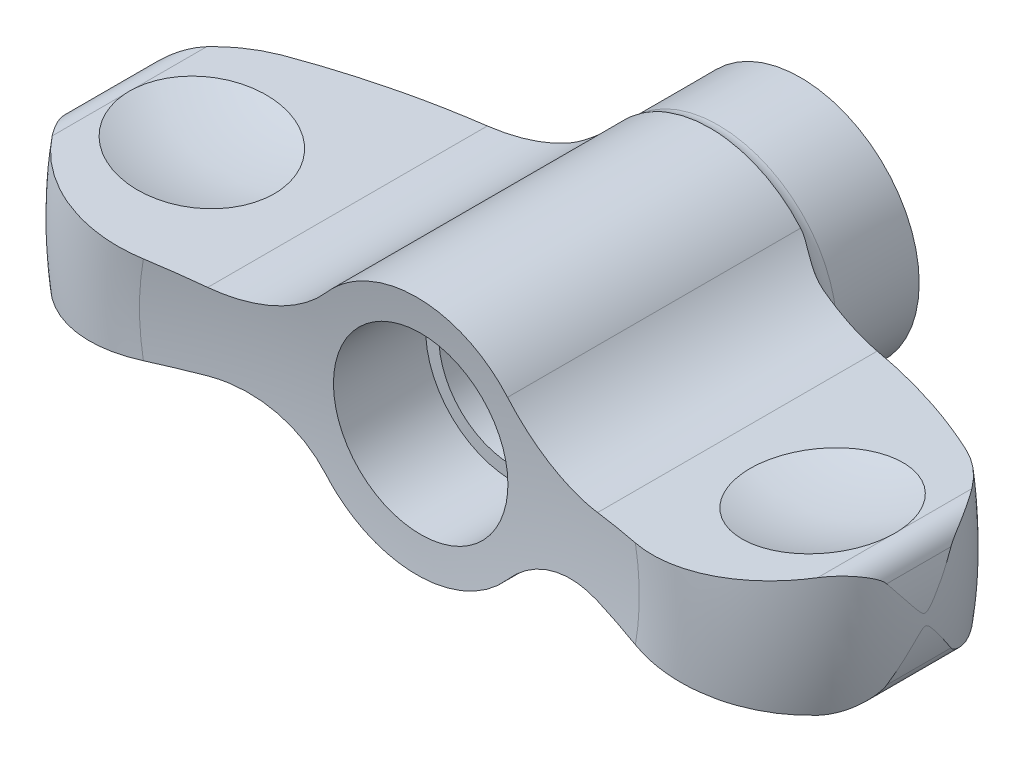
ISO-10303-21;
HEADER;
FILE_DESCRIPTION(('STEP AP214'),'2;1');
FILE_NAME('part.step','',(''),(''),'','','');
FILE_SCHEMA(('AUTOMOTIVE_DESIGN { 1 0 10303 214 1 1 1 1 }'));
ENDSEC;
DATA;
#1=APPLICATION_CONTEXT('core data for automotive mechanical design processes');
#2=APPLICATION_PROTOCOL_DEFINITION('international standard','automotive_design',2000,#1);
#3=PRODUCT_CONTEXT('',#1,'mechanical');
#4=PRODUCT('Part','Part','',(#3));
#5=PRODUCT_RELATED_PRODUCT_CATEGORY('part','',(#4));
#6=PRODUCT_DEFINITION_FORMATION('','',#4);
#7=PRODUCT_DEFINITION_CONTEXT('part definition',#1,'design');
#8=PRODUCT_DEFINITION('design','',#6,#7);
#9=PRODUCT_DEFINITION_SHAPE('','',#8);
#10=(LENGTH_UNIT() NAMED_UNIT(*) SI_UNIT(.MILLI.,.METRE.));
#11=(NAMED_UNIT(*) PLANE_ANGLE_UNIT() SI_UNIT($,.RADIAN.));
#12=(NAMED_UNIT(*) SI_UNIT($,.STERADIAN.) SOLID_ANGLE_UNIT());
#13=UNCERTAINTY_MEASURE_WITH_UNIT(LENGTH_MEASURE(1.E-05),#10,'distance_accuracy_value','');
#14=(GEOMETRIC_REPRESENTATION_CONTEXT(3) GLOBAL_UNCERTAINTY_ASSIGNED_CONTEXT((#13)) GLOBAL_UNIT_ASSIGNED_CONTEXT((#10,
#11,#12)) REPRESENTATION_CONTEXT('',''));
#15=CARTESIAN_POINT('',(0.,0.,0.));
#16=DIRECTION('',(0.,0.,1.));
#17=DIRECTION('',(1.,0.,0.));
#18=AXIS2_PLACEMENT_3D('',#15,#16,#17);
#19=CARTESIAN_POINT('',(21.9043592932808,2.11823444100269,23.6684432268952));
#20=DIRECTION('',(0.,0.,-1.));
#21=DIRECTION('',(0.,1.,0.));
#22=AXIS2_PLACEMENT_3D('',#19,#20,#21);
#23=CYLINDRICAL_SURFACE('',#22,1.28);
#24=CARTESIAN_POINT('',(21.7601497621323,3.39008490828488,16.6812339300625));
#25=CARTESIAN_POINT('',(21.7613341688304,3.39008490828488,16.6578177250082));
#26=CARTESIAN_POINT('',(21.762370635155,3.39008490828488,16.634394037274));
#27=CARTESIAN_POINT('',(21.7641475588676,3.39008490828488,16.5875354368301));
#28=CARTESIAN_POINT('',(21.7648880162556,3.39008490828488,16.5641005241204));
#29=CARTESIAN_POINT('',(21.7660727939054,3.39008490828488,16.5172232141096));
#30=CARTESIAN_POINT('',(21.7665171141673,3.39008490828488,16.4937808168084));
#31=CARTESIAN_POINT('',(21.7671095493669,3.39008490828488,16.4468922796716));
#32=CARTESIAN_POINT('',(21.7672576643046,3.39008490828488,16.4234461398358));
#33=CARTESIAN_POINT('',(21.7672576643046,3.39008490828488,16.3765538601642));
#34=CARTESIAN_POINT('',(21.7671095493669,3.39008490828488,16.3531077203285));
#35=CARTESIAN_POINT('',(21.7665171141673,3.39008490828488,16.3062191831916));
#36=CARTESIAN_POINT('',(21.7660727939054,3.39008490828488,16.2827767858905));
#37=CARTESIAN_POINT('',(21.7648880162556,3.39008490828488,16.2358994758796));
#38=CARTESIAN_POINT('',(21.7641475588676,3.39008490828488,16.2124645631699));
#39=CARTESIAN_POINT('',(21.762370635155,3.39008490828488,16.165605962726));
#40=CARTESIAN_POINT('',(21.7613341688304,3.39008490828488,16.1421822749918));
#41=CARTESIAN_POINT('',(21.7601497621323,3.39008490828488,16.1187660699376));
#42=B_SPLINE_CURVE_WITH_KNOTS('',3,(#24,#25,#26,#27,#28,#29,#30,#31,#32,#33,#34,#35,#36,#37,#38,
#39,#40,#41),.UNSPECIFIED.,.F.,.F.,(4,2,2,2,2,2,2,2,4),(0.,0.0703379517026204,0.140675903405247,
0.211013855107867,0.281351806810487,0.351689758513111,0.42202771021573,0.492365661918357,
0.562703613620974),.UNSPECIFIED.);
#43=CARTESIAN_POINT('',(21.7601497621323,3.39008490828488,16.6812339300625));
#44=VERTEX_POINT('',#43);
#45=CARTESIAN_POINT('',(21.7601497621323,3.39008490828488,16.1187660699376));
#46=VERTEX_POINT('',#45);
#47=EDGE_CURVE('E30',#44,#46,#42,.T.);
#48=ORIENTED_EDGE('',*,*,#47,.F.);
#49=DIRECTION('',(0.,0.,-1.));
#50=VECTOR('',#49,1.);
#51=CARTESIAN_POINT('',(21.7601497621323,3.39008490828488,23.6684432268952));
#52=LINE('',#51,#50);
#53=CARTESIAN_POINT('',(21.7601497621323,3.39008490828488,20.7904148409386));
#54=VERTEX_POINT('',#53);
#55=EDGE_CURVE('E194',#54,#44,#52,.T.);
#56=ORIENTED_EDGE('',*,*,#55,.F.);
#57=CARTESIAN_POINT('',(21.7599497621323,3.39006221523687,20.790680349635));
#58=CARTESIAN_POINT('',(21.8202217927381,3.39686098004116,20.710694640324));
#59=CARTESIAN_POINT('',(21.8793667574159,3.39928639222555,20.62959208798));
#60=CARTESIAN_POINT('',(21.9949351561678,3.39634226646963,20.4657536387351));
#61=CARTESIAN_POINT('',(22.0513620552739,3.39098293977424,20.383020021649));
#62=CARTESIAN_POINT('',(22.1621234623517,3.37328427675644,20.2148859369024));
#63=CARTESIAN_POINT('',(22.2164058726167,3.36082745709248,20.129464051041));
#64=CARTESIAN_POINT('',(22.3216406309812,3.32955275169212,19.9576992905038));
#65=CARTESIAN_POINT('',(22.3725915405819,3.31073213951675,19.8713560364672));
#66=CARTESIAN_POINT('',(22.4746686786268,3.26561871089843,19.691692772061));
#67=CARTESIAN_POINT('',(22.5255243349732,3.2388731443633,19.5983328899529));
#68=CARTESIAN_POINT('',(22.6230922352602,3.17894243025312,19.4115230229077));
#69=CARTESIAN_POINT('',(22.6698044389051,3.14575722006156,19.3180730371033));
#70=CARTESIAN_POINT('',(22.7585702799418,3.07321365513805,19.1326663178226));
#71=CARTESIAN_POINT('',(22.8006673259,3.03392311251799,19.0407041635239));
#72=CARTESIAN_POINT('',(22.8606867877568,2.9695240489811,18.9039569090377));
#73=CARTESIAN_POINT('',(22.8801760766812,2.94714180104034,18.858564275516));
#74=CARTESIAN_POINT('',(22.9181003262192,2.90030805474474,18.7684107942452));
#75=CARTESIAN_POINT('',(22.936535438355,2.87585685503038,18.7236498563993));
#76=CARTESIAN_POINT('',(22.9709673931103,2.82646001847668,18.6384771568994));
#77=CARTESIAN_POINT('',(22.9870429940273,2.80169398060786,18.5979938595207));
#78=CARTESIAN_POINT('',(23.0182038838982,2.74963742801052,18.5184180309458));
#79=CARTESIAN_POINT('',(23.0332912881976,2.72235262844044,18.479322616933));
#80=CARTESIAN_POINT('',(23.0625451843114,2.66419969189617,18.4029447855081));
#81=CARTESIAN_POINT('',(23.0767041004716,2.63330671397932,18.3656777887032));
#82=CARTESIAN_POINT('',(23.0970181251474,2.58330430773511,18.3126032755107));
#83=CARTESIAN_POINT('',(23.1036552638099,2.56596456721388,18.2953317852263));
#84=CARTESIAN_POINT('',(23.1165453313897,2.52977988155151,18.2622010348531));
#85=CARTESIAN_POINT('',(23.1227972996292,2.51093142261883,18.2463452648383));
#86=CARTESIAN_POINT('',(23.1288118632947,2.4912168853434,18.2314500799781));
#87=B_SPLINE_CURVE_WITH_KNOTS('',3,(#57,#58,#59,#60,#61,#62,#63,#64,#65,#66,#67,#68,#69,#70,#71,
#72,#73,#74,#75,#76,#77,#78,#79,#80,#81,#82,#83,#84,#85,#86),.UNSPECIFIED.,.F.,.F.,(4,2,2,2,2,2,
2,2,2,2,2,2,2,2,4),(0.,0.300919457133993,0.601444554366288,0.907095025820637,1.21287661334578,
1.54147366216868,1.87007390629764,2.19525564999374,2.35791585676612,2.52055262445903,
2.67079845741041,2.8207113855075,2.97172510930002,3.04772278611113,3.12390292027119),.UNSPECIFIED.);
#88=CARTESIAN_POINT('',(23.1287509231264,2.4914168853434,18.2316008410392));
#89=VERTEX_POINT('',#88);
#90=EDGE_CURVE('E349',#54,#89,#87,.T.);
#91=ORIENTED_EDGE('',*,*,#90,.T.);
#92=DIRECTION('',(0.,0.,-1.));
#93=VECTOR('',#92,1.);
#94=CARTESIAN_POINT('',(23.1287509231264,2.4914168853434,23.6684432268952));
#95=LINE('',#94,#93);
#96=CARTESIAN_POINT('',(23.1287509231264,2.4914168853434,14.5780128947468));
#97=VERTEX_POINT('',#96);
#98=EDGE_CURVE('E204',#89,#97,#95,.T.);
#99=ORIENTED_EDGE('',*,*,#98,.T.);
#100=CARTESIAN_POINT('',(23.1288118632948,2.49121688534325,14.5781636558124));
#101=CARTESIAN_POINT('',(23.1234107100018,2.5089280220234,14.564791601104));
#102=CARTESIAN_POINT('',(23.1178156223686,2.52593874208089,14.5506334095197));
#103=CARTESIAN_POINT('',(23.1063058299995,2.55872173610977,14.5211276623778));
#104=CARTESIAN_POINT('',(23.1003917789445,2.57449639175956,14.5057825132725));
#105=CARTESIAN_POINT('',(23.0823110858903,2.62012925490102,14.4586395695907));
#106=CARTESIAN_POINT('',(23.0697411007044,2.64849974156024,14.425568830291));
#107=CARTESIAN_POINT('',(23.0438225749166,2.70210073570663,14.3577317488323));
#108=CARTESIAN_POINT('',(23.0304800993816,2.72735183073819,14.3229788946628));
#109=CARTESIAN_POINT('',(23.0029814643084,2.77565512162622,14.2521845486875));
#110=CARTESIAN_POINT('',(22.9888237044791,2.79870273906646,14.2161405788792));
#111=CARTESIAN_POINT('',(22.9558590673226,2.84890324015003,14.1334763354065));
#112=CARTESIAN_POINT('',(22.9368234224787,2.87550003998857,14.0866114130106));
#113=CARTESIAN_POINT('',(22.8975751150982,2.92628693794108,13.992075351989));
#114=CARTESIAN_POINT('',(22.8773621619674,2.95047643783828,13.9444040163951));
#115=CARTESIAN_POINT('',(22.8149796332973,3.01993193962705,13.8006383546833));
#116=CARTESIAN_POINT('',(22.7710641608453,3.06208823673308,13.7037867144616));
#117=CARTESIAN_POINT('',(22.6781039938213,3.13971150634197,13.5082734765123));
#118=CARTESIAN_POINT('',(22.6290034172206,3.17509089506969,13.4096041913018));
#119=CARTESIAN_POINT('',(22.5261795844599,3.23867759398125,13.2123520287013));
#120=CARTESIAN_POINT('',(22.472456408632,3.26688502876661,13.11376914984));
#121=CARTESIAN_POINT('',(22.367542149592,3.3126846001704,12.9296202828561));
#122=CARTESIAN_POINT('',(22.3168796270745,3.33116474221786,12.8439735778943));
#123=CARTESIAN_POINT('',(22.2122763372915,3.36184031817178,12.6735944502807));
#124=CARTESIAN_POINT('',(22.1583368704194,3.37403822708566,12.5888616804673));
#125=CARTESIAN_POINT('',(22.0484511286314,3.39129239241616,12.4222979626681));
#126=CARTESIAN_POINT('',(21.9925637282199,3.39648202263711,12.3404425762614));
#127=CARTESIAN_POINT('',(21.8781371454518,3.39923638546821,12.1783363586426));
#128=CARTESIAN_POINT('',(21.8195947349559,3.39679157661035,12.0980876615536));
#129=CARTESIAN_POINT('',(21.7599497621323,3.3900622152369,12.0189333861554));
#130=B_SPLINE_CURVE_WITH_KNOTS('',3,(#100,#101,#102,#103,#104,#105,#106,#107,#108,#109,#110,
#111,#112,#113,#114,#115,#116,#117,#118,#119,#120,#121,#122,#123,#124,#125,#126,#127,#128,#129),
.UNSPECIFIED.,.F.,.F.,(4,2,2,2,2,2,2,2,2,2,2,2,2,2,4),(0.,0.0684406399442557,0.136745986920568,
0.272552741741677,0.407408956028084,0.542539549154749,0.713900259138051,0.885303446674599,
1.22808914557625,1.57504347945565,1.92199178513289,2.22539222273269,2.52867303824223,
2.82609673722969,3.12389230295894),.UNSPECIFIED.);
#131=CARTESIAN_POINT('',(21.7601497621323,3.39008490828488,12.0191988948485));
#132=VERTEX_POINT('',#131);
#133=EDGE_CURVE('E363',#97,#132,#130,.T.);
#134=ORIENTED_EDGE('',*,*,#133,.T.);
#135=EDGE_CURVE('E197',#46,#132,#52,.T.);
#136=ORIENTED_EDGE('',*,*,#135,.F.);
#137=EDGE_LOOP('',(#48,#56,#91,#99,#134,#136));
#138=FACE_BOUND('',#137,.T.);
#139=ADVANCED_FACE('F14',(#138),#23,.T.);
#140=CARTESIAN_POINT('',(11.086877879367,2.1798895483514,23.6684432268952));
#141=DIRECTION('',(0.112663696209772,-0.993633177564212,0.));
#142=DIRECTION('',(0.993633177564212,0.112663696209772,0.));
#143=AXIS2_PLACEMENT_3D('',#140,#141,#142);
#144=PLANE('',#143);
#145=CARTESIAN_POINT('',(17.6500647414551,2.92406044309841,16.4));
#146=DIRECTION('',(0.112663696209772,-0.993633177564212,0.));
#147=DIRECTION('',(0.993633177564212,0.112663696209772,0.));
#148=AXIS2_PLACEMENT_3D('',#145,#146,#147);
#149=CIRCLE('',#148,4.1459703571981);
#150=EDGE_CURVE('E9',#46,#44,#149,.F.);
#151=ORIENTED_EDGE('',*,*,#150,.F.);
#152=ORIENTED_EDGE('',*,*,#135,.T.);
#153=CARTESIAN_POINT('',(21.7603497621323,3.39010758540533,12.0194644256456));
#154=CARTESIAN_POINT('',(21.6366957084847,3.3760869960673,11.8552472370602));
#155=CARTESIAN_POINT('',(21.5060612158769,3.36127492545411,11.6963537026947));
#156=CARTESIAN_POINT('',(21.2317862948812,3.33017609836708,11.3902157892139));
#157=CARTESIAN_POINT('',(21.0881387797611,3.31388853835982,11.2429778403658));
#158=CARTESIAN_POINT('',(20.791528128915,3.28025716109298,10.9637803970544));
#159=CARTESIAN_POINT('',(20.6387700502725,3.2629365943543,10.8316000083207));
#160=CARTESIAN_POINT('',(20.3229009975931,3.22712159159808,10.5806104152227));
#161=CARTESIAN_POINT('',(20.1597969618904,3.20862794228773,10.4617923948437));
#162=CARTESIAN_POINT('',(19.9084688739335,3.18013095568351,10.2943374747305));
#163=CARTESIAN_POINT('',(19.8237007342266,3.17051946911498,10.2403806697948));
#164=CARTESIAN_POINT('',(19.6516287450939,3.15100898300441,10.1358350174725));
#165=CARTESIAN_POINT('',(19.5643153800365,3.14110890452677,10.0852620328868));
#166=CARTESIAN_POINT('',(19.4759790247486,3.13109283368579,10.0365423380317));
#167=B_SPLINE_CURVE_WITH_KNOTS('',3,(#153,#154,#155,#156,#157,#158,#159,#160,#161,#162,#163,
#164,#165,#166),.UNSPECIFIED.,.F.,.F.,(4,2,2,2,2,2,4),(0.,0.617949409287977,1.23623739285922,
1.84378986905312,2.45093912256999,2.75369070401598,3.05777432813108),.UNSPECIFIED.);
#168=CARTESIAN_POINT('',(19.4763416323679,3.13113394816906,10.0367423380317));
#169=VERTEX_POINT('',#168);
#170=EDGE_CURVE('E370',#132,#169,#167,.T.);
#171=ORIENTED_EDGE('',*,*,#170,.T.);
#172=CARTESIAN_POINT('',(19.4767196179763,3.13117680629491,10.0369423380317));
#173=CARTESIAN_POINT('',(18.8096891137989,3.05554515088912,9.68397399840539));
#174=CARTESIAN_POINT('',(18.132930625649,2.97881048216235,9.34963221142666));
#175=CARTESIAN_POINT('',(16.7641609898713,2.8236117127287,8.72009810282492));
#176=CARTESIAN_POINT('',(16.0722025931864,2.74515359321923,8.42478961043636));
#177=CARTESIAN_POINT('',(14.6731463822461,2.58652076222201,7.87305677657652));
#178=CARTESIAN_POINT('',(13.9660485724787,2.50634605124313,7.6166324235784));
#179=CARTESIAN_POINT('',(12.5366977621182,2.34427824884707,7.14269238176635));
#180=CARTESIAN_POINT('',(11.8144050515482,2.26238065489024,6.92529799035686));
#181=CARTESIAN_POINT('',(11.086677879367,2.17986687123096,6.72821803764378));
#182=B_SPLINE_CURVE_WITH_KNOTS('',3,(#172,#173,#174,#175,#176,#177,#178,#179,#180,#181),
.UNSPECIFIED.,.F.,.F.,(4,2,2,2,4),(0.,2.27503526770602,4.54313933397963,6.81124272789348,
9.08627731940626),.UNSPECIFIED.);
#183=CARTESIAN_POINT('',(11.086877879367,2.1798895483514,6.72827220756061));
#184=VERTEX_POINT('',#183);
#185=EDGE_CURVE('E462',#169,#184,#182,.T.);
#186=ORIENTED_EDGE('',*,*,#185,.T.);
#187=DIRECTION('',(0.,0.,-1.));
#188=VECTOR('',#187,1.);
#189=CARTESIAN_POINT('',(11.086877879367,2.1798895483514,23.6684432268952));
#190=LINE('',#189,#188);
#191=CARTESIAN_POINT('',(11.086877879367,2.1798895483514,22.6295401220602));
#192=VERTEX_POINT('',#191);
#193=EDGE_CURVE('E209',#192,#184,#190,.T.);
#194=ORIENTED_EDGE('',*,*,#193,.F.);
#195=CARTESIAN_POINT('',(11.0866778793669,2.17986687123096,22.6294945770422));
#196=CARTESIAN_POINT('',(11.5738065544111,2.23510024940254,22.7404282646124));
#197=CARTESIAN_POINT('',(12.0590951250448,2.29012498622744,22.8585521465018));
#198=CARTESIAN_POINT('',(13.0259920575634,2.39975717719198,23.1091802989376));
#199=CARTESIAN_POINT('',(13.5076004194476,2.45436463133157,23.2416845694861));
#200=CARTESIAN_POINT('',(13.9873686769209,2.5087634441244,23.3813790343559));
#201=B_SPLINE_CURVE_WITH_KNOTS('',3,(#195,#196,#197,#198,#199,#200),.UNSPECIFIED.,.F.,.F.,(4,2,
4),(0.,1.50743946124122,3.01487892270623),.UNSPECIFIED.);
#202=CARTESIAN_POINT('',(13.98668179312,2.508685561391,23.3811790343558));
#203=VERTEX_POINT('',#202);
#204=EDGE_CURVE('E668',#192,#203,#201,.T.);
#205=ORIENTED_EDGE('',*,*,#204,.T.);
#206=CARTESIAN_POINT('',(11.0866778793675,2.17986687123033,21.7359612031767));
#207=CARTESIAN_POINT('',(11.2365206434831,2.1968568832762,21.8750845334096));
#208=CARTESIAN_POINT('',(11.3922244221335,2.21451144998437,22.0078072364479));
#209=CARTESIAN_POINT('',(11.71417499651,2.25101600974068,22.2595816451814));
#210=CARTESIAN_POINT('',(11.8804212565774,2.26986594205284,22.3786340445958));
#211=CARTESIAN_POINT('',(12.2221615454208,2.30861437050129,22.6021262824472));
#212=CARTESIAN_POINT('',(12.3976483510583,2.32851204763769,22.7065773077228));
#213=CARTESIAN_POINT('',(12.756733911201,2.36922718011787,22.9002398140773));
#214=CARTESIAN_POINT('',(12.9403325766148,2.39004462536,22.9894514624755));
#215=CARTESIAN_POINT('',(13.314394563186,2.43245786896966,23.1520244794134));
#216=CARTESIAN_POINT('',(13.5048598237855,2.45405388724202,23.2253813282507));
#217=CARTESIAN_POINT('',(13.8913243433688,2.49787339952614,23.3557135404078));
#218=CARTESIAN_POINT('',(14.0873256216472,2.52009712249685,23.4126828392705));
#219=CARTESIAN_POINT('',(14.4833023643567,2.56499518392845,23.5097702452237));
#220=CARTESIAN_POINT('',(14.6832757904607,2.58766929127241,23.5498967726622));
#221=CARTESIAN_POINT('',(15.0859465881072,2.63332636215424,23.613061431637));
#222=CARTESIAN_POINT('',(15.2886449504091,2.65630943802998,23.6360931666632));
#223=CARTESIAN_POINT('',(15.695143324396,2.70240050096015,23.6648663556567));
#224=CARTESIAN_POINT('',(15.8989427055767,2.72550841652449,23.6706168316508));
#225=CARTESIAN_POINT('',(16.3063903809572,2.77170711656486,23.6648046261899));
#226=CARTESIAN_POINT('',(16.5100385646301,2.79479788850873,23.6532340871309));
#227=CARTESIAN_POINT('',(16.9156444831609,2.84078775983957,23.6128409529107));
#228=CARTESIAN_POINT('',(17.1176021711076,2.8636868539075,23.5840178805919));
#229=CARTESIAN_POINT('',(17.5182883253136,2.90911889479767,23.5093355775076));
#230=CARTESIAN_POINT('',(17.7170182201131,2.93165200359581,23.463484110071));
#231=CARTESIAN_POINT('',(18.1097488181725,2.97618199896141,23.3551128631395));
#232=CARTESIAN_POINT('',(18.303753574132,2.99817934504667,23.2926079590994));
#233=CARTESIAN_POINT('',(18.685760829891,3.04149346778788,23.1513774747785));
#234=CARTESIAN_POINT('',(18.8737655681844,3.06281049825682,23.0726580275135));
#235=CARTESIAN_POINT('',(19.2425766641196,3.10462836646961,22.899507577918));
#236=CARTESIAN_POINT('',(19.4233802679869,3.12512889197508,22.8050706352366));
#237=CARTESIAN_POINT('',(19.7763548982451,3.16515113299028,22.6012126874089));
#238=CARTESIAN_POINT('',(19.9485293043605,3.1846732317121,22.4917976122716));
#239=CARTESIAN_POINT('',(20.2724672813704,3.2214031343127,22.2661336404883));
#240=CARTESIAN_POINT('',(20.4248327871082,3.23867918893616,22.1507584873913));
#241=CARTESIAN_POINT('',(20.7200183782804,3.27214898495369,21.9082489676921));
#242=CARTESIAN_POINT('',(20.8628389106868,3.28834277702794,21.7811151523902));
#243=CARTESIAN_POINT('',(21.1380772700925,3.31955084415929,21.5158381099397));
#244=CARTESIAN_POINT('',(21.2704921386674,3.33456478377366,21.3776917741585));
#245=CARTESIAN_POINT('',(21.5240692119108,3.36331677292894,21.091284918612));
#246=CARTESIAN_POINT('',(21.645230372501,3.37705470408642,20.9430234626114));
#247=CARTESIAN_POINT('',(21.7603497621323,3.39010758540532,20.7901493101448));
#248=B_SPLINE_CURVE_WITH_KNOTS('',3,(#206,#207,#208,#209,#210,#211,#212,#213,#214,#215,#216,
#217,#218,#219,#220,#221,#222,#223,#224,#225,#226,#227,#228,#229,#230,#231,#232,#233,#234,#235,
#236,#237,#238,#239,#240,#241,#242,#243,#244,#245,#246,#247),.UNSPECIFIED.,.F.,.F.,(4,2,2,2,2,2,
2,2,2,2,2,2,2,2,2,2,2,2,2,2,4),(0.,0.615336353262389,1.23064146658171,1.8454725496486,
2.46029688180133,3.07529625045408,3.69052291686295,4.30544164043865,4.92059033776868,
5.5354178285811,6.15052431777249,6.76564781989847,7.3804912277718,7.99478726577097,
8.60885137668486,9.22314809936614,9.83720231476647,10.4123053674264,10.9873814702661,
11.5626204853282,12.1379128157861),.UNSPECIFIED.);
#249=EDGE_CURVE('E203',#203,#54,#248,.T.);
#250=ORIENTED_EDGE('',*,*,#249,.T.);
#251=ORIENTED_EDGE('',*,*,#55,.T.);
#252=EDGE_LOOP('',(#151,#152,#171,#186,#194,#205,#250,#251));
#253=FACE_BOUND('',#252,.T.);
#254=ADVANCED_FACE('F201',(#253),#144,.F.);
#255=CARTESIAN_POINT('',(-11.0868778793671,2.1798895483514,23.6684432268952));
#256=DIRECTION('',(-0.112663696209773,-0.993633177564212,0.));
#257=DIRECTION('',(0.993633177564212,-0.112663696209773,0.));
#258=AXIS2_PLACEMENT_3D('',#255,#256,#257);
#259=PLANE('',#258);
#260=CARTESIAN_POINT('',(-17.6500647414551,2.92406044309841,16.4));
#261=DIRECTION('',(-0.112663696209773,-0.993633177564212,0.));
#262=DIRECTION('',(0.993633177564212,-0.112663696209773,0.));
#263=AXIS2_PLACEMENT_3D('',#260,#261,#262);
#264=CIRCLE('',#263,4.14597035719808);
#265=CARTESIAN_POINT('',(-21.7601497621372,3.39008490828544,16.6812339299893));
#266=VERTEX_POINT('',#265);
#267=CARTESIAN_POINT('',(-21.7601497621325,3.39008490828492,16.1187660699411));
#268=VERTEX_POINT('',#267);
#269=EDGE_CURVE('E38',#266,#268,#264,.F.);
#270=ORIENTED_EDGE('',*,*,#269,.F.);
#271=DIRECTION('',(0.,0.,-1.));
#272=VECTOR('',#271,1.);
#273=CARTESIAN_POINT('',(-21.7601497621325,3.39008490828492,23.6684432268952));
#274=LINE('',#273,#272);
#275=CARTESIAN_POINT('',(-21.7601497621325,3.39008490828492,20.7988674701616));
#276=VERTEX_POINT('',#275);
#277=EDGE_CURVE('E430',#276,#266,#274,.T.);
#278=ORIENTED_EDGE('',*,*,#277,.F.);
#279=CARTESIAN_POINT('',(-21.7603497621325,3.39010758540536,20.7986027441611));
#280=CARTESIAN_POINT('',(-21.6374229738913,3.3761694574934,20.9613565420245));
#281=CARTESIAN_POINT('',(-21.507636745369,3.36145356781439,21.1188572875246));
#282=CARTESIAN_POINT('',(-21.2353512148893,3.33058030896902,21.4222902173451));
#283=CARTESIAN_POINT('',(-21.0928525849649,3.31442301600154,21.5682230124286));
#284=CARTESIAN_POINT('',(-20.7962593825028,3.28079361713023,21.8473578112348));
#285=CARTESIAN_POINT('',(-20.6421746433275,3.26332262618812,21.9805703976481));
#286=CARTESIAN_POINT('',(-20.3234087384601,3.22717916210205,22.2334631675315));
#287=CARTESIAN_POINT('',(-20.1587276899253,3.20850670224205,22.3531435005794));
#288=CARTESIAN_POINT('',(-19.8198924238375,3.17008766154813,22.5781565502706));
#289=CARTESIAN_POINT('',(-19.6457356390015,3.15034078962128,22.6834853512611));
#290=CARTESIAN_POINT('',(-19.2891637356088,3.10991066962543,22.879049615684));
#291=CARTESIAN_POINT('',(-19.1067455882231,3.08922707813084,22.9692794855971));
#292=CARTESIAN_POINT('',(-18.7350993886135,3.04708774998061,23.1339222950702));
#293=CARTESIAN_POINT('',(-18.5458746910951,3.02563239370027,23.2083429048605));
#294=CARTESIAN_POINT('',(-18.1618036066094,2.98208426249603,23.3409251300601));
#295=CARTESIAN_POINT('',(-17.9669551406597,2.95999125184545,23.3990806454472));
#296=CARTESIAN_POINT('',(-17.5730016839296,2.91532260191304,23.4987107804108));
#297=CARTESIAN_POINT('',(-17.3738948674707,2.89274675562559,23.5401780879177));
#298=CARTESIAN_POINT('',(-16.9728300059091,2.84727177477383,23.606122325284));
#299=CARTESIAN_POINT('',(-16.770870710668,2.82437249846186,23.6305915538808));
#300=CARTESIAN_POINT('',(-16.3656161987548,2.77842247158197,23.6623425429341));
#301=CARTESIAN_POINT('',(-16.1623209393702,2.75537171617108,23.6696237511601));
#302=CARTESIAN_POINT('',(-15.7559342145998,2.70929331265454,23.6669524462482));
#303=CARTESIAN_POINT('',(-15.5528426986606,2.68626565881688,23.6570076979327));
#304=CARTESIAN_POINT('',(-15.1478467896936,2.64034495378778,23.6199427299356));
#305=CARTESIAN_POINT('',(-14.9459451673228,2.61745221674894,23.5927918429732));
#306=CARTESIAN_POINT('',(-14.5452037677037,2.57201391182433,23.5214978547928));
#307=CARTESIAN_POINT('',(-14.3463628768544,2.54946821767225,23.4773610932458));
#308=CARTESIAN_POINT('',(-13.9529949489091,2.50486595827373,23.3723913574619));
#309=CARTESIAN_POINT('',(-13.7584697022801,2.48280959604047,23.3115515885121));
#310=CARTESIAN_POINT('',(-13.3752664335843,2.43935986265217,23.1736435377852));
#311=CARTESIAN_POINT('',(-13.1865861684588,2.41796623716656,23.0965815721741));
#312=CARTESIAN_POINT('',(-12.8263684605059,2.37712273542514,22.9313679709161));
#313=CARTESIAN_POINT('',(-12.6544560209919,2.35763033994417,22.8440430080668));
#314=CARTESIAN_POINT('',(-12.3180805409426,2.31949020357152,22.6559120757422));
#315=CARTESIAN_POINT('',(-12.1536172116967,2.30084242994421,22.5551066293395));
#316=CARTESIAN_POINT('',(-11.8331357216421,2.26450444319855,22.3406146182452));
#317=CARTESIAN_POINT('',(-11.6771200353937,2.24681451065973,22.2269243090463));
#318=CARTESIAN_POINT('',(-11.3745520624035,2.21250765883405,21.9874094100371));
#319=CARTESIAN_POINT('',(-11.2280005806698,2.19589083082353,21.861583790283));
#320=CARTESIAN_POINT('',(-11.0866778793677,2.17986687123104,21.7300618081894));
#321=B_SPLINE_CURVE_WITH_KNOTS('',3,(#279,#280,#281,#282,#283,#284,#285,#286,#287,#288,#289,
#290,#291,#292,#293,#294,#295,#296,#297,#298,#299,#300,#301,#302,#303,#304,#305,#306,#307,#308,
#309,#310,#311,#312,#313,#314,#315,#316,#317,#318,#319,#320),.UNSPECIFIED.,.F.,.F.,(4,2,2,2,2,2,
2,2,2,2,2,2,2,2,2,2,2,2,2,2,4),(0.,0.613119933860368,1.22620747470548,1.83878042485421,
2.45134660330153,3.06407958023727,3.67703904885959,4.28970044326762,4.90259130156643,
5.51575041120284,6.12918714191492,6.74264358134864,7.3558235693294,7.97009954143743,
8.58414646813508,9.19844355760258,9.81250190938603,10.3933025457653,10.9740806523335,
11.5550279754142,12.1360246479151),.UNSPECIFIED.);
#322=CARTESIAN_POINT('',(-13.9930416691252,2.5094066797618,23.3811790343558));
#323=VERTEX_POINT('',#322);
#324=EDGE_CURVE('E334',#276,#323,#321,.T.);
#325=ORIENTED_EDGE('',*,*,#324,.T.);
#326=CARTESIAN_POINT('',(-13.9937285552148,2.50948456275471,23.3813790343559));
#327=CARTESIAN_POINT('',(-13.5129154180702,2.45496727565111,23.2413808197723));
#328=CARTESIAN_POINT('',(-13.0302546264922,2.40024049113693,23.1086042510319));
#329=CARTESIAN_POINT('',(-12.0612377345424,2.29036792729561,22.8574944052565));
#330=CARTESIAN_POINT('',(-11.5748816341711,2.23522214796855,22.7391611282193));
#331=CARTESIAN_POINT('',(-11.0866778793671,2.17986687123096,22.6280494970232));
#332=B_SPLINE_CURVE_WITH_KNOTS('',3,(#326,#327,#328,#329,#330,#331),.UNSPECIFIED.,.F.,.F.,(4,2,
4),(0.,1.5107199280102,3.02143985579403),.UNSPECIFIED.);
#333=CARTESIAN_POINT('',(-11.0868778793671,2.1798895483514,22.6280950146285));
#334=VERTEX_POINT('',#333);
#335=EDGE_CURVE('E765',#323,#334,#332,.T.);
#336=ORIENTED_EDGE('',*,*,#335,.T.);
#337=DIRECTION('',(0.,0.,-1.));
#338=VECTOR('',#337,1.);
#339=CARTESIAN_POINT('',(-11.0868778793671,2.1798895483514,23.6684432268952));
#340=LINE('',#339,#338);
#341=CARTESIAN_POINT('',(-11.0868778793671,2.1798895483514,6.72655347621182));
#342=VERTEX_POINT('',#341);
#343=EDGE_CURVE('E436',#334,#342,#340,.T.);
#344=ORIENTED_EDGE('',*,*,#343,.T.);
#345=CARTESIAN_POINT('',(-11.0866778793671,2.17986687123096,6.72649934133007));
#346=CARTESIAN_POINT('',(-11.8149701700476,2.26244473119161,6.92360472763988));
#347=CARTESIAN_POINT('',(-12.5378232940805,2.34440586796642,7.14105527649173));
#348=CARTESIAN_POINT('',(-13.968275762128,2.50659858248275,7.61516636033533));
#349=CARTESIAN_POINT('',(-14.6759149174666,2.58683467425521,7.87170523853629));
#350=CARTESIAN_POINT('',(-16.0760348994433,2.74558812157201,8.42372506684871));
#351=CARTESIAN_POINT('',(-16.768515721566,2.82410547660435,8.71920602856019));
#352=CARTESIAN_POINT('',(-18.138311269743,2.97942056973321,9.34914311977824));
#353=CARTESIAN_POINT('',(-18.8155730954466,3.05621230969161,9.68371576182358));
#354=CARTESIAN_POINT('',(-19.4830926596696,3.13189941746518,10.0369423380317));
#355=B_SPLINE_CURVE_WITH_KNOTS('',3,(#345,#346,#347,#348,#349,#350,#351,#352,#353,#354),
.UNSPECIFIED.,.F.,.F.,(4,2,2,2,4),(0.,2.27670140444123,4.54645642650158,6.81621212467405,
9.09291420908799),.UNSPECIFIED.);
#356=CARTESIAN_POINT('',(-19.4827146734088,3.13185655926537,10.0367423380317));
#357=VERTEX_POINT('',#356);
#358=EDGE_CURVE('E763',#342,#357,#355,.T.);
#359=ORIENTED_EDGE('',*,*,#358,.T.);
#360=CARTESIAN_POINT('',(-19.4823520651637,3.13181544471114,10.0365423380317));
#361=CARTESIAN_POINT('',(-19.6618976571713,3.15217332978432,10.1355384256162));
#362=CARTESIAN_POINT('',(-19.8372412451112,3.17205476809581,10.2422555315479));
#363=CARTESIAN_POINT('',(-20.1783985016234,3.21073708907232,10.47033784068));
#364=CARTESIAN_POINT('',(-20.3442067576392,3.22953735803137,10.5917112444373));
#365=CARTESIAN_POINT('',(-20.6621860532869,3.26559163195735,10.8459785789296));
#366=CARTESIAN_POINT('',(-20.8145435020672,3.28286677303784,10.9786366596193));
#367=CARTESIAN_POINT('',(-21.1076328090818,3.31609888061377,11.2562263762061));
#368=CARTESIAN_POINT('',(-21.2483723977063,3.33205672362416,11.4011497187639));
#369=CARTESIAN_POINT('',(-21.4486943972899,3.354770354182,11.6254524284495));
#370=CARTESIAN_POINT('',(-21.5130563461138,3.36206807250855,11.7005590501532));
#371=CARTESIAN_POINT('',(-21.6389421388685,3.3763417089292,11.8536901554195));
#372=CARTESIAN_POINT('',(-21.7004525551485,3.38331610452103,11.9317258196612));
#373=CARTESIAN_POINT('',(-21.7603497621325,3.39010758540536,12.0110109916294));
#374=B_SPLINE_CURVE_WITH_KNOTS('',3,(#360,#361,#362,#363,#364,#365,#366,#367,#368,#369,#370,
#371,#372,#373),.UNSPECIFIED.,.F.,.F.,(4,2,2,2,2,2,4),(0.,0.617930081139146,1.23620752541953,
1.8437801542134,2.45094519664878,2.7484146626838,3.04716620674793),.UNSPECIFIED.);
#375=CARTESIAN_POINT('',(-21.7601497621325,3.39008490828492,12.0107462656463));
#376=VERTEX_POINT('',#375);
#377=EDGE_CURVE('E401',#357,#376,#374,.T.);
#378=ORIENTED_EDGE('',*,*,#377,.T.);
#379=EDGE_CURVE('E423',#268,#376,#274,.T.);
#380=ORIENTED_EDGE('',*,*,#379,.F.);
#381=EDGE_LOOP('',(#270,#278,#325,#336,#344,#359,#378,#380));
#382=FACE_BOUND('',#381,.T.);
#383=ADVANCED_FACE('F409',(#382),#259,.F.);
#384=CARTESIAN_POINT('',(-21.9043592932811,2.11823444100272,23.6684432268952));
#385=DIRECTION('',(0.,0.,-1.));
#386=DIRECTION('',(0.,1.,0.));
#387=AXIS2_PLACEMENT_3D('',#384,#385,#386);
#388=CYLINDRICAL_SURFACE('',#387,1.28);
#389=CARTESIAN_POINT('',(-21.7601497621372,3.39008490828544,16.6812339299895));
#390=CARTESIAN_POINT('',(-21.7617323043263,3.3902641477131,16.6578101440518));
#391=CARTESIAN_POINT('',(-21.7631181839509,3.39041848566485,16.6343728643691));
#392=CARTESIAN_POINT('',(-21.7654940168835,3.39068011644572,16.5874982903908));
#393=CARTESIAN_POINT('',(-21.7664843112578,3.39078744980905,16.5640610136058));
#394=CARTESIAN_POINT('',(-21.7680686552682,3.39095807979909,16.5171864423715));
#395=CARTESIAN_POINT('',(-21.7686629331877,3.39102140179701,16.493749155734));
#396=CARTESIAN_POINT('',(-21.7694552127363,3.39110562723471,16.446874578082));
#397=CARTESIAN_POINT('',(-21.769653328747,3.39112654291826,16.4234372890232));
#398=CARTESIAN_POINT('',(-21.7696533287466,3.39112654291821,16.3765627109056));
#399=CARTESIAN_POINT('',(-21.7694552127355,3.39110562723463,16.3531254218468));
#400=CARTESIAN_POINT('',(-21.7686629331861,3.39102140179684,16.306250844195));
#401=CARTESIAN_POINT('',(-21.7680686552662,3.39095807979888,16.2828135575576));
#402=CARTESIAN_POINT('',(-21.7664843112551,3.39078744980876,16.2359389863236));
#403=CARTESIAN_POINT('',(-21.7654940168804,3.39068011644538,16.2125017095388));
#404=CARTESIAN_POINT('',(-21.763118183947,3.39041848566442,16.1656271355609));
#405=CARTESIAN_POINT('',(-21.761732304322,3.39026414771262,16.1421898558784));
#406=CARTESIAN_POINT('',(-21.7601497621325,3.39008490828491,16.118766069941));
#407=B_SPLINE_CURVE_WITH_KNOTS('',3,(#389,#390,#391,#392,#393,#394,#395,#396,#397,#398,#399,
#400,#401,#402,#403,#404,#405,#406),.UNSPECIFIED.,.F.,.F.,(4,2,2,2,2,2,2,2,4),(0.,
0.0704327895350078,0.140804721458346,0.211136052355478,0.281447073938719,0.351758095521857,
0.422089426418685,0.492461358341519,0.562894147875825),.UNSPECIFIED.);
#408=EDGE_CURVE('E24',#266,#268,#407,.T.);
#409=ORIENTED_EDGE('',*,*,#408,.T.);
#410=ORIENTED_EDGE('',*,*,#379,.T.);
#411=CARTESIAN_POINT('',(-21.7599497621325,3.3900622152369,12.0104815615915));
#412=CARTESIAN_POINT('',(-21.8201122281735,3.39684893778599,12.090079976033));
#413=CARTESIAN_POINT('',(-21.8791600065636,3.39927861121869,12.1707891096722));
#414=CARTESIAN_POINT('',(-21.9945606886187,3.39636487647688,12.3338313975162));
#415=CARTESIAN_POINT('',(-22.0509169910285,3.39103155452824,12.4161623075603));
#416=CARTESIAN_POINT('',(-22.161593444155,3.37339161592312,12.5835206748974));
#417=CARTESIAN_POINT('',(-22.2158602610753,3.36096385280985,12.668570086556));
#418=CARTESIAN_POINT('',(-22.3210873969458,3.32974267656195,12.8395798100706));
#419=CARTESIAN_POINT('',(-22.3720463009,3.3109465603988,12.9255404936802));
#420=CARTESIAN_POINT('',(-22.4741112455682,3.26589329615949,13.1043050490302));
#421=CARTESIAN_POINT('',(-22.524952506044,3.23918911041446,13.1971472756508));
#422=CARTESIAN_POINT('',(-22.6225250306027,3.17932570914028,13.382902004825));
#423=CARTESIAN_POINT('',(-22.6692562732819,3.14616645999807,13.4758145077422));
#424=CARTESIAN_POINT('',(-22.7580775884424,3.07365431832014,13.6600956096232));
#425=CARTESIAN_POINT('',(-22.8002120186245,3.03437158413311,13.7514700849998));
#426=CARTESIAN_POINT('',(-22.8603085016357,2.96994958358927,13.8873026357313));
#427=CARTESIAN_POINT('',(-22.8798269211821,2.94755396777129,13.9323846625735));
#428=CARTESIAN_POINT('',(-22.9178151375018,2.90067898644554,14.0219021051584));
#429=CARTESIAN_POINT('',(-22.9362850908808,2.87619993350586,14.0663376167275));
#430=CARTESIAN_POINT('',(-22.9707717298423,2.82675537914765,14.1508258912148));
#431=CARTESIAN_POINT('',(-22.9868677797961,2.80197278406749,14.1909524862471));
#432=CARTESIAN_POINT('',(-23.018071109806,2.7498729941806,14.2697937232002));
#433=CARTESIAN_POINT('',(-23.0331805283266,2.72256161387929,14.3085113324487));
#434=CARTESIAN_POINT('',(-23.0624797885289,2.66434095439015,14.3841134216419));
#435=CARTESIAN_POINT('',(-23.0766617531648,2.63340586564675,14.4209817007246));
#436=CARTESIAN_POINT('',(-23.0970010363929,2.58334891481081,14.4734331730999));
#437=CARTESIAN_POINT('',(-23.1036453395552,2.5659914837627,14.4904928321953));
#438=CARTESIAN_POINT('',(-23.116544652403,2.52978272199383,14.5231944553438));
#439=CARTESIAN_POINT('',(-23.1227986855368,2.51092789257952,14.5388329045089));
#440=CARTESIAN_POINT('',(-23.1288118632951,2.4912168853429,14.5535100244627));
#441=B_SPLINE_CURVE_WITH_KNOTS('',3,(#411,#412,#413,#414,#415,#416,#417,#418,#419,#420,#421,
#422,#423,#424,#425,#426,#427,#428,#429,#430,#431,#432,#433,#434,#435,#436,#437,#438,#439,#440),
.UNSPECIFIED.,.F.,.F.,(4,2,2,2,2,2,2,2,2,2,2,2,2,2,4),(0.,0.299795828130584,0.599202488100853,
0.903881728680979,1.20869045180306,1.53591514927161,1.86314155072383,2.18686236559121,
2.34879103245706,2.510695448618,2.6601213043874,2.80921173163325,2.95943726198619,
3.03504547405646,3.11083585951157),.UNSPECIFIED.);
#442=CARTESIAN_POINT('',(-23.1287509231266,2.4914168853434,14.5533614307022));
#443=VERTEX_POINT('',#442);
#444=EDGE_CURVE('E396',#376,#443,#441,.T.);
#445=ORIENTED_EDGE('',*,*,#444,.T.);
#446=DIRECTION('',(0.,0.,-1.));
#447=VECTOR('',#446,1.);
#448=CARTESIAN_POINT('',(-23.1287509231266,2.4914168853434,23.6684432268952));
#449=LINE('',#448,#447);
#450=CARTESIAN_POINT('',(-23.1287509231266,2.4914168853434,18.2562523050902));
#451=VERTEX_POINT('',#450);
#452=EDGE_CURVE('E431',#451,#443,#449,.T.);
#453=ORIENTED_EDGE('',*,*,#452,.F.);
#454=CARTESIAN_POINT('',(-23.1288118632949,2.4912168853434,18.256103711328));
#455=CARTESIAN_POINT('',(-23.1234345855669,2.50885066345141,18.2692247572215));
#456=CARTESIAN_POINT('',(-23.1178621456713,2.52579800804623,18.2831260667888));
#457=CARTESIAN_POINT('',(-23.1063957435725,2.55847383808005,18.3121138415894));
#458=CARTESIAN_POINT('',(-23.1005024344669,2.57420465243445,18.3271979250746));
#459=CARTESIAN_POINT('',(-23.0824826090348,2.61972081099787,18.3735621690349));
#460=CARTESIAN_POINT('',(-23.0699511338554,2.64803418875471,18.4061179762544));
#461=CARTESIAN_POINT('',(-23.0441155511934,2.70152509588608,18.472935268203));
#462=CARTESIAN_POINT('',(-23.0308177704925,2.7267240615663,18.5071825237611));
#463=CARTESIAN_POINT('',(-23.0034149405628,2.77492736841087,18.5769799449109));
#464=CARTESIAN_POINT('',(-22.9893082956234,2.7979271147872,18.6125326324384));
#465=CARTESIAN_POINT('',(-22.9565557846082,2.84788826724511,18.6938835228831));
#466=CARTESIAN_POINT('',(-22.9376894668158,2.87430745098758,18.7399241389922));
#467=CARTESIAN_POINT('',(-22.8988067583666,2.9247611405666,18.8328248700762));
#468=CARTESIAN_POINT('',(-22.878790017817,2.94879491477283,18.8796852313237));
#469=CARTESIAN_POINT('',(-22.817041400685,3.01781036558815,19.0210319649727));
#470=CARTESIAN_POINT('',(-22.7736080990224,3.05971065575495,19.1162916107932));
#471=CARTESIAN_POINT('',(-22.6817188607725,3.13693196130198,19.3086938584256));
#472=CARTESIAN_POINT('',(-22.6332062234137,3.17216282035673,19.405845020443));
#473=CARTESIAN_POINT('',(-22.5316922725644,3.23556745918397,19.6000836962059));
#474=CARTESIAN_POINT('',(-22.4786920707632,3.26374297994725,19.6971712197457));
#475=CARTESIAN_POINT('',(-22.3740758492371,3.31016065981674,19.8806166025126));
#476=CARTESIAN_POINT('',(-22.3228926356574,3.32913261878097,19.9670367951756));
#477=CARTESIAN_POINT('',(-22.2171778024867,3.36064514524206,20.1389639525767));
#478=CARTESIAN_POINT('',(-22.1626474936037,3.37318821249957,20.2244712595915));
#479=CARTESIAN_POINT('',(-22.0515744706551,3.39096104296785,20.3924841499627));
#480=CARTESIAN_POINT('',(-21.9950944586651,3.3963330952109,20.4750154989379));
#481=CARTESIAN_POINT('',(-21.8794351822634,3.39928971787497,20.6384485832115));
#482=CARTESIAN_POINT('',(-21.820252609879,3.39686447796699,20.7193481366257));
#483=CARTESIAN_POINT('',(-21.7599497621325,3.39006221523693,20.799132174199));
#484=B_SPLINE_CURVE_WITH_KNOTS('',3,(#454,#455,#456,#457,#458,#459,#460,#461,#462,#463,#464,
#465,#466,#467,#468,#469,#470,#471,#472,#473,#474,#475,#476,#477,#478,#479,#480,#481,#482,#483),
.UNSPECIFIED.,.F.,.F.,(4,2,2,2,2,2,2,2,2,2,2,2,2,2,4),(0.,0.0678061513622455,0.135479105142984,
0.270022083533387,0.40358025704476,0.537411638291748,0.706329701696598,0.875299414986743,
1.21321089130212,1.55540683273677,1.89751824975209,2.20392572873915,2.51021397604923,
2.81032967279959,3.11082311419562),.UNSPECIFIED.);
#485=EDGE_CURVE('E326',#451,#276,#484,.T.);
#486=ORIENTED_EDGE('',*,*,#485,.T.);
#487=ORIENTED_EDGE('',*,*,#277,.T.);
#488=EDGE_LOOP('',(#409,#410,#445,#453,#486,#487));
#489=FACE_BOUND('',#488,.T.);
#490=ADVANCED_FACE('F236',(#489),#388,.T.);
#491=CARTESIAN_POINT('',(11.0868778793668,-2.17988954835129,23.6684432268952));
#492=DIRECTION('',(0.112663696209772,0.993633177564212,0.));
#493=DIRECTION('',(-0.993633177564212,0.112663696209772,0.));
#494=AXIS2_PLACEMENT_3D('',#491,#492,#493);
#495=PLANE('',#494);
#496=CARTESIAN_POINT('',(17.6500647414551,-2.92406044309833,16.4));
#497=DIRECTION('',(0.112663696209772,0.993633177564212,0.));
#498=DIRECTION('',(-0.993633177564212,0.112663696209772,0.));
#499=AXIS2_PLACEMENT_3D('',#496,#497,#498);
#500=CIRCLE('',#499,4.14597035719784);
#501=CARTESIAN_POINT('',(21.760149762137,-3.39008490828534,16.6812339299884));
#502=VERTEX_POINT('',#501);
#503=CARTESIAN_POINT('',(21.7601497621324,-3.39008490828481,16.118766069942));
#504=VERTEX_POINT('',#503);
#505=EDGE_CURVE('E594',#502,#504,#500,.F.);
#506=ORIENTED_EDGE('',*,*,#505,.F.);
#507=DIRECTION('',(0.,0.,-1.));
#508=VECTOR('',#507,1.);
#509=CARTESIAN_POINT('',(21.7601497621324,-3.39008490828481,23.6684432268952));
#510=LINE('',#509,#508);
#511=CARTESIAN_POINT('',(21.7601497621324,-3.39008490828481,20.7904148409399));
#512=VERTEX_POINT('',#511);
#513=EDGE_CURVE('E659',#512,#502,#510,.T.);
#514=ORIENTED_EDGE('',*,*,#513,.F.);
#515=CARTESIAN_POINT('',(21.7603497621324,-3.39010758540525,20.7901493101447));
#516=CARTESIAN_POINT('',(21.6376601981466,-3.37619635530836,20.9530829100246));
#517=CARTESIAN_POINT('',(21.5081036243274,-3.36150650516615,21.1107735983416));
#518=CARTESIAN_POINT('',(21.2362606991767,-3.33068343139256,21.4146052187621));
#519=CARTESIAN_POINT('',(21.0939750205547,-3.31455028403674,21.5607467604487));
#520=CARTESIAN_POINT('',(20.79778930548,-3.28096708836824,21.840316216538));
#521=CARTESIAN_POINT('',(20.6438991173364,-3.26351815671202,21.9737546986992));
#522=CARTESIAN_POINT('',(20.3255027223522,-3.22741658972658,22.2271149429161));
#523=CARTESIAN_POINT('',(20.1609966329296,-3.20876396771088,22.3470368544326));
#524=CARTESIAN_POINT('',(19.8224904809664,-3.17038224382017,22.5725470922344));
#525=CARTESIAN_POINT('',(19.6484878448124,-3.15065285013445,22.6781315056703));
#526=CARTESIAN_POINT('',(19.2922023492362,-3.11025520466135,22.8742192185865));
#527=CARTESIAN_POINT('',(19.1099164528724,-3.08958660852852,22.9647169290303));
#528=CARTESIAN_POINT('',(18.7385117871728,-3.04747466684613,23.1299055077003));
#529=CARTESIAN_POINT('',(18.5493963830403,-3.02603170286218,23.2046040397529));
#530=CARTESIAN_POINT('',(18.1655202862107,-2.98250568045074,23.3377504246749));
#531=CARTESIAN_POINT('',(17.9707575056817,-2.96042238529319,23.3961921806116));
#532=CARTESIAN_POINT('',(17.5769516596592,-2.91577047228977,23.4964009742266));
#533=CARTESIAN_POINT('',(17.37790676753,-2.89320164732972,23.5381607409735));
#534=CARTESIAN_POINT('',(16.9769411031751,-2.84773791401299,23.6046941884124));
#535=CARTESIAN_POINT('',(16.7750190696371,-2.82484286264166,23.6294601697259));
#536=CARTESIAN_POINT('',(16.3698142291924,-2.77889846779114,23.6618067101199));
#537=CARTESIAN_POINT('',(16.1665313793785,-2.75584911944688,23.6693867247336));
#538=CARTESIAN_POINT('',(15.7601444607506,-2.70977069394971,23.6673128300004));
#539=CARTESIAN_POINT('',(15.5570403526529,-2.68674161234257,23.6576666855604));
#540=CARTESIAN_POINT('',(15.1519950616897,-2.64081530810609,23.6211973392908));
#541=CARTESIAN_POINT('',(14.95005659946,-2.61791839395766,23.5943435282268));
#542=CARTESIAN_POINT('',(14.549216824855,-2.57246893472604,23.5236394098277));
#543=CARTESIAN_POINT('',(14.350314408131,-2.5499162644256,23.4797954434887));
#544=CARTESIAN_POINT('',(13.9567988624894,-2.5052972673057,23.3754051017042));
#545=CARTESIAN_POINT('',(13.7621875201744,-2.48323114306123,23.3148519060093));
#546=CARTESIAN_POINT('',(13.3787884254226,-2.43975920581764,23.1775085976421));
#547=CARTESIAN_POINT('',(13.1899984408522,-2.41835313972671,23.1007247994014));
#548=CARTESIAN_POINT('',(12.8293958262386,-2.37746599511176,22.9359743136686));
#549=CARTESIAN_POINT('',(12.6572148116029,-2.35794314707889,22.8488228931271));
#550=CARTESIAN_POINT('',(12.3202959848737,-2.31974140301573,22.6610057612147));
#551=CARTESIAN_POINT('',(12.1555578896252,-2.30106247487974,22.560340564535));
#552=CARTESIAN_POINT('',(11.8345230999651,-2.26466175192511,22.346095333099));
#553=CARTESIAN_POINT('',(11.6782289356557,-2.24694024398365,22.2325114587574));
#554=CARTESIAN_POINT('',(11.375104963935,-2.21257034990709,21.9931769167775));
#555=CARTESIAN_POINT('',(11.2282759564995,-2.19592205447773,21.8674252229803));
#556=CARTESIAN_POINT('',(11.0866778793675,-2.17986687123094,21.7359612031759));
#557=B_SPLINE_CURVE_WITH_KNOTS('',3,(#515,#516,#517,#518,#519,#520,#521,#522,#523,#524,#525,
#526,#527,#528,#529,#530,#531,#532,#533,#534,#535,#536,#537,#538,#539,#540,#541,#542,#543,#544,
#545,#546,#547,#548,#549,#550,#551,#552,#553,#554,#555,#556),.UNSPECIFIED.,.F.,.F.,(4,2,2,2,2,2,
2,2,2,2,2,2,2,2,2,2,2,2,2,2,4),(0.,0.613116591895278,1.22620080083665,1.83877044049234,
2.45133330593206,3.06406301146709,3.67701920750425,4.28967738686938,4.90256502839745,
5.51571950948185,6.12915160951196,6.74260314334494,7.35577822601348,7.97004707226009,
8.58408688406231,9.19837770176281,9.81242997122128,10.3937188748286,10.9749856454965,
11.5564256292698,12.1379146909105),.UNSPECIFIED.);
#558=CARTESIAN_POINT('',(13.9866817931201,-2.50868556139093,23.3811790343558));
#559=VERTEX_POINT('',#558);
#560=EDGE_CURVE('E256',#512,#559,#557,.T.);
#561=ORIENTED_EDGE('',*,*,#560,.T.);
#562=CARTESIAN_POINT('',(13.9873686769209,-2.50876344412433,23.3813790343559));
#563=CARTESIAN_POINT('',(13.5076004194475,-2.45436463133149,23.241684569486));
#564=CARTESIAN_POINT('',(13.0259920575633,-2.3997571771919,23.1091802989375));
#565=CARTESIAN_POINT('',(12.0590951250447,-2.29012498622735,22.8585521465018));
#566=CARTESIAN_POINT('',(11.5738065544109,-2.23510024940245,22.7404282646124));
#567=CARTESIAN_POINT('',(11.0866778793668,-2.17986687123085,22.6294945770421));
#568=B_SPLINE_CURVE_WITH_KNOTS('',3,(#562,#563,#564,#565,#566,#567),.UNSPECIFIED.,.F.,.F.,(4,2,
4),(0.,1.50743946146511,3.01487892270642),.UNSPECIFIED.);
#569=CARTESIAN_POINT('',(11.0868778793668,-2.17988954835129,22.6295401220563));
#570=VERTEX_POINT('',#569);
#571=EDGE_CURVE('E207',#559,#570,#568,.T.);
#572=ORIENTED_EDGE('',*,*,#571,.T.);
#573=DIRECTION('',(0.,0.,-1.));
#574=VECTOR('',#573,1.);
#575=CARTESIAN_POINT('',(11.0868778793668,-2.17988954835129,23.6684432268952));
#576=LINE('',#575,#574);
#577=CARTESIAN_POINT('',(11.0868778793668,-2.17988954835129,6.72827220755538));
#578=VERTEX_POINT('',#577);
#579=EDGE_CURVE('E665',#570,#578,#576,.T.);
#580=ORIENTED_EDGE('',*,*,#579,.T.);
#581=CARTESIAN_POINT('',(11.0866778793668,-2.17986687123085,6.72821803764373));
#582=CARTESIAN_POINT('',(11.814405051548,-2.26238065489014,6.9252979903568));
#583=CARTESIAN_POINT('',(12.536697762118,-2.34427824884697,7.14269238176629));
#584=CARTESIAN_POINT('',(13.9660485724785,-2.50634605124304,7.61663242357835));
#585=CARTESIAN_POINT('',(14.673146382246,-2.58652076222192,7.87305677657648));
#586=CARTESIAN_POINT('',(16.0722025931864,-2.74515359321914,8.42478961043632));
#587=CARTESIAN_POINT('',(16.7641609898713,-2.82361171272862,8.72009810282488));
#588=CARTESIAN_POINT('',(18.132930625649,-2.97881048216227,9.34963221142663));
#589=CARTESIAN_POINT('',(18.8096891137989,-3.05554515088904,9.68397399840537));
#590=CARTESIAN_POINT('',(19.4767196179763,-3.13117680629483,10.0369423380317));
#591=B_SPLINE_CURVE_WITH_KNOTS('',3,(#581,#582,#583,#584,#585,#586,#587,#588,#589,#590),
.UNSPECIFIED.,.F.,.F.,(4,2,2,2,4),(0.,2.27503459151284,4.54313798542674,6.8112420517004,
9.08627731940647),.UNSPECIFIED.);
#592=CARTESIAN_POINT('',(19.4763416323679,-3.13113394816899,10.0367423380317));
#593=VERTEX_POINT('',#592);
#594=EDGE_CURVE('E223',#578,#593,#591,.T.);
#595=ORIENTED_EDGE('',*,*,#594,.T.);
#596=CARTESIAN_POINT('',(19.4759790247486,-3.13109283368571,10.0365423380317));
#597=CARTESIAN_POINT('',(19.6555298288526,-3.15145130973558,10.13554148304));
#598=CARTESIAN_POINT('',(19.830878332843,-3.17133330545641,10.2422620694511));
#599=CARTESIAN_POINT('',(20.1720441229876,-3.21001659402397,10.4703517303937));
#600=CARTESIAN_POINT('',(20.3378560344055,-3.22881727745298,10.591728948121));
#601=CARTESIAN_POINT('',(20.6558325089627,-3.26487123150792,10.8459969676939));
#602=CARTESIAN_POINT('',(20.8081841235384,-3.28214571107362,10.9786511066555));
#603=CARTESIAN_POINT('',(21.101262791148,-3.3153766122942,11.256232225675));
#604=CARTESIAN_POINT('',(21.2419975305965,-3.33133390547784,11.4011509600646));
#605=CARTESIAN_POINT('',(21.4434854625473,-3.35417973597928,11.6267592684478));
#606=CARTESIAN_POINT('',(21.5089632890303,-3.36160397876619,11.7032243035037));
#607=CARTESIAN_POINT('',(21.6369779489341,-3.37611899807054,11.8591758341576));
#608=CARTESIAN_POINT('',(21.69950056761,-3.3832081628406,11.9386741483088));
#609=CARTESIAN_POINT('',(21.7603497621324,-3.39010758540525,12.0194644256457));
#610=B_SPLINE_CURVE_WITH_KNOTS('',3,(#596,#597,#598,#599,#600,#601,#602,#603,#604,#605,#606,
#607,#608,#609),.UNSPECIFIED.,.F.,.F.,(4,2,2,2,2,2,4),(0.,0.617948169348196,1.23624126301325,
1.84379262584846,2.45093871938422,2.75369031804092,3.05777460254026),.UNSPECIFIED.);
#611=CARTESIAN_POINT('',(21.7601497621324,-3.39008490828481,12.019198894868));
#612=VERTEX_POINT('',#611);
#613=EDGE_CURVE('E246',#593,#612,#610,.T.);
#614=ORIENTED_EDGE('',*,*,#613,.T.);
#615=EDGE_CURVE('E666',#504,#612,#510,.T.);
#616=ORIENTED_EDGE('',*,*,#615,.F.);
#617=EDGE_LOOP('',(#506,#514,#561,#572,#580,#595,#614,#616));
#618=FACE_BOUND('',#617,.T.);
#619=ADVANCED_FACE('F230',(#618),#495,.F.);
#620=CARTESIAN_POINT('',(21.9043592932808,-2.11823444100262,23.6684432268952));
#621=DIRECTION('',(0.,0.,-1.));
#622=DIRECTION('',(0.,1.,0.));
#623=AXIS2_PLACEMENT_3D('',#620,#621,#622);
#624=CYLINDRICAL_SURFACE('',#623,1.28);
#625=CARTESIAN_POINT('',(21.760149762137,-3.39008490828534,16.6812339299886));
#626=CARTESIAN_POINT('',(21.7617323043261,-3.390264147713,16.6578101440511));
#627=CARTESIAN_POINT('',(21.7631181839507,-3.39041848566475,16.6343728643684));
#628=CARTESIAN_POINT('',(21.7654940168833,-3.39068011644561,16.5874982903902));
#629=CARTESIAN_POINT('',(21.7664843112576,-3.39078744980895,16.5640610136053));
#630=CARTESIAN_POINT('',(21.768068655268,-3.39095807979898,16.5171864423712));
#631=CARTESIAN_POINT('',(21.7686629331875,-3.3910214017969,16.4937491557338));
#632=CARTESIAN_POINT('',(21.769455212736,-3.3911056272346,16.4468745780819));
#633=CARTESIAN_POINT('',(21.7696533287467,-3.39112654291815,16.4234372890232));
#634=CARTESIAN_POINT('',(21.7696533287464,-3.39112654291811,16.3765627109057));
#635=CARTESIAN_POINT('',(21.7694552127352,-3.39110562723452,16.353125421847));
#636=CARTESIAN_POINT('',(21.7686629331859,-3.39102140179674,16.3062508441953));
#637=CARTESIAN_POINT('',(21.768068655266,-3.39095807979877,16.282813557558));
#638=CARTESIAN_POINT('',(21.7664843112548,-3.39078744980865,16.2359389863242));
#639=CARTESIAN_POINT('',(21.7654940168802,-3.39068011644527,16.2125017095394));
#640=CARTESIAN_POINT('',(21.7631181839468,-3.39041848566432,16.1656271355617));
#641=CARTESIAN_POINT('',(21.7617323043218,-3.39026414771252,16.1421898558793));
#642=CARTESIAN_POINT('',(21.7601497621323,-3.39008490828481,16.118766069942));
#643=B_SPLINE_CURVE_WITH_KNOTS('',3,(#625,#626,#627,#628,#629,#630,#631,#632,#633,#634,#635,
#636,#637,#638,#639,#640,#641,#642),.UNSPECIFIED.,.F.,.F.,(4,2,2,2,2,2,2,2,4),(0.,
0.0704327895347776,0.140804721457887,0.211136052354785,0.281447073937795,0.351758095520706,
0.422089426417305,0.492461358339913,0.562894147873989),.UNSPECIFIED.);
#644=EDGE_CURVE('E700',#502,#504,#643,.T.);
#645=ORIENTED_EDGE('',*,*,#644,.T.);
#646=ORIENTED_EDGE('',*,*,#615,.T.);
#647=CARTESIAN_POINT('',(21.7599497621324,-3.39006221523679,12.0189333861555));
#648=CARTESIAN_POINT('',(21.8202217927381,-3.39686098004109,12.0989190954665));
#649=CARTESIAN_POINT('',(21.879366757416,-3.39928639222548,12.1800216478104));
#650=CARTESIAN_POINT('',(21.9949351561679,-3.39634226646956,12.3438600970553));
#651=CARTESIAN_POINT('',(22.0513620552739,-3.39098293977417,12.4265937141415));
#652=CARTESIAN_POINT('',(22.1621234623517,-3.37328427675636,12.594727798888));
#653=CARTESIAN_POINT('',(22.2164058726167,-3.36082745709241,12.6801496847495));
#654=CARTESIAN_POINT('',(22.3216406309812,-3.32955275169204,12.8519144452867));
#655=CARTESIAN_POINT('',(22.372591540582,-3.31073213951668,12.9382576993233));
#656=CARTESIAN_POINT('',(22.4746686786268,-3.26561871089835,13.1179209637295));
#657=CARTESIAN_POINT('',(22.5255243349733,-3.23887314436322,13.2112808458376));
#658=CARTESIAN_POINT('',(22.6230922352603,-3.17894243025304,13.3980907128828));
#659=CARTESIAN_POINT('',(22.6698044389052,-3.14575722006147,13.4915406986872));
#660=CARTESIAN_POINT('',(22.7585702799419,-3.07321365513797,13.6769474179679));
#661=CARTESIAN_POINT('',(22.8006673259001,-3.03392311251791,13.7689095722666));
#662=CARTESIAN_POINT('',(22.8606867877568,-2.96952404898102,13.9056568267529));
#663=CARTESIAN_POINT('',(22.8801760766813,-2.94714180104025,13.9510494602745));
#664=CARTESIAN_POINT('',(22.9181003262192,-2.90030805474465,14.0412029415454));
#665=CARTESIAN_POINT('',(22.936535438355,-2.8758568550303,14.0859638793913));
#666=CARTESIAN_POINT('',(22.9709673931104,-2.82646001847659,14.1711365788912));
#667=CARTESIAN_POINT('',(22.9870429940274,-2.80169398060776,14.2116198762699));
#668=CARTESIAN_POINT('',(23.0182038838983,-2.7496374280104,14.2911957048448));
#669=CARTESIAN_POINT('',(23.0332912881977,-2.72235262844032,14.3302911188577));
#670=CARTESIAN_POINT('',(23.0625451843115,-2.66419969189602,14.4066689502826));
#671=CARTESIAN_POINT('',(23.0767041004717,-2.63330671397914,14.4439359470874));
#672=CARTESIAN_POINT('',(23.0970181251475,-2.58330430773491,14.49701046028));
#673=CARTESIAN_POINT('',(23.10365526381,-2.56596456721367,14.5142819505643));
#674=CARTESIAN_POINT('',(23.1165453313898,-2.52977988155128,14.5474127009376));
#675=CARTESIAN_POINT('',(23.1227972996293,-2.51093142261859,14.5632684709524));
#676=CARTESIAN_POINT('',(23.1288118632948,-2.49121688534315,14.5781636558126));
#677=B_SPLINE_CURVE_WITH_KNOTS('',3,(#647,#648,#649,#650,#651,#652,#653,#654,#655,#656,#657,
#658,#659,#660,#661,#662,#663,#664,#665,#666,#667,#668,#669,#670,#671,#672,#673,#674,#675,#676),
.UNSPECIFIED.,.F.,.F.,(4,2,2,2,2,2,2,2,2,2,2,2,2,2,4),(0.,0.300919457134,0.601444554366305,
0.907095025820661,1.21287661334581,1.54147366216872,1.8700739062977,2.19525564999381,
2.3579158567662,2.5205526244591,2.67079845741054,2.8207113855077,2.97172510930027,
3.04772278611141,3.1239029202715),.UNSPECIFIED.);
#678=CARTESIAN_POINT('',(23.1287509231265,-2.49141688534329,14.5780128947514));
#679=VERTEX_POINT('',#678);
#680=EDGE_CURVE('E291',#612,#679,#677,.T.);
#681=ORIENTED_EDGE('',*,*,#680,.T.);
#682=DIRECTION('',(0.,0.,-1.));
#683=VECTOR('',#682,1.);
#684=CARTESIAN_POINT('',(23.1287509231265,-2.49141688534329,23.6684432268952));
#685=LINE('',#684,#683);
#686=CARTESIAN_POINT('',(23.1287509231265,-2.49141688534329,18.2316008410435));
#687=VERTEX_POINT('',#686);
#688=EDGE_CURVE('E660',#687,#679,#685,.T.);
#689=ORIENTED_EDGE('',*,*,#688,.F.);
#690=CARTESIAN_POINT('',(23.1288118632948,-2.49121688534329,18.2314500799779));
#691=CARTESIAN_POINT('',(23.1234107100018,-2.50892802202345,18.2448221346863));
#692=CARTESIAN_POINT('',(23.1178156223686,-2.52593874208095,18.2589803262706));
#693=CARTESIAN_POINT('',(23.1063058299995,-2.55872173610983,18.2884860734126));
#694=CARTESIAN_POINT('',(23.1003917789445,-2.57449639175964,18.3038312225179));
#695=CARTESIAN_POINT('',(23.0823110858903,-2.6201292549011,18.3509741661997));
#696=CARTESIAN_POINT('',(23.0697411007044,-2.64849974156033,18.3840449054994));
#697=CARTESIAN_POINT('',(23.0438225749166,-2.70210073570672,18.4518819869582));
#698=CARTESIAN_POINT('',(23.0304800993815,-2.72735183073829,18.4866348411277));
#699=CARTESIAN_POINT('',(23.0029814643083,-2.77565512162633,18.557429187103));
#700=CARTESIAN_POINT('',(22.988823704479,-2.79870273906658,18.5934731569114));
#701=CARTESIAN_POINT('',(22.9558590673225,-2.84890324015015,18.6761374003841));
#702=CARTESIAN_POINT('',(22.9368234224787,-2.87550003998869,18.72300232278));
#703=CARTESIAN_POINT('',(22.8975751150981,-2.92628693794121,18.8175383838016));
#704=CARTESIAN_POINT('',(22.8773621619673,-2.9504764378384,18.8652097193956));
#705=CARTESIAN_POINT('',(22.8149796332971,-3.01993193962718,19.0089753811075));
#706=CARTESIAN_POINT('',(22.7710641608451,-3.06208823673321,19.1058270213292));
#707=CARTESIAN_POINT('',(22.6781039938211,-3.1397115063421,19.3013402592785));
#708=CARTESIAN_POINT('',(22.6290034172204,-3.17509089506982,19.4000095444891));
#709=CARTESIAN_POINT('',(22.5261795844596,-3.23867759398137,19.5972617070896));
#710=CARTESIAN_POINT('',(22.4724564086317,-3.26688502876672,19.695844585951));
#711=CARTESIAN_POINT('',(22.3675421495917,-3.31268460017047,19.8799934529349));
#712=CARTESIAN_POINT('',(22.3168796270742,-3.33116474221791,19.9656401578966));
#713=CARTESIAN_POINT('',(22.2122763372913,-3.36184031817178,20.1360192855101));
#714=CARTESIAN_POINT('',(22.1583368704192,-3.37403822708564,20.2207520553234));
#715=CARTESIAN_POINT('',(22.0484511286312,-3.39129239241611,20.3873157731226));
#716=CARTESIAN_POINT('',(21.9925637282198,-3.39648202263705,20.4691711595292));
#717=CARTESIAN_POINT('',(21.8781371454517,-3.39923638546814,20.6312773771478));
#718=CARTESIAN_POINT('',(21.8195947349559,-3.39679157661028,20.7115260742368));
#719=CARTESIAN_POINT('',(21.7599497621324,-3.39006221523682,20.7906803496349));
#720=B_SPLINE_CURVE_WITH_KNOTS('',3,(#690,#691,#692,#693,#694,#695,#696,#697,#698,#699,#700,
#701,#702,#703,#704,#705,#706,#707,#708,#709,#710,#711,#712,#713,#714,#715,#716,#717,#718,#719),
.UNSPECIFIED.,.F.,.F.,(4,2,2,2,2,2,2,2,2,2,2,2,2,2,4),(0.,0.0684406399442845,0.136745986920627,
0.272552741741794,0.407408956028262,0.542539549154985,0.713900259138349,0.885303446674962,
1.22808914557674,1.57504347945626,1.92199178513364,2.22539222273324,2.52867303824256,
2.82609673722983,3.12389230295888),.UNSPECIFIED.);
#721=EDGE_CURVE('E264',#687,#512,#720,.T.);
#722=ORIENTED_EDGE('',*,*,#721,.T.);
#723=ORIENTED_EDGE('',*,*,#513,.T.);
#724=EDGE_LOOP('',(#645,#646,#681,#689,#722,#723));
#725=FACE_BOUND('',#724,.T.);
#726=ADVANCED_FACE('F235',(#725),#624,.T.);
#727=CARTESIAN_POINT('',(-21.904359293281,-2.11823444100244,23.6684432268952));
#728=DIRECTION('',(0.,0.,-1.));
#729=DIRECTION('',(0.,1.,0.));
#730=AXIS2_PLACEMENT_3D('',#727,#728,#729);
#731=CYLINDRICAL_SURFACE('',#730,1.28);
#732=CARTESIAN_POINT('',(-21.7601497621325,-3.39008490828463,16.6812339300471));
#733=CARTESIAN_POINT('',(-21.7613341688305,-3.39008490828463,16.6578177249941));
#734=CARTESIAN_POINT('',(-21.7623706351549,-3.39008490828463,16.6343940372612));
#735=CARTESIAN_POINT('',(-21.7641475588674,-3.39008490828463,16.5875354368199));
#736=CARTESIAN_POINT('',(-21.7648880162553,-3.39008490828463,16.5641005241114));
#737=CARTESIAN_POINT('',(-21.766072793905,-3.39008490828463,16.5172232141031));
#738=CARTESIAN_POINT('',(-21.7665171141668,-3.39008490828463,16.4937808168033));
#739=CARTESIAN_POINT('',(-21.7671095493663,-3.39008490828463,16.446892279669));
#740=CARTESIAN_POINT('',(-21.767257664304,-3.39008490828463,16.4234461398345));
#741=CARTESIAN_POINT('',(-21.767257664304,-3.39008490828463,16.3765538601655));
#742=CARTESIAN_POINT('',(-21.7671095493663,-3.39008490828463,16.353107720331));
#743=CARTESIAN_POINT('',(-21.7665171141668,-3.39008490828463,16.3062191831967));
#744=CARTESIAN_POINT('',(-21.766072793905,-3.39008490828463,16.2827767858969));
#745=CARTESIAN_POINT('',(-21.7648880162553,-3.39008490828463,16.2358994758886));
#746=CARTESIAN_POINT('',(-21.7641475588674,-3.39008490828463,16.2124645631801));
#747=CARTESIAN_POINT('',(-21.7623706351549,-3.39008490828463,16.1656059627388));
#748=CARTESIAN_POINT('',(-21.7613341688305,-3.39008490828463,16.1421822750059));
#749=CARTESIAN_POINT('',(-21.7601497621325,-3.39008490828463,16.1187660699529));
#750=B_SPLINE_CURVE_WITH_KNOTS('',3,(#732,#733,#734,#735,#736,#737,#738,#739,#740,#741,#742,
#743,#744,#745,#746,#747,#748,#749),.UNSPECIFIED.,.F.,.F.,(4,2,2,2,2,2,2,2,4),(0.,
0.070337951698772,0.140675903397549,0.211013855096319,0.281351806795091,0.351689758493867,
0.422027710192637,0.492365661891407,0.562703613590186),.UNSPECIFIED.);
#751=CARTESIAN_POINT('',(-21.7601497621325,-3.39008490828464,16.6812339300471));
#752=VERTEX_POINT('',#751);
#753=CARTESIAN_POINT('',(-21.7601497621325,-3.39008490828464,16.1187660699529));
#754=VERTEX_POINT('',#753);
#755=EDGE_CURVE('E619',#752,#754,#750,.T.);
#756=ORIENTED_EDGE('',*,*,#755,.F.);
#757=DIRECTION('',(0.,0.,-1.));
#758=VECTOR('',#757,1.);
#759=CARTESIAN_POINT('',(-21.7601497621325,-3.39008490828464,23.6684432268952));
#760=LINE('',#759,#758);
#761=CARTESIAN_POINT('',(-21.7601497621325,-3.39008490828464,20.7988674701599));
#762=VERTEX_POINT('',#761);
#763=EDGE_CURVE('E610',#762,#752,#760,.T.);
#764=ORIENTED_EDGE('',*,*,#763,.F.);
#765=CARTESIAN_POINT('',(-21.7599497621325,-3.39006221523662,20.799132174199));
#766=CARTESIAN_POINT('',(-21.8201122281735,-3.39684893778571,20.7195337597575));
#767=CARTESIAN_POINT('',(-21.8791600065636,-3.39927861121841,20.6388246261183));
#768=CARTESIAN_POINT('',(-21.9945606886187,-3.3963648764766,20.4757823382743));
#769=CARTESIAN_POINT('',(-22.0509169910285,-3.39103155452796,20.3934514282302));
#770=CARTESIAN_POINT('',(-22.161593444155,-3.37339161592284,20.2260930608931));
#771=CARTESIAN_POINT('',(-22.2158602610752,-3.36096385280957,20.1410436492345));
#772=CARTESIAN_POINT('',(-22.3210873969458,-3.32974267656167,19.9700339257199));
#773=CARTESIAN_POINT('',(-22.3720463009,-3.31094656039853,19.8840732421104));
#774=CARTESIAN_POINT('',(-22.4741112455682,-3.26589329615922,19.7053086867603));
#775=CARTESIAN_POINT('',(-22.524952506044,-3.23918911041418,19.6124664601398));
#776=CARTESIAN_POINT('',(-22.6225250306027,-3.17932570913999,19.4267117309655));
#777=CARTESIAN_POINT('',(-22.6692562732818,-3.14616645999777,19.3337992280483));
#778=CARTESIAN_POINT('',(-22.7580775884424,-3.07365431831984,19.1495181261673));
#779=CARTESIAN_POINT('',(-22.8002120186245,-3.03437158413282,19.0581436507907));
#780=CARTESIAN_POINT('',(-22.8603085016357,-2.96994958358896,18.9223111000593));
#781=CARTESIAN_POINT('',(-22.879826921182,-2.94755396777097,18.8772290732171));
#782=CARTESIAN_POINT('',(-22.9178151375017,-2.90067898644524,18.7877116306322));
#783=CARTESIAN_POINT('',(-22.9362850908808,-2.87619993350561,18.743276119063));
#784=CARTESIAN_POINT('',(-22.9707717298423,-2.82675537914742,18.6587878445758));
#785=CARTESIAN_POINT('',(-22.986867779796,-2.80197278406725,18.6186612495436));
#786=CARTESIAN_POINT('',(-23.0180711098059,-2.74987299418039,18.5398200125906));
#787=CARTESIAN_POINT('',(-23.0331805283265,-2.72256161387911,18.5011024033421));
#788=CARTESIAN_POINT('',(-23.0624797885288,-2.66434095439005,18.425500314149));
#789=CARTESIAN_POINT('',(-23.0766617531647,-2.63340586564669,18.3886320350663));
#790=CARTESIAN_POINT('',(-23.0970010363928,-2.58334891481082,18.3361805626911));
#791=CARTESIAN_POINT('',(-23.103645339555,-2.56599148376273,18.3191209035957));
#792=CARTESIAN_POINT('',(-23.1165446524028,-2.52978272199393,18.2864192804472));
#793=CARTESIAN_POINT('',(-23.1227986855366,-2.51092789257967,18.2707808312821));
#794=CARTESIAN_POINT('',(-23.1288118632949,-2.49121688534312,18.2561037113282));
#795=B_SPLINE_CURVE_WITH_KNOTS('',3,(#765,#766,#767,#768,#769,#770,#771,#772,#773,#774,#775,
#776,#777,#778,#779,#780,#781,#782,#783,#784,#785,#786,#787,#788,#789,#790,#791,#792,#793,#794),
.UNSPECIFIED.,.F.,.F.,(4,2,2,2,2,2,2,2,2,2,2,2,2,2,4),(0.,0.29979582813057,0.599202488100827,
0.903881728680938,1.20869045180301,1.53591514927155,1.86314155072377,2.18686236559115,
2.34879103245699,2.51069544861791,2.66012130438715,2.80921173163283,2.95943726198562,
3.0350454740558,3.11083585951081),.UNSPECIFIED.);
#796=CARTESIAN_POINT('',(-23.1287509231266,-2.49141688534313,18.256252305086));
#797=VERTEX_POINT('',#796);
#798=EDGE_CURVE('E310',#762,#797,#795,.T.);
#799=ORIENTED_EDGE('',*,*,#798,.T.);
#800=DIRECTION('',(0.,0.,-1.));
#801=VECTOR('',#800,1.);
#802=CARTESIAN_POINT('',(-23.1287509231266,-2.49141688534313,23.6684432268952));
#803=LINE('',#802,#801);
#804=CARTESIAN_POINT('',(-23.1287509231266,-2.49141688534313,14.5533614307));
#805=VERTEX_POINT('',#804);
#806=EDGE_CURVE('E621',#797,#805,#803,.T.);
#807=ORIENTED_EDGE('',*,*,#806,.T.);
#808=CARTESIAN_POINT('',(-23.1288118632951,-2.49121688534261,14.5535100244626));
#809=CARTESIAN_POINT('',(-23.1234345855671,-2.50885066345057,14.5403889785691));
#810=CARTESIAN_POINT('',(-23.1178621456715,-2.52579800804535,14.5264876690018));
#811=CARTESIAN_POINT('',(-23.1063957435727,-2.55847383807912,14.4974998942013));
#812=CARTESIAN_POINT('',(-23.1005024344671,-2.57420465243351,14.4824158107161));
#813=CARTESIAN_POINT('',(-23.0824826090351,-2.6197208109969,14.436051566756));
#814=CARTESIAN_POINT('',(-23.0699511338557,-2.64803418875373,14.4034957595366));
#815=CARTESIAN_POINT('',(-23.0441155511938,-2.70152509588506,14.3366784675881));
#816=CARTESIAN_POINT('',(-23.0308177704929,-2.72672406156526,14.3024312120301));
#817=CARTESIAN_POINT('',(-23.0034149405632,-2.77492736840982,14.2326337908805));
#818=CARTESIAN_POINT('',(-22.9893082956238,-2.79792711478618,14.1970811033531));
#819=CARTESIAN_POINT('',(-22.9565557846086,-2.84788826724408,14.1157302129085));
#820=CARTESIAN_POINT('',(-22.9376894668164,-2.8743074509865,14.0696895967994));
#821=CARTESIAN_POINT('',(-22.8988067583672,-2.92476114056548,13.9767888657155));
#822=CARTESIAN_POINT('',(-22.8787900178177,-2.94879491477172,13.9299285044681));
#823=CARTESIAN_POINT('',(-22.8170414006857,-3.01781036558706,13.7885817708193));
#824=CARTESIAN_POINT('',(-22.7736080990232,-3.05971065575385,13.6933221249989));
#825=CARTESIAN_POINT('',(-22.6817188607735,-3.1369319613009,13.5009198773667));
#826=CARTESIAN_POINT('',(-22.6332062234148,-3.17216282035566,13.4037687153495));
#827=CARTESIAN_POINT('',(-22.5316922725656,-3.23556745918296,13.2095300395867));
#828=CARTESIAN_POINT('',(-22.4786920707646,-3.26374297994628,13.1124425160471));
#829=CARTESIAN_POINT('',(-22.3740758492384,-3.31016065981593,12.92899713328));
#830=CARTESIAN_POINT('',(-22.3228926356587,-3.32913261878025,12.8425769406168));
#831=CARTESIAN_POINT('',(-22.2171778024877,-3.36064514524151,12.6706497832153));
#832=CARTESIAN_POINT('',(-22.1626474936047,-3.37318821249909,12.5851424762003));
#833=CARTESIAN_POINT('',(-22.0515744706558,-3.39096104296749,12.4171295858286));
#834=CARTESIAN_POINT('',(-21.9950944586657,-3.39633309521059,12.3345982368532));
#835=CARTESIAN_POINT('',(-21.8794351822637,-3.39928971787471,12.1711651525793));
#836=CARTESIAN_POINT('',(-21.8202526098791,-3.39686447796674,12.0902655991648));
#837=CARTESIAN_POINT('',(-21.7599497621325,-3.39006221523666,12.0104815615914));
#838=B_SPLINE_CURVE_WITH_KNOTS('',3,(#808,#809,#810,#811,#812,#813,#814,#815,#816,#817,#818,
#819,#820,#821,#822,#823,#824,#825,#826,#827,#828,#829,#830,#831,#832,#833,#834,#835,#836,#837),
.UNSPECIFIED.,.F.,.F.,(4,2,2,2,2,2,2,2,2,2,2,2,2,2,4),(0.,0.0678061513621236,0.135479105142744,
0.270022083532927,0.40358025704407,0.537411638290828,0.706329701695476,0.875299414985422,
1.21321089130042,1.5554068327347,1.89751824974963,2.20392572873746,2.51021397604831,
2.81032967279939,3.11082311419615),.UNSPECIFIED.);
#839=CARTESIAN_POINT('',(-21.7601497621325,-3.39008490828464,12.0107462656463));
#840=VERTEX_POINT('',#839);
#841=EDGE_CURVE('E384',#805,#840,#838,.T.);
#842=ORIENTED_EDGE('',*,*,#841,.T.);
#843=EDGE_CURVE('E622',#754,#840,#760,.T.);
#844=ORIENTED_EDGE('',*,*,#843,.F.);
#845=EDGE_LOOP('',(#756,#764,#799,#807,#842,#844));
#846=FACE_BOUND('',#845,.T.);
#847=ADVANCED_FACE('F617',(#846),#731,.T.);
#848=CARTESIAN_POINT('',(-11.086877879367,-2.17988954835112,23.6684432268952));
#849=DIRECTION('',(-0.112663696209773,0.993633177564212,0.));
#850=DIRECTION('',(-0.993633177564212,-0.112663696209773,0.));
#851=AXIS2_PLACEMENT_3D('',#848,#849,#850);
#852=PLANE('',#851);
#853=CARTESIAN_POINT('',(-17.6500647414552,-2.92406044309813,16.4));
#854=DIRECTION('',(-0.112663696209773,0.993633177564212,0.));
#855=DIRECTION('',(-0.993633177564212,-0.112663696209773,0.));
#856=AXIS2_PLACEMENT_3D('',#853,#854,#855);
#857=CIRCLE('',#856,4.14597035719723);
#858=EDGE_CURVE('E697',#754,#752,#857,.F.);
#859=ORIENTED_EDGE('',*,*,#858,.F.);
#860=ORIENTED_EDGE('',*,*,#843,.T.);
#861=CARTESIAN_POINT('',(-21.7603497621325,-3.39010758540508,12.0110109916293));
#862=CARTESIAN_POINT('',(-21.6364609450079,-3.37606037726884,11.8469807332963));
#863=CARTESIAN_POINT('',(-21.5055998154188,-3.36122260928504,11.6882840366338));
#864=CARTESIAN_POINT('',(-21.2308887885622,-3.33007433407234,11.3825575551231));
#865=CARTESIAN_POINT('',(-21.0870317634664,-3.31376301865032,11.2355342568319));
#866=CARTESIAN_POINT('',(-20.7900160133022,-3.28008570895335,10.9567707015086));
#867=CARTESIAN_POINT('',(-20.6370613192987,-3.26274284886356,10.8248100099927));
#868=CARTESIAN_POINT('',(-20.3208179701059,-3.22688540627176,10.5742760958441));
#869=CARTESIAN_POINT('',(-20.1575362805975,-3.20837161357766,10.4556939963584));
#870=CARTESIAN_POINT('',(-19.907421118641,-3.18001215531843,10.2895757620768));
#871=CARTESIAN_POINT('',(-19.8240750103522,-3.1705619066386,10.2366529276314));
#872=CARTESIAN_POINT('',(-19.6549384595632,-3.15138425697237,10.1340612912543));
#873=CARTESIAN_POINT('',(-19.5691390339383,-3.14165583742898,10.0844074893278));
#874=CARTESIAN_POINT('',(-19.4823520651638,-3.13181544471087,10.0365423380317));
#875=B_SPLINE_CURVE_WITH_KNOTS('',3,(#861,#862,#863,#864,#865,#866,#867,#868,#869,#870,#871,
#872,#873,#874),.UNSPECIFIED.,.F.,.F.,(4,2,2,2,2,2,4),(0.,0.617931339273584,1.23620367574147,
1.84377744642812,2.45094568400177,2.74841508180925,3.04716593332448),.UNSPECIFIED.);
#876=CARTESIAN_POINT('',(-19.4827146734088,-3.1318565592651,10.0367423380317));
#877=VERTEX_POINT('',#876);
#878=EDGE_CURVE('E377',#840,#877,#875,.T.);
#879=ORIENTED_EDGE('',*,*,#878,.T.);
#880=CARTESIAN_POINT('',(-19.4830926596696,-3.13189941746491,10.0369423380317));
#881=CARTESIAN_POINT('',(-18.8155730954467,-3.05621230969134,9.68371576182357));
#882=CARTESIAN_POINT('',(-18.138311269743,-2.97942056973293,9.34914311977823));
#883=CARTESIAN_POINT('',(-16.768515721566,-2.82410547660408,8.71920602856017));
#884=CARTESIAN_POINT('',(-16.0760348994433,-2.74558812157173,8.42372506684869));
#885=CARTESIAN_POINT('',(-14.6759149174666,-2.58683467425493,7.87170523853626));
#886=CARTESIAN_POINT('',(-13.968275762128,-2.50659858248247,7.61516636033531));
#887=CARTESIAN_POINT('',(-12.5378232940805,-2.34440586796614,7.1410552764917));
#888=CARTESIAN_POINT('',(-11.8149701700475,-2.26244473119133,6.92360472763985));
#889=CARTESIAN_POINT('',(-11.086677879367,-2.17986687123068,6.72649934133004));
#890=B_SPLINE_CURVE_WITH_KNOTS('',3,(#880,#881,#882,#883,#884,#885,#886,#887,#888,#889),
.UNSPECIFIED.,.F.,.F.,(4,2,2,2,4),(0.,2.27670208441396,4.54645778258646,6.81621280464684,
9.0929142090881),.UNSPECIFIED.);
#891=CARTESIAN_POINT('',(-11.086877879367,-2.17988954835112,6.72655347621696));
#892=VERTEX_POINT('',#891);
#893=EDGE_CURVE('E768',#877,#892,#890,.T.);
#894=ORIENTED_EDGE('',*,*,#893,.T.);
#895=DIRECTION('',(0.,0.,-1.));
#896=VECTOR('',#895,1.);
#897=CARTESIAN_POINT('',(-11.086877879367,-2.17988954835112,23.6684432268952));
#898=LINE('',#897,#896);
#899=CARTESIAN_POINT('',(-11.086877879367,-2.17988954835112,22.6280950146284));
#900=VERTEX_POINT('',#899);
#901=EDGE_CURVE('E689',#900,#892,#898,.T.);
#902=ORIENTED_EDGE('',*,*,#901,.F.);
#903=CARTESIAN_POINT('',(-11.086677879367,-2.17986687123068,22.6280494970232));
#904=CARTESIAN_POINT('',(-11.5748816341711,-2.23522214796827,22.7391611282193));
#905=CARTESIAN_POINT('',(-12.0612377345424,-2.29036792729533,22.8574944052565));
#906=CARTESIAN_POINT('',(-13.0302546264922,-2.40024049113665,23.1086042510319));
#907=CARTESIAN_POINT('',(-13.5129154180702,-2.45496727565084,23.2413808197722));
#908=CARTESIAN_POINT('',(-13.9937285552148,-2.50948456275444,23.3813790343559));
#909=B_SPLINE_CURVE_WITH_KNOTS('',3,(#903,#904,#905,#906,#907,#908),.UNSPECIFIED.,.F.,.F.,(4,2,
4),(0.,1.51071992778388,3.02143985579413),.UNSPECIFIED.);
#910=CARTESIAN_POINT('',(-13.9930416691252,-2.50940667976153,23.3811790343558));
#911=VERTEX_POINT('',#910);
#912=EDGE_CURVE('E613',#900,#911,#909,.T.);
#913=ORIENTED_EDGE('',*,*,#912,.T.);
#914=CARTESIAN_POINT('',(-11.0866778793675,-2.17986687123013,21.7300618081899));
#915=CARTESIAN_POINT('',(-11.2363568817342,-2.19683831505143,21.869365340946));
#916=CARTESIAN_POINT('',(-11.3919045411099,-2.21447518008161,22.0022751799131));
#917=CARTESIAN_POINT('',(-11.7135591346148,-2.25094617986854,22.254436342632));
#918=CARTESIAN_POINT('',(-11.8796655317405,-2.26978025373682,22.3736883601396));
#919=CARTESIAN_POINT('',(-12.2211434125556,-2.30849892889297,22.5975907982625));
#920=CARTESIAN_POINT('',(-12.396507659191,-2.32838270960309,22.702252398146));
#921=CARTESIAN_POINT('',(-12.7553661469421,-2.36907209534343,22.8963457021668));
#922=CARTESIAN_POINT('',(-12.9388602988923,-2.38987769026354,22.9857775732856));
#923=CARTESIAN_POINT('',(-13.3127319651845,-2.43226935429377,23.1487991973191));
#924=CARTESIAN_POINT('',(-13.5031114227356,-2.45385564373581,23.2223844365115));
#925=CARTESIAN_POINT('',(-13.8894237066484,-2.49765789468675,23.353180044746));
#926=CARTESIAN_POINT('',(-14.0853585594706,-2.5198740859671,23.4103843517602));
#927=CARTESIAN_POINT('',(-14.4812223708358,-2.56475934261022,23.5079465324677));
#928=CARTESIAN_POINT('',(-14.6811492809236,-2.58742817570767,23.5483128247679));
#929=CARTESIAN_POINT('',(-15.0837472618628,-2.6330769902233,23.611960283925));
#930=CARTESIAN_POINT('',(-15.2864193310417,-2.65605708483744,23.6352350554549));
#931=CARTESIAN_POINT('',(-15.6928864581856,-2.70214460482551,23.6644957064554));
#932=CARTESIAN_POINT('',(-15.8966808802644,-2.72525195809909,23.6704905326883));
#933=CARTESIAN_POINT('',(-16.3041391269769,-2.77145185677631,23.6651666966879));
#934=CARTESIAN_POINT('',(-16.5078028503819,-2.79454439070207,23.6538401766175));
#935=CARTESIAN_POINT('',(-16.9134603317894,-2.84054010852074,23.6139328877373));
#936=CARTESIAN_POINT('',(-17.1154540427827,-2.86344328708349,23.585351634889));
#937=CARTESIAN_POINT('',(-17.5162323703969,-2.90888577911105,23.5111489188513));
#938=CARTESIAN_POINT('',(-17.7150184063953,-2.93142525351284,23.4655352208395));
#939=CARTESIAN_POINT('',(-18.1078810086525,-2.97597021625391,23.3576336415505));
#940=CARTESIAN_POINT('',(-18.3019616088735,-2.99797616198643,23.2953606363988));
#941=CARTESIAN_POINT('',(-18.6841396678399,-3.04130965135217,23.1545865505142));
#942=CARTESIAN_POINT('',(-18.8722393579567,-3.06263744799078,23.0760916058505));
#943=CARTESIAN_POINT('',(-19.2412585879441,-3.10447891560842,22.9033814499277));
#944=CARTESIAN_POINT('',(-19.422175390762,-3.12499227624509,22.809160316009));
#945=CARTESIAN_POINT('',(-19.7753940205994,-3.1650421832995,22.6057234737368));
#946=CARTESIAN_POINT('',(-19.9476992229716,-3.18457911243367,22.4965137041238));
#947=CARTESIAN_POINT('',(-20.2717717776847,-3.22132427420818,22.2713295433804));
#948=CARTESIAN_POINT('',(-20.4241474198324,-3.23860147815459,22.1562403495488));
#949=CARTESIAN_POINT('',(-20.7193841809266,-3.27207707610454,21.9143108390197));
#950=CARTESIAN_POINT('',(-20.8622457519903,-3.28827552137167,21.7874710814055));
#951=CARTESIAN_POINT('',(-21.1375975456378,-3.31949645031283,21.5227879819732));
#952=CARTESIAN_POINT('',(-21.2700848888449,-3.33451860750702,21.3849416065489));
#953=CARTESIAN_POINT('',(-21.5238403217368,-3.36329082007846,21.0991362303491));
#954=CARTESIAN_POINT('',(-21.645107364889,-3.37704075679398,20.9511762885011));
#955=CARTESIAN_POINT('',(-21.7603497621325,-3.39010758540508,20.7986027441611));
#956=B_SPLINE_CURVE_WITH_KNOTS('',3,(#914,#915,#916,#917,#918,#919,#920,#921,#922,#923,#924,
#925,#926,#927,#928,#929,#930,#931,#932,#933,#934,#935,#936,#937,#938,#939,#940,#941,#942,#943,
#944,#945,#946,#947,#948,#949,#950,#951,#952,#953,#954,#955),.UNSPECIFIED.,.F.,.F.,(4,2,2,2,2,2,
2,2,2,2,2,2,2,2,2,2,2,2,2,2,4),(0.,0.615339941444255,1.23064861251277,1.84548320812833,
2.46031106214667,3.07531381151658,3.69054385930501,4.30546593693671,4.92061798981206,
5.53545148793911,6.15056398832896,6.76569374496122,7.38054340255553,7.9948458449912,
8.60891634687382,9.22321863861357,9.8372782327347,10.4118920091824,10.9864784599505,
11.5612238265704,12.1360227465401),.UNSPECIFIED.);
#957=EDGE_CURVE('E263',#911,#762,#956,.T.);
#958=ORIENTED_EDGE('',*,*,#957,.T.);
#959=ORIENTED_EDGE('',*,*,#763,.T.);
#960=EDGE_LOOP('',(#859,#860,#879,#894,#902,#913,#958,#959));
#961=FACE_BOUND('',#960,.T.);
#962=ADVANCED_FACE('F609',(#961),#852,.F.);
#963=CARTESIAN_POINT('',(-0.00324460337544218,0.,46.4034068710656));
#964=DIRECTION('',(0.,0.,-1.));
#965=DIRECTION('',(0.,1.,0.));
#966=AXIS2_PLACEMENT_3D('',#963,#964,#965);
#967=DEGENERATE_TOROIDAL_SURFACE('',#966,0.589365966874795,41.0960335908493,.T.);
#968=ORIENTED_EDGE('',*,*,#185,.F.);
#969=CARTESIAN_POINT('',(-0.00324460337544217,0.,10.0367423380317));
#970=DIRECTION('',(0.,0.,-1.));
#971=DIRECTION('',(0.,1.,0.));
#972=AXIS2_PLACEMENT_3D('',#969,#970,#971);
#973=CIRCLE('',#972,19.7296294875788);
#974=EDGE_CURVE('E639',#169,#593,#973,.T.);
#975=ORIENTED_EDGE('',*,*,#974,.T.);
#976=ORIENTED_EDGE('',*,*,#594,.F.);
#977=CARTESIAN_POINT('',(4.88794866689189,-4.81762493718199,5.78942194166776));
#978=CARTESIAN_POINT('',(4.97985315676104,-4.69753250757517,5.78651763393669));
#979=CARTESIAN_POINT('',(5.07577543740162,-4.58048080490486,5.78515869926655));
#980=CARTESIAN_POINT('',(5.2751757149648,-4.35297964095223,5.78552869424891));
#981=CARTESIAN_POINT('',(5.37865464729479,-4.24253100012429,5.78725800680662));
#982=CARTESIAN_POINT('',(5.59237991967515,-4.02907184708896,5.79379360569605));
#983=CARTESIAN_POINT('',(5.7026074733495,-3.92604228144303,5.79859167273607));
#984=CARTESIAN_POINT('',(5.92950371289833,-3.72759866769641,5.8112398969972));
#985=CARTESIAN_POINT('',(6.04617126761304,-3.63218328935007,5.81908951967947));
#986=CARTESIAN_POINT('',(6.33289564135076,-3.41308444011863,5.84153614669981));
#987=CARTESIAN_POINT('',(6.50576943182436,-3.29320561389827,5.85757456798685));
#988=CARTESIAN_POINT('',(6.86143160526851,-3.07007481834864,5.89546398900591));
#989=CARTESIAN_POINT('',(7.04422450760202,-2.96683051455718,5.91731765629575));
#990=CARTESIAN_POINT('',(7.37792761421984,-2.79803848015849,5.96138882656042));
#991=CARTESIAN_POINT('',(7.52730227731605,-2.72915007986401,5.98253033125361));
#992=CARTESIAN_POINT('',(7.83021922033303,-2.60245275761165,6.02820269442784));
#993=CARTESIAN_POINT('',(7.98376240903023,-2.54464627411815,6.05273429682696));
#994=CARTESIAN_POINT('',(8.29420686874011,-2.44032009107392,6.10507758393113));
#995=CARTESIAN_POINT('',(8.45111024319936,-2.39380770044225,6.13289137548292));
#996=CARTESIAN_POINT('',(8.76730832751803,-2.31224309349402,6.19164161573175));
#997=CARTESIAN_POINT('',(8.9266037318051,-2.27719427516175,6.22257898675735));
#998=CARTESIAN_POINT('',(9.41847111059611,-2.18725107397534,6.32221758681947));
#999=CARTESIAN_POINT('',(9.75372399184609,-2.15136368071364,6.39584692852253));
#1000=CARTESIAN_POINT('',(10.4230482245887,-2.12898856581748,6.55421643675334));
#1001=CARTESIAN_POINT('',(10.7571197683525,-2.14249239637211,6.63895470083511));
#1002=CARTESIAN_POINT('',(11.3232363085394,-2.20669444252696,6.79229169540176));
#1003=CARTESIAN_POINT('',(11.5572875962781,-2.24572783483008,6.85863051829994));
#1004=CARTESIAN_POINT('',(12.0185893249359,-2.34738899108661,6.99527931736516));
#1005=CARTESIAN_POINT('',(12.2458502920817,-2.40997794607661,7.06558260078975));
#1006=CARTESIAN_POINT('',(12.4688121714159,-2.48395676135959,7.13759063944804));
#1007=B_SPLINE_CURVE_WITH_KNOTS('',3,(#977,#978,#979,#980,#981,#982,#983,#984,#985,#986,#987,
#988,#989,#990,#991,#992,#993,#994,#995,#996,#997,#998,#999,#1000,#1001,#1002,#1003,#1004,#1005,
#1006),.UNSPECIFIED.,.F.,.F.,(4,2,2,2,2,2,2,2,2,2,2,2,2,2,4),(0.,0.453659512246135,
0.907375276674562,1.35988087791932,1.8123072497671,2.44423971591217,3.07646256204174,
3.57356374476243,4.07077418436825,4.56830553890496,5.06598423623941,6.09720953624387,
7.12825846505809,7.86620333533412,8.6029376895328),.UNSPECIFIED.);
#1008=CARTESIAN_POINT('',(7.23255354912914,-2.87157110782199,5.94218976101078));
#1009=VERTEX_POINT('',#1008);
#1010=EDGE_CURVE('E678',#1009,#578,#1007,.T.);
#1011=ORIENTED_EDGE('',*,*,#1010,.F.);
#1012=CARTESIAN_POINT('',(-0.00324460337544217,0.,5.94218976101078));
#1013=DIRECTION('',(0.,0.,-1.));
#1014=DIRECTION('',(0.,1.,0.));
#1015=AXIS2_PLACEMENT_3D('',#1012,#1013,#1014);
#1016=CIRCLE('',#1015,7.78477331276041);
#1017=CARTESIAN_POINT('',(7.23255354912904,2.87157110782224,5.94218976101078));
#1018=VERTEX_POINT('',#1017);
#1019=EDGE_CURVE('E466',#1018,#1009,#1016,.T.);
#1020=ORIENTED_EDGE('',*,*,#1019,.F.);
#1021=CARTESIAN_POINT('',(12.4688121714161,2.48395676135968,7.1375906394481));
#1022=CARTESIAN_POINT('',(12.2460683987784,2.41003064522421,7.0656481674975));
#1023=CARTESIAN_POINT('',(12.0189363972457,2.34747652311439,6.99538467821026));
#1024=CARTESIAN_POINT('',(11.5575800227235,2.24578126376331,6.85871460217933));
#1025=CARTESIAN_POINT('',(11.3233362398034,2.20671166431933,6.79232035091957));
#1026=CARTESIAN_POINT('',(10.899087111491,2.15858791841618,6.67740637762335));
#1027=CARTESIAN_POINT('',(10.7098208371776,2.14503232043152,6.62800608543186));
#1028=CARTESIAN_POINT('',(10.3299849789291,2.13373816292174,6.53257140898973));
#1029=CARTESIAN_POINT('',(10.1394155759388,2.13599745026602,6.48653656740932));
#1030=CARTESIAN_POINT('',(9.75839057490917,2.15652820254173,6.39817648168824));
#1031=CARTESIAN_POINT('',(9.56793497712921,2.17479006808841,6.35584903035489));
#1032=CARTESIAN_POINT('',(9.18847309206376,2.22737781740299,6.27518851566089));
#1033=CARTESIAN_POINT('',(8.99946642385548,2.26169932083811,6.23685436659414));
#1034=CARTESIAN_POINT('',(8.53958777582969,2.36548309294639,6.14810639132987));
#1035=CARTESIAN_POINT('',(8.27021142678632,2.44381152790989,6.10003491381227));
#1036=CARTESIAN_POINT('',(7.74175162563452,2.63360566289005,6.01359384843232));
#1037=CARTESIAN_POINT('',(7.48266721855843,2.74506828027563,5.97522335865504));
#1038=CARTESIAN_POINT('',(7.08393279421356,2.94674040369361,5.92256070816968));
#1039=CARTESIAN_POINT('',(6.93937460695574,3.02654626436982,5.90488734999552));
#1040=CARTESIAN_POINT('',(6.65613833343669,3.19659959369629,5.87312006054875));
#1041=CARTESIAN_POINT('',(6.51745900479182,3.28684484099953,5.85902536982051));
#1042=CARTESIAN_POINT('',(6.24680601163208,3.47732191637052,5.83447692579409));
#1043=CARTESIAN_POINT('',(6.11483225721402,3.5775536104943,5.82402312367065));
#1044=CARTESIAN_POINT('',(5.85840794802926,3.78743705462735,5.80679915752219));
#1045=CARTESIAN_POINT('',(5.73395531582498,3.89708618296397,5.80002797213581));
#1046=CARTESIAN_POINT('',(5.48219323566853,4.1357357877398,5.78973844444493));
#1047=CARTESIAN_POINT('',(5.35567546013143,4.26558847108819,5.78657692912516));
#1048=CARTESIAN_POINT('',(5.11351147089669,4.53472806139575,5.78468459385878));
#1049=CARTESIAN_POINT('',(4.99784870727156,4.67400003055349,5.7859469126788));
#1050=CARTESIAN_POINT('',(4.88794866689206,4.81762493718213,5.78942194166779));
#1051=B_SPLINE_CURVE_WITH_KNOTS('',3,(#1021,#1022,#1023,#1024,#1025,#1026,#1027,#1028,#1029,
#1030,#1031,#1032,#1033,#1034,#1035,#1036,#1037,#1038,#1039,#1040,#1041,#1042,#1043,#1044,#1045,
#1046,#1047,#1048,#1049,#1050),.UNSPECIFIED.,.F.,.F.,(4,2,2,2,2,2,2,2,2,2,2,2,2,2,4),(0.,
0.736223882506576,1.47467920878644,2.06226808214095,2.64977695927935,3.23693365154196,
3.82393028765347,4.67548172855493,5.52695397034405,6.0247423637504,6.52242502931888,
7.02010102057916,7.51763891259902,8.0609783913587,8.6034755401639),.UNSPECIFIED.);
#1052=EDGE_CURVE('E452',#184,#1018,#1051,.T.);
#1053=ORIENTED_EDGE('',*,*,#1052,.F.);
#1054=EDGE_LOOP('',(#968,#975,#976,#1011,#1020,#1053));
#1055=FACE_BOUND('',#1054,.T.);
#1056=ADVANCED_FACE('F460',(#1055),#967,.T.);
#1057=CARTESIAN_POINT('',(-0.00324460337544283,0.,16.4048068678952));
#1058=DIRECTION('',(0.,0.,-1.));
#1059=DIRECTION('',(0.,1.,0.));
#1060=AXIS2_PLACEMENT_3D('',#1057,#1058,#1059);
#1061=TOROIDAL_SURFACE('',#1060,16.2356106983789,7.26363635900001);
#1062=ORIENTED_EDGE('',*,*,#249,.F.);
#1063=CARTESIAN_POINT('',(-0.00324460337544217,0.,23.3811790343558));
#1064=DIRECTION('',(0.,0.,-1.));
#1065=DIRECTION('',(0.,1.,0.));
#1066=AXIS2_PLACEMENT_3D('',#1063,#1064,#1065);
#1067=CIRCLE('',#1066,14.2130765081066);
#1068=EDGE_CURVE('E627',#203,#559,#1067,.T.);
#1069=ORIENTED_EDGE('',*,*,#1068,.T.);
#1070=ORIENTED_EDGE('',*,*,#560,.F.);
#1071=ORIENTED_EDGE('',*,*,#721,.F.);
#1072=CARTESIAN_POINT('',(23.1286899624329,-2.49161688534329,14.5778620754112));
#1073=CARTESIAN_POINT('',(23.1587159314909,-2.39311034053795,14.6521442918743));
#1074=CARTESIAN_POINT('',(23.1869131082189,-2.29422012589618,14.7266436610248));
#1075=CARTESIAN_POINT('',(23.2396477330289,-2.0958094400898,14.8760938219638));
#1076=CARTESIAN_POINT('',(23.2641852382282,-1.99628897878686,14.9510446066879));
#1077=CARTESIAN_POINT('',(23.3321708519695,-1.69757855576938,15.1761545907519));
#1078=CARTESIAN_POINT('',(23.3701711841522,-1.49765012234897,15.3270144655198));
#1079=CARTESIAN_POINT('',(23.4214540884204,-1.16386779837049,15.5817823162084));
#1080=CARTESIAN_POINT('',(23.4387554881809,-1.02994222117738,15.6847871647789));
#1081=CARTESIAN_POINT('',(23.4622087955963,-0.807802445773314,15.8605931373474));
#1082=CARTESIAN_POINT('',(23.4701567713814,-0.718900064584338,15.9323109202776));
#1083=CARTESIAN_POINT('',(23.4805855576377,-0.578189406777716,16.0532659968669));
#1084=CARTESIAN_POINT('',(23.4839971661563,-0.525070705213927,16.1007447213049));
#1085=CARTESIAN_POINT('',(23.4881906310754,-0.449843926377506,16.1772630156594));
#1086=CARTESIAN_POINT('',(23.4894415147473,-0.425306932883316,16.2039214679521));
#1087=CARTESIAN_POINT('',(23.4915563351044,-0.380401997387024,16.260586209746));
#1088=CARTESIAN_POINT('',(23.4924252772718,-0.359982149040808,16.2905423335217));
#1089=CARTESIAN_POINT('',(23.4932101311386,-0.340633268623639,16.3352202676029));
#1090=CARTESIAN_POINT('',(23.4933801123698,-0.336312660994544,16.3474290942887));
#1091=CARTESIAN_POINT('',(23.4936225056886,-0.330098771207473,16.3724154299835));
#1092=CARTESIAN_POINT('',(23.4936954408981,-0.328192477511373,16.3851895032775));
#1093=CARTESIAN_POINT('',(23.4937331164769,-0.327212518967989,16.4109595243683));
#1094=CARTESIAN_POINT('',(23.4936969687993,-0.328162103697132,16.4239564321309));
#1095=CARTESIAN_POINT('',(23.4935209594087,-0.332708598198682,16.4495059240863));
#1096=CARTESIAN_POINT('',(23.493380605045,-0.336318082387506,16.462056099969));
#1097=CARTESIAN_POINT('',(23.4929493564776,-0.347114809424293,16.4908009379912));
#1098=CARTESIAN_POINT('',(23.4926223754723,-0.355123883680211,16.5066720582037));
#1099=CARTESIAN_POINT('',(23.4918498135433,-0.373248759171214,16.5371498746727));
#1100=CARTESIAN_POINT('',(23.4914038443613,-0.383371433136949,16.5517522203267));
#1101=CARTESIAN_POINT('',(23.4889101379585,-0.43728108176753,16.6235550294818));
#1102=CARTESIAN_POINT('',(23.4861402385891,-0.489211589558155,16.6742354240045));
#1103=CARTESIAN_POINT('',(23.4793684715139,-0.596047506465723,16.7721100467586));
#1104=CARTESIAN_POINT('',(23.475358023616,-0.650971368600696,16.8192770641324));
#1105=CARTESIAN_POINT('',(23.4616140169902,-0.816405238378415,16.9571697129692));
#1106=CARTESIAN_POINT('',(23.4501126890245,-0.928903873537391,17.0455307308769));
#1107=CARTESIAN_POINT('',(23.4224147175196,-1.15460161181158,17.220601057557));
#1108=CARTESIAN_POINT('',(23.4062133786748,-1.26780130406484,17.3073086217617));
#1109=CARTESIAN_POINT('',(23.3691992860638,-1.49378585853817,17.4793112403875));
#1110=CARTESIAN_POINT('',(23.3484066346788,-1.60657041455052,17.5646107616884));
#1111=CARTESIAN_POINT('',(23.3021862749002,-1.83163890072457,17.7345140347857));
#1112=CARTESIAN_POINT('',(23.276760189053,-1.94392299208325,17.8191180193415));
#1113=CARTESIAN_POINT('',(23.2309436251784,-2.12877145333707,17.958354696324));
#1114=CARTESIAN_POINT('',(23.2118865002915,-2.20154036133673,18.0131565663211));
#1115=CARTESIAN_POINT('',(23.1717795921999,-2.34681594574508,18.1225949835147));
#1116=CARTESIAN_POINT('',(23.1507271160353,-2.41932212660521,18.1772312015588));
#1117=CARTESIAN_POINT('',(23.1286899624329,-2.4916168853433,18.2317516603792));
#1118=B_SPLINE_CURVE_WITH_KNOTS('',3,(#1072,#1073,#1074,#1075,#1076,#1077,#1078,#1079,#1080,
#1081,#1082,#1083,#1084,#1085,#1086,#1087,#1088,#1089,#1090,#1091,#1092,#1093,#1094,#1095,#1096,
#1097,#1098,#1099,#1100,#1101,#1102,#1103,#1104,#1105,#1106,#1107,#1108,#1109,#1110,#1111,#1112,
#1113,#1114,#1115,#1116,#1117),.UNSPECIFIED.,.F.,.F.,(4,2,2,2,2,2,2,2,2,2,2,2,2,2,2,2,2,2,2,2,2,
2,4),(0.,0.380899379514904,0.761792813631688,1.52130678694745,2.03063499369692,2.37415940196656,
2.58773563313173,2.69653295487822,2.80385853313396,2.84252865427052,2.88098946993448,
2.91976423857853,2.95872349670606,3.01177325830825,3.06499828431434,3.28125082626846,
3.49903383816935,3.92913781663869,4.35967295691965,4.78835917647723,5.21689556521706,
5.49608002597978,5.77564679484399),.UNSPECIFIED.);
#1119=EDGE_CURVE('E301',#679,#687,#1118,.T.);
#1120=ORIENTED_EDGE('',*,*,#1119,.F.);
#1121=ORIENTED_EDGE('',*,*,#680,.F.);
#1122=ORIENTED_EDGE('',*,*,#613,.F.);
#1123=ORIENTED_EDGE('',*,*,#974,.F.);
#1124=ORIENTED_EDGE('',*,*,#170,.F.);
#1125=ORIENTED_EDGE('',*,*,#133,.F.);
#1126=CARTESIAN_POINT('',(23.1286899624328,2.4916168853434,18.2317516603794));
#1127=CARTESIAN_POINT('',(23.1587159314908,2.39311034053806,18.1574694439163));
#1128=CARTESIAN_POINT('',(23.1869131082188,2.29422012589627,18.0829700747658));
#1129=CARTESIAN_POINT('',(23.2396477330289,2.09580944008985,17.9335199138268));
#1130=CARTESIAN_POINT('',(23.2641852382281,1.99628897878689,17.8585691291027));
#1131=CARTESIAN_POINT('',(23.3321708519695,1.69757855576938,17.6334591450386));
#1132=CARTESIAN_POINT('',(23.3701711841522,1.49765012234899,17.4825992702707));
#1133=CARTESIAN_POINT('',(23.4214540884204,1.16386779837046,17.2278314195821));
#1134=CARTESIAN_POINT('',(23.4387554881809,1.02994222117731,17.1248265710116));
#1135=CARTESIAN_POINT('',(23.4622087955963,0.807802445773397,16.9490205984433));
#1136=CARTESIAN_POINT('',(23.4701567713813,0.718900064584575,16.877302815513));
#1137=CARTESIAN_POINT('',(23.4805855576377,0.578189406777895,16.7563477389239));
#1138=CARTESIAN_POINT('',(23.4839971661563,0.525070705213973,16.7088690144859));
#1139=CARTESIAN_POINT('',(23.4881906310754,0.449843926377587,16.6323507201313));
#1140=CARTESIAN_POINT('',(23.4894415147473,0.425306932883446,16.6056922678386));
#1141=CARTESIAN_POINT('',(23.4915563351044,0.380401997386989,16.5490275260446));
#1142=CARTESIAN_POINT('',(23.4924252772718,0.359982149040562,16.519071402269));
#1143=CARTESIAN_POINT('',(23.4932101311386,0.340633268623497,16.4743934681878));
#1144=CARTESIAN_POINT('',(23.4933801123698,0.336312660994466,16.4621846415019));
#1145=CARTESIAN_POINT('',(23.4936225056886,0.330098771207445,16.437198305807));
#1146=CARTESIAN_POINT('',(23.4936954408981,0.328192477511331,16.424424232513));
#1147=CARTESIAN_POINT('',(23.4937331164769,0.327212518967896,16.3986542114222));
#1148=CARTESIAN_POINT('',(23.4936969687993,0.328162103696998,16.3856573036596));
#1149=CARTESIAN_POINT('',(23.4935209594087,0.332708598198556,16.3601078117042));
#1150=CARTESIAN_POINT('',(23.493380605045,0.336318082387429,16.3475576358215));
#1151=CARTESIAN_POINT('',(23.4929493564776,0.347114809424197,16.3188127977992));
#1152=CARTESIAN_POINT('',(23.4926223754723,0.355123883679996,16.3029416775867));
#1153=CARTESIAN_POINT('',(23.4918498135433,0.373248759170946,16.2724638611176));
#1154=CARTESIAN_POINT('',(23.4914038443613,0.383371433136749,16.2578615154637));
#1155=CARTESIAN_POINT('',(23.4889101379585,0.43728108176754,16.1860587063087));
#1156=CARTESIAN_POINT('',(23.4861402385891,0.489211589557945,16.135378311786));
#1157=CARTESIAN_POINT('',(23.4793684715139,0.596047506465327,16.0375036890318));
#1158=CARTESIAN_POINT('',(23.475358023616,0.650971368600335,15.9903366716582));
#1159=CARTESIAN_POINT('',(23.4616140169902,0.816405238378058,15.8524440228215));
#1160=CARTESIAN_POINT('',(23.4501126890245,0.928903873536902,15.7640830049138));
#1161=CARTESIAN_POINT('',(23.4224147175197,1.1546016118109,15.5890126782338));
#1162=CARTESIAN_POINT('',(23.4062133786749,1.26780130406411,15.5023051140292));
#1163=CARTESIAN_POINT('',(23.369199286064,1.49378585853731,15.3303024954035));
#1164=CARTESIAN_POINT('',(23.3484066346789,1.60657041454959,15.2450029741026));
#1165=CARTESIAN_POINT('',(23.3021862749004,1.8316389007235,15.0750997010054));
#1166=CARTESIAN_POINT('',(23.2767601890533,1.94392299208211,14.9904957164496));
#1167=CARTESIAN_POINT('',(23.2309436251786,2.12877145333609,14.851259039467));
#1168=CARTESIAN_POINT('',(23.2118865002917,2.20154036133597,14.7964571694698));
#1169=CARTESIAN_POINT('',(23.1717795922,2.34681594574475,14.6870187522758));
#1170=CARTESIAN_POINT('',(23.1507271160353,2.41932212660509,14.6323825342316));
#1171=CARTESIAN_POINT('',(23.1286899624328,2.4916168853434,14.577862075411));
#1172=B_SPLINE_CURVE_WITH_KNOTS('',3,(#1126,#1127,#1128,#1129,#1130,#1131,#1132,#1133,#1134,
#1135,#1136,#1137,#1138,#1139,#1140,#1141,#1142,#1143,#1144,#1145,#1146,#1147,#1148,#1149,#1150,
#1151,#1152,#1153,#1154,#1155,#1156,#1157,#1158,#1159,#1160,#1161,#1162,#1163,#1164,#1165,#1166,
#1167,#1168,#1169,#1170,#1171),.UNSPECIFIED.,.F.,.F.,(4,2,2,2,2,2,2,2,2,2,2,2,2,2,2,2,2,2,2,2,2,
2,4),(0.,0.380899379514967,0.761792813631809,1.52130678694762,2.03063499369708,2.37415940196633,
2.58773563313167,2.6965329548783,2.8038585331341,2.84252865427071,2.88098946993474,
2.91976423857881,2.95872349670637,3.01177325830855,3.06499828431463,3.28125082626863,
3.4990338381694,3.92913781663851,4.35967295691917,4.78835917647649,5.21689556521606,
5.4960800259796,5.77564679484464),.UNSPECIFIED.);
#1173=EDGE_CURVE('E356',#89,#97,#1172,.T.);
#1174=ORIENTED_EDGE('',*,*,#1173,.F.);
#1175=ORIENTED_EDGE('',*,*,#90,.F.);
#1176=EDGE_LOOP('',(#1062,#1069,#1070,#1071,#1120,#1121,#1122,#1123,#1124,#1125,#1174,#1175));
#1177=FACE_BOUND('',#1176,.T.);
#1178=ADVANCED_FACE('F282',(#1177),#1061,.T.);
#1179=ORIENTED_EDGE('',*,*,#377,.F.);
#1180=EDGE_CURVE('E631',#877,#357,#973,.T.);
#1181=ORIENTED_EDGE('',*,*,#1180,.F.);
#1182=ORIENTED_EDGE('',*,*,#878,.F.);
#1183=ORIENTED_EDGE('',*,*,#841,.F.);
#1184=CARTESIAN_POINT('',(-23.128689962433,2.4916168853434,14.5532127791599));
#1185=CARTESIAN_POINT('',(-23.1668726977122,2.36634392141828,14.6463072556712));
#1186=CARTESIAN_POINT('',(-23.2021283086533,2.24036528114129,14.7396455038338));
#1187=CARTESIAN_POINT('',(-23.2667768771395,1.98713086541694,14.9266128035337));
#1188=CARTESIAN_POINT('',(-23.2961699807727,1.85987512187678,15.0202418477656));
#1189=CARTESIAN_POINT('',(-23.3490856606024,1.60422109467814,15.2075937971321));
#1190=CARTESIAN_POINT('',(-23.3726085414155,1.47582287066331,15.3013166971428));
#1191=CARTESIAN_POINT('',(-23.4137796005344,1.2178754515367,15.4884409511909));
#1192=CARTESIAN_POINT('',(-23.4314275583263,1.0883262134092,15.5818422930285));
#1193=CARTESIAN_POINT('',(-23.4556039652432,0.874038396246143,15.7344007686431));
#1194=CARTESIAN_POINT('',(-23.4638540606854,0.789774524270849,15.7939055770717));
#1195=CARTESIAN_POINT('',(-23.4779036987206,0.61998875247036,15.9110746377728));
#1196=CARTESIAN_POINT('',(-23.4837032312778,0.53446684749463,15.9687388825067));
#1197=CARTESIAN_POINT('',(-23.4926374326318,0.364507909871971,16.0780494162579));
#1198=CARTESIAN_POINT('',(-23.4958880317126,0.280220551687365,16.1298519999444));
#1199=CARTESIAN_POINT('',(-23.4984034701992,0.166718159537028,16.1788205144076));
#1200=CARTESIAN_POINT('',(-23.498834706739,0.143159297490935,16.1879698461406));
#1201=CARTESIAN_POINT('',(-23.4995052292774,0.0950427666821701,16.2027842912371));
#1202=CARTESIAN_POINT('',(-23.4997457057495,0.0704923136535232,16.2084709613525));
#1203=CARTESIAN_POINT('',(-23.4999923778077,0.0241906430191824,16.2143565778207));
#1204=CARTESIAN_POINT('',(-23.5000267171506,0.00253013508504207,16.2152136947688));
#1205=CARTESIAN_POINT('',(-23.4999308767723,-0.0405892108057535,16.2128933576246));
#1206=CARTESIAN_POINT('',(-23.4998004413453,-0.0620476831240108,16.2097096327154));
#1207=CARTESIAN_POINT('',(-23.499189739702,-0.124911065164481,16.1956311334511));
#1208=CARTESIAN_POINT('',(-23.4984916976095,-0.165204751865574,16.1802338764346));
#1209=CARTESIAN_POINT('',(-23.4966157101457,-0.243712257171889,16.1444267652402));
#1210=CARTESIAN_POINT('',(-23.4954317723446,-0.281893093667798,16.123955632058));
#1211=CARTESIAN_POINT('',(-23.4909237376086,-0.40241520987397,16.0551750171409));
#1212=CARTESIAN_POINT('',(-23.4867398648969,-0.482529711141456,16.0030451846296));
#1213=CARTESIAN_POINT('',(-23.4762761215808,-0.641219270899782,15.896678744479));
#1214=CARTESIAN_POINT('',(-23.4699928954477,-0.719791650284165,15.8424388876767));
#1215=CARTESIAN_POINT('',(-23.4553851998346,-0.875558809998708,15.7333490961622));
#1216=CARTESIAN_POINT('',(-23.4470748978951,-0.952759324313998,15.678505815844));
#1217=CARTESIAN_POINT('',(-23.4284024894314,-1.10658581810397,15.5684891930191));
#1218=CARTESIAN_POINT('',(-23.4180417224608,-1.18321213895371,15.5133160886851));
#1219=CARTESIAN_POINT('',(-23.391177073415,-1.36347605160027,15.3829592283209));
#1220=CARTESIAN_POINT('',(-23.3738031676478,-1.4669339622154,15.3077031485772));
#1221=CARTESIAN_POINT('',(-23.3352596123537,-1.673148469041,15.1571436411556));
#1222=CARTESIAN_POINT('',(-23.3140888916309,-1.7759048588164,15.0818402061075));
#1223=CARTESIAN_POINT('',(-23.2678015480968,-1.98134531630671,14.9308377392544));
#1224=CARTESIAN_POINT('',(-23.2426590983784,-2.08402415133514,14.8551394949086));
#1225=CARTESIAN_POINT('',(-23.1885453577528,-2.28849645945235,14.703979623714));
#1226=CARTESIAN_POINT('',(-23.1595751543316,-2.39029017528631,14.6285179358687));
#1227=CARTESIAN_POINT('',(-23.128689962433,-2.49161688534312,14.5532127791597));
#1228=B_SPLINE_CURVE_WITH_KNOTS('',3,(#1184,#1185,#1186,#1187,#1188,#1189,#1190,#1191,#1192,
#1193,#1194,#1195,#1196,#1197,#1198,#1199,#1200,#1201,#1202,#1203,#1204,#1205,#1206,#1207,#1208,
#1209,#1210,#1211,#1212,#1213,#1214,#1215,#1216,#1217,#1218,#1219,#1220,#1221,#1222,#1223,#1224,
#1225,#1226,#1227),.UNSPECIFIED.,.F.,.F.,(4,2,2,2,2,2,2,2,2,2,2,2,2,2,2,2,2,2,2,2,2,4),(0.,
0.482001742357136,0.963991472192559,1.44595618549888,1.9279389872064,2.23824704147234,
2.54855636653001,2.8437674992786,2.9194511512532,2.99465868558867,3.05931112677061,
3.12406402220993,3.25242089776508,3.38241075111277,3.66903996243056,3.95612952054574,
4.24126733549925,4.52621948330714,4.91348014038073,5.30085022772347,5.6908516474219,
6.08074250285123),.UNSPECIFIED.);
#1229=EDGE_CURVE('E390',#443,#805,#1228,.T.);
#1230=ORIENTED_EDGE('',*,*,#1229,.F.);
#1231=ORIENTED_EDGE('',*,*,#444,.F.);
#1232=EDGE_LOOP('',(#1179,#1181,#1182,#1183,#1230,#1231));
#1233=FACE_BOUND('',#1232,.T.);
#1234=ADVANCED_FACE('F283',(#1233),#1061,.T.);
#1235=CARTESIAN_POINT('',(-0.00324460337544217,0.,72.3799341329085));
#1236=DIRECTION('',(0.,0.,-1.));
#1237=DIRECTION('',(0.,1.,0.));
#1238=AXIS2_PLACEMENT_3D('',#1235,#1236,#1237);
#1239=DEGENERATE_TOROIDAL_SURFACE('',#1238,0.00774813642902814,51.0163636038,.T.);
#1240=CARTESIAN_POINT('',(-3.50791121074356,3.50795975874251,21.6043724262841));
#1241=CARTESIAN_POINT('',(-3.60646920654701,3.4094045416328,21.6043661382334));
#1242=CARTESIAN_POINT('',(-3.70085903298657,3.3067043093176,21.6043601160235));
#1243=CARTESIAN_POINT('',(-3.88068843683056,3.09368856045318,21.604348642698));
#1244=CARTESIAN_POINT('',(-3.96612565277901,2.98337104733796,21.604343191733));
#1245=CARTESIAN_POINT('',(-4.12747786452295,2.75583386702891,21.6043328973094));
#1246=CARTESIAN_POINT('',(-4.20338430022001,2.63860813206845,21.604328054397));
#1247=CARTESIAN_POINT('',(-4.34507400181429,2.39813204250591,21.6043190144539));
#1248=CARTESIAN_POINT('',(-4.41085355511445,2.274879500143,21.60431481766));
#1249=CARTESIAN_POINT('',(-4.53173597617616,2.02337403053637,21.6043071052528));
#1250=CARTESIAN_POINT('',(-4.58684781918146,1.89512541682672,21.6043035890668));
#1251=CARTESIAN_POINT('',(-4.6860906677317,1.63439335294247,21.60429725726));
#1252=CARTESIAN_POINT('',(-4.73021761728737,1.50190835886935,21.6042944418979));
#1253=CARTESIAN_POINT('',(-4.80712649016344,1.23377406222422,21.6042895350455));
#1254=CARTESIAN_POINT('',(-4.83991540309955,1.09812676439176,21.6042874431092));
#1255=CARTESIAN_POINT('',(-4.89396301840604,0.824502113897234,21.6042839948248));
#1256=CARTESIAN_POINT('',(-4.91521746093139,0.686523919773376,21.6042826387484));
#1257=CARTESIAN_POINT('',(-4.94602241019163,0.409304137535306,21.6042806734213));
#1258=CARTESIAN_POINT('',(-4.95557600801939,0.270062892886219,21.6042800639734));
#1259=CARTESIAN_POINT('',(-4.962923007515,-0.00878103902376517,21.6042795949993));
#1260=CARTESIAN_POINT('',(-4.960712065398,-0.148383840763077,21.6042797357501));
#1261=CARTESIAN_POINT('',(-4.94453828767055,-0.42686077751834,21.6042807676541));
#1262=CARTESIAN_POINT('',(-4.93057932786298,-0.565735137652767,21.6042816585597));
#1263=CARTESIAN_POINT('',(-4.89100665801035,-0.841865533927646,21.604284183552));
#1264=CARTESIAN_POINT('',(-4.86538864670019,-0.979120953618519,21.6042858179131));
#1265=CARTESIAN_POINT('',(-4.80269031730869,-1.25093287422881,21.6042898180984));
#1266=CARTESIAN_POINT('',(-4.76561444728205,-1.38549040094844,21.6042921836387));
#1267=CARTESIAN_POINT('',(-4.68024726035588,-1.65105163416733,21.604297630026));
#1268=CARTESIAN_POINT('',(-4.63195180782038,-1.7820540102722,21.6043007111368));
#1269=CARTESIAN_POINT('',(-4.52450732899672,-2.03948324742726,21.6043075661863));
#1270=CARTESIAN_POINT('',(-4.46536233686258,-2.16591178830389,21.6043113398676));
#1271=CARTESIAN_POINT('',(-4.33663731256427,-2.41335596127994,21.6043195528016));
#1272=CARTESIAN_POINT('',(-4.26705343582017,-2.53436957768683,21.6043239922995));
#1273=CARTESIAN_POINT('',(-4.04338574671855,-2.88787347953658,21.6043382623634));
#1274=CARTESIAN_POINT('',(-3.87426903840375,-3.11110604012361,21.6043490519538));
#1275=CARTESIAN_POINT('',(-3.50104507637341,-3.52588368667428,21.6043728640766));
#1276=CARTESIAN_POINT('',(-3.29693788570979,-3.71742882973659,21.604385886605));
#1277=CARTESIAN_POINT('',(-2.85943962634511,-4.06356769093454,21.6044137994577));
#1278=CARTESIAN_POINT('',(-2.6260485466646,-4.21816139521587,21.6044286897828));
#1279=CARTESIAN_POINT('',(-2.1366309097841,-4.48596264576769,21.6044599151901));
#1280=CARTESIAN_POINT('',(-1.88060432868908,-4.59917014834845,21.6044762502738));
#1281=CARTESIAN_POINT('',(-1.35317758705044,-4.78099751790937,21.6045099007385));
#1282=CARTESIAN_POINT('',(-1.08177743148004,-4.84961739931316,21.6045272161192));
#1283=CARTESIAN_POINT('',(-0.531309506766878,-4.94031832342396,21.6045623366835));
#1284=CARTESIAN_POINT('',(-0.25224174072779,-4.96239938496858,21.604580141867));
#1285=CARTESIAN_POINT('',(0.305640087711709,-4.95939680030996,21.604615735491));
#1286=CARTESIAN_POINT('',(0.584454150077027,-4.93431314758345,21.6046335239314));
#1287=CARTESIAN_POINT('',(1.13391373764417,-4.83769292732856,21.6046685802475));
#1288=CARTESIAN_POINT('',(1.40455926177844,-4.76615635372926,21.604685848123));
#1289=CARTESIAN_POINT('',(1.92999892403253,-4.57866106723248,21.6047193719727));
#1290=CARTESIAN_POINT('',(2.18479306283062,-4.46270235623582,21.6047356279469));
#1291=CARTESIAN_POINT('',(2.67129709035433,-4.18965451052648,21.6047666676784));
#1292=CARTESIAN_POINT('',(2.90300698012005,-4.03256537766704,21.6047814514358));
#1293=CARTESIAN_POINT('',(3.33676496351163,-3.68171598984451,21.6048091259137));
#1294=CARTESIAN_POINT('',(3.53881305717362,-3.4879557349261,21.6048220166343));
#1295=CARTESIAN_POINT('',(3.90751190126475,-3.06926437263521,21.6048455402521));
#1296=CARTESIAN_POINT('',(4.07416265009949,-2.84433326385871,21.6048561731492));
#1297=CARTESIAN_POINT('',(4.36733608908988,-2.36968533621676,21.6048748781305));
#1298=CARTESIAN_POINT('',(4.49385877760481,-2.1199685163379,21.6048829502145));
#1299=CARTESIAN_POINT('',(4.70318440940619,-1.60283789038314,21.6048963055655));
#1300=CARTESIAN_POINT('',(4.78598735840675,-1.33542408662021,21.6049015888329));
#1301=CARTESIAN_POINT('',(4.90552320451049,-0.790490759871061,21.604909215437));
#1302=CARTESIAN_POINT('',(4.94225610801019,-0.512971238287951,21.6049115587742));
#1303=CARTESIAN_POINT('',(4.96860837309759,0.0442963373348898,21.6049132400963));
#1304=CARTESIAN_POINT('',(4.95822771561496,0.324044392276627,21.6049125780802));
#1305=CARTESIAN_POINT('',(4.89065038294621,0.877825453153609,21.604908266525));
#1306=CARTESIAN_POINT('',(4.83345369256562,1.15185845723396,21.6049046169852));
#1307=CARTESIAN_POINT('',(4.67385717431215,1.68643874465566,21.6048944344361));
#1308=CARTESIAN_POINT('',(4.57145739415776,1.94698604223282,21.6048879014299));
#1309=CARTESIAN_POINT('',(4.32440200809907,2.44716648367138,21.6048721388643));
#1310=CARTESIAN_POINT('',(4.1797464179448,2.68679963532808,21.6048629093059));
#1311=CARTESIAN_POINT('',(3.8521345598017,3.13847107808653,21.6048420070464));
#1312=CARTESIAN_POINT('',(3.66917822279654,3.35050931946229,21.6048303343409));
#1313=CARTESIAN_POINT('',(3.3702289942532,3.64312101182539,21.6048112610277));
#1314=CARTESIAN_POINT('',(3.26643130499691,3.73646045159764,21.6048046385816));
#1315=CARTESIAN_POINT('',(3.05135604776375,3.91405939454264,21.6047909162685));
#1316=CARTESIAN_POINT('',(2.9400812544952,3.99832223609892,21.6047838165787));
#1317=CARTESIAN_POINT('',(2.71079373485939,4.15719753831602,21.6047691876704));
#1318=CARTESIAN_POINT('',(2.59277852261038,4.23180640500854,21.6047616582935));
#1319=CARTESIAN_POINT('',(2.35092436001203,4.37079161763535,21.60474622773));
#1320=CARTESIAN_POINT('',(2.22708757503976,4.43517172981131,21.6047383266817));
#1321=CARTESIAN_POINT('',(1.97438288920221,4.5532951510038,21.6047222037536));
#1322=CARTESIAN_POINT('',(1.84551305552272,4.60703432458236,21.6047139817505));
#1323=CARTESIAN_POINT('',(1.58375191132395,4.70344540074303,21.6046972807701));
#1324=CARTESIAN_POINT('',(1.45086210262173,4.7461213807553,21.6046888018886));
#1325=CARTESIAN_POINT('',(1.18191577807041,4.82014077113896,21.6046716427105));
#1326=CARTESIAN_POINT('',(1.04585823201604,4.85148043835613,21.6046629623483));
#1327=CARTESIAN_POINT('',(0.771637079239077,4.90257521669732,21.60464546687));
#1328=CARTESIAN_POINT('',(0.633474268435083,4.92233459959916,21.6046366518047));
#1329=CARTESIAN_POINT('',(0.355938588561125,4.95015004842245,21.60461894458));
#1330=CARTESIAN_POINT('',(0.216565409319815,4.95820301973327,21.6046100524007));
#1331=CARTESIAN_POINT('',(-0.0623123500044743,4.96253772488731,21.6045922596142));
#1332=CARTESIAN_POINT('',(-0.201816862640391,4.95882380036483,21.6045833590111));
#1333=CARTESIAN_POINT('',(-0.48010361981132,4.93965463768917,21.6045656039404));
#1334=CARTESIAN_POINT('',(-0.61888536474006,4.92419214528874,21.6045567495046));
#1335=CARTESIAN_POINT('',(-0.894601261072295,4.88163516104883,21.6045391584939));
#1336=CARTESIAN_POINT('',(-1.03153607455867,4.85454495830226,21.6045304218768));
#1337=CARTESIAN_POINT('',(-1.30275190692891,4.78889792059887,21.60451311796));
#1338=CARTESIAN_POINT('',(-1.43703058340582,4.75033140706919,21.6045045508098));
#1339=CARTESIAN_POINT('',(-1.70180942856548,4.66203143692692,21.6044876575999));
#1340=CARTESIAN_POINT('',(-1.83231096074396,4.61230206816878,21.6044793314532));
#1341=CARTESIAN_POINT('',(-2.08854620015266,4.50206955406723,21.604462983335));
#1342=CARTESIAN_POINT('',(-2.21428405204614,4.4415760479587,21.604454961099));
#1343=CARTESIAN_POINT('',(-2.46018037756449,4.31023937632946,21.6044392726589));
#1344=CARTESIAN_POINT('',(-2.58034031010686,4.23939893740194,21.6044316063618));
#1345=CARTESIAN_POINT('',(-2.84340600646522,4.06897424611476,21.6044148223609));
#1346=CARTESIAN_POINT('',(-2.98453082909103,3.96662401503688,21.6044058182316));
#1347=CARTESIAN_POINT('',(-3.25524111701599,3.74765735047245,21.6043885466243));
#1348=CARTESIAN_POINT('',(-3.38482658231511,3.63104091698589,21.6043802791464));
#1349=CARTESIAN_POINT('',(-3.50791121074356,3.50795975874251,21.6043724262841));
#1350=B_SPLINE_CURVE_WITH_KNOTS('',3,(#1240,#1241,#1242,#1243,#1244,#1245,#1246,#1247,#1248,
#1249,#1250,#1251,#1252,#1253,#1254,#1255,#1256,#1257,#1258,#1259,#1260,#1261,#1262,#1263,#1264,
#1265,#1266,#1267,#1268,#1269,#1270,#1271,#1272,#1273,#1274,#1275,#1276,#1277,#1278,#1279,#1280,
#1281,#1282,#1283,#1284,#1285,#1286,#1287,#1288,#1289,#1290,#1291,#1292,#1293,#1294,#1295,#1296,
#1297,#1298,#1299,#1300,#1301,#1302,#1303,#1304,#1305,#1306,#1307,#1308,#1309,#1310,#1311,#1312,
#1313,#1314,#1315,#1316,#1317,#1318,#1319,#1320,#1321,#1322,#1323,#1324,#1325,#1326,#1327,#1328,
#1329,#1330,#1331,#1332,#1333,#1334,#1335,#1336,#1337,#1338,#1339,#1340,#1341,#1342,#1343,#1344,
#1345,#1346,#1347,#1348,#1349),.UNSPECIFIED.,.T.,.F.,(4,2,2,2,2,2,2,2,2,2,2,2,2,2,2,2,2,2,2,2,2,
2,2,2,2,2,2,2,2,2,2,2,2,2,2,2,2,2,2,2,2,2,2,2,2,2,2,2,2,2,2,2,2,2,4),(0.,0.417988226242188,
0.836086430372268,1.25455750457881,1.6731816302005,2.09145200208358,2.50987658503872,
2.92804275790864,3.34636326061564,3.764573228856,4.18293762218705,4.60116404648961,
5.01954488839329,5.43776351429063,5.8561365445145,6.27435432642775,6.69272651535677,
7.5285742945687,8.36442056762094,9.20026715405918,10.0361146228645,10.871961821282,
11.7078086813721,12.5436556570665,13.3795027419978,14.2153497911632,15.0511968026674,
15.8870438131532,16.7228908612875,17.5587379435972,18.3945849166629,19.2304317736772,
20.0662789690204,20.9021264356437,21.7379730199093,22.5738192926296,23.4096670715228,
23.8280392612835,24.2462570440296,24.6646300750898,25.0828487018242,25.501229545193,
25.9194559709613,26.3378203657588,26.7560303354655,27.1743508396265,27.5925170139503,
28.0109415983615,28.4292119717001,28.8478360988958,29.2663071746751,29.6844053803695,
30.102393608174,30.6244002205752,31.1464068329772),.UNSPECIFIED.);
#1351=CARTESIAN_POINT('',(-3.50791121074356,3.50795975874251,21.6043724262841));
#1352=VERTEX_POINT('',#1351);
#1353=EDGE_CURVE('E737',#1352,#1352,#1350,.T.);
#1354=ORIENTED_EDGE('',*,*,#1353,.F.);
#1355=EDGE_LOOP('',(#1354));
#1356=FACE_BOUND('',#1355,.T.);
#1357=ORIENTED_EDGE('',*,*,#204,.F.);
#1358=CARTESIAN_POINT('',(5.15816000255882,4.48656363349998,21.8229769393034));
#1359=CARTESIAN_POINT('',(5.28035649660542,4.34601788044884,21.822977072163));
#1360=CARTESIAN_POINT('',(5.40832669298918,4.21050010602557,21.8250446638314));
#1361=CARTESIAN_POINT('',(5.67480603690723,3.95042108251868,21.8332728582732));
#1362=CARTESIAN_POINT('',(5.81331399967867,3.82585860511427,21.8394330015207));
#1363=CARTESIAN_POINT('',(6.09948482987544,3.58889289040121,21.8557813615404));
#1364=CARTESIAN_POINT('',(6.24712082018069,3.47645640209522,21.8659581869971));
#1365=CARTESIAN_POINT('',(6.55081790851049,3.2640874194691,21.8902599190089));
#1366=CARTESIAN_POINT('',(6.70687898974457,3.16415490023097,21.904384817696));
#1367=CARTESIAN_POINT('',(7.0265563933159,2.97728143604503,21.9365018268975));
#1368=CARTESIAN_POINT('',(7.19018460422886,2.89036191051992,21.9545001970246));
#1369=CARTESIAN_POINT('',(7.52365459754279,2.73019784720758,21.9942240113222));
#1370=CARTESIAN_POINT('',(7.69349911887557,2.65695942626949,22.0159511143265));
#1371=CARTESIAN_POINT('',(8.0382406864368,2.52456828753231,22.062982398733));
#1372=CARTESIAN_POINT('',(8.21314103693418,2.46542502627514,22.0882889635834));
#1373=CARTESIAN_POINT('',(8.56658879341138,2.36160002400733,22.1422741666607));
#1374=CARTESIAN_POINT('',(8.7451346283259,2.31691218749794,22.170951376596));
#1375=CARTESIAN_POINT('',(9.10330347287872,2.24243694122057,22.2312454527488));
#1376=CARTESIAN_POINT('',(9.28290684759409,2.21253467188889,22.2628373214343));
#1377=CARTESIAN_POINT('',(9.64340187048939,2.1671714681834,22.3289382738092));
#1378=CARTESIAN_POINT('',(9.8242935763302,2.15171118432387,22.3634474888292));
#1379=CARTESIAN_POINT('',(10.1861888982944,2.13521031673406,22.4351544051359));
#1380=CARTESIAN_POINT('',(10.3671925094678,2.13416913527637,22.4723519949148));
#1381=CARTESIAN_POINT('',(10.7281773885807,2.1463669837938,22.5491933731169));
#1382=CARTESIAN_POINT('',(10.9081587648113,2.15960447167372,22.5888368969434));
#1383=CARTESIAN_POINT('',(11.087077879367,2.17991222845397,22.6295856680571));
#1384=B_SPLINE_CURVE_WITH_KNOTS('',3,(#1358,#1359,#1360,#1361,#1362,#1363,#1364,#1365,#1366,
#1367,#1368,#1369,#1370,#1371,#1372,#1373,#1374,#1375,#1376,#1377,#1378,#1379,#1380,#1381,#1382,
#1383),.UNSPECIFIED.,.F.,.F.,(4,2,2,2,2,2,2,2,2,2,2,2,4),(0.,0.558542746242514,1.11702278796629,
1.67393023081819,2.23083656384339,2.78864971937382,3.3467116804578,3.90514700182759,
4.46334653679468,5.01713884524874,5.57095609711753,6.12475039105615,6.67848488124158),.UNSPECIFIED.);
#1385=CARTESIAN_POINT('',(5.15833394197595,4.48636363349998,21.8229769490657));
#1386=VERTEX_POINT('',#1385);
#1387=EDGE_CURVE('E455',#1386,#192,#1384,.T.);
#1388=ORIENTED_EDGE('',*,*,#1387,.F.);
#1389=CARTESIAN_POINT('',(-5.15850788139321,4.48616363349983,21.8223155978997));
#1390=CARTESIAN_POINT('',(-5.03234199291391,4.63126959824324,21.8223236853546));
#1391=CARTESIAN_POINT('',(-4.90002601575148,4.77102313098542,21.8223321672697));
#1392=CARTESIAN_POINT('',(-4.62410553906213,5.03888966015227,21.8223498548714));
#1393=CARTESIAN_POINT('',(-4.48050158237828,5.16700321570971,21.8223590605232));
#1394=CARTESIAN_POINT('',(-4.18312484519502,5.41056966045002,21.822378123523));
#1395=CARTESIAN_POINT('',(-4.02936038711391,5.52603271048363,21.8223879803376));
#1396=CARTESIAN_POINT('',(-3.71265755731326,5.74360033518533,21.8224082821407));
#1397=CARTESIAN_POINT('',(-3.54971929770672,5.84570507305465,21.8224187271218));
#1398=CARTESIAN_POINT('',(-3.21577408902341,6.03585922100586,21.8224401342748));
#1399=CARTESIAN_POINT('',(-3.0447647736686,6.12390447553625,21.8224510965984));
#1400=CARTESIAN_POINT('',(-2.69587319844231,6.28530768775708,21.8224734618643));
#1401=CARTESIAN_POINT('',(-2.51798842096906,6.35866020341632,21.8224848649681));
#1402=CARTESIAN_POINT('',(-2.15675736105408,6.490083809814,21.8225080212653));
#1403=CARTESIAN_POINT('',(-1.97341373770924,6.54816220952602,21.8225197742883));
#1404=CARTESIAN_POINT('',(-1.60241689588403,6.6486899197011,21.822543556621));
#1405=CARTESIAN_POINT('',(-1.41476209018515,6.69113337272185,21.8225555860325));
#1406=CARTESIAN_POINT('',(-1.03660883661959,6.76004692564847,21.8225798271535));
#1407=CARTESIAN_POINT('',(-0.846111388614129,6.78652251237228,21.8225920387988));
#1408=CARTESIAN_POINT('',(-0.463476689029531,6.82334339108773,21.8226165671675));
#1409=CARTESIAN_POINT('',(-0.271338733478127,6.83368136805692,21.822628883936));
#1410=CARTESIAN_POINT('',(0.113118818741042,6.83813040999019,21.8226535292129));
#1411=CARTESIAN_POINT('',(0.305438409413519,6.83224199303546,21.822665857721));
#1412=CARTESIAN_POINT('',(0.688810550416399,6.8042876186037,21.8226904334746));
#1413=CARTESIAN_POINT('',(0.879863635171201,6.78222898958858,21.8227026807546));
#1414=CARTESIAN_POINT('',(1.25949275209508,6.72208976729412,21.8227270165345));
#1415=CARTESIAN_POINT('',(1.44806799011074,6.68400416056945,21.8227391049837));
#1416=CARTESIAN_POINT('',(1.8212694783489,6.59209855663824,21.8227630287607));
#1417=CARTESIAN_POINT('',(2.0058971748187,6.53828443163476,21.8227748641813));
#1418=CARTESIAN_POINT('',(2.37007304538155,6.41526162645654,21.8227982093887));
#1419=CARTESIAN_POINT('',(2.54961815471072,6.34604387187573,21.8228097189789));
#1420=CARTESIAN_POINT('',(2.90217340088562,6.192753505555,21.822832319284));
#1421=CARTESIAN_POINT('',(3.07518576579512,6.10868601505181,21.8228434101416));
#1422=CARTESIAN_POINT('',(3.42498906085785,5.92008643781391,21.8228658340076));
#1423=CARTESIAN_POINT('',(3.60124147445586,5.81455357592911,21.8228771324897));
#1424=CARTESIAN_POINT('',(3.94355278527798,5.58805798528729,21.8228990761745));
#1425=CARTESIAN_POINT('',(4.109610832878,5.46709397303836,21.8229097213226));
#1426=CARTESIAN_POINT('',(4.43040908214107,5.21052423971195,21.8229302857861));
#1427=CARTESIAN_POINT('',(4.5851320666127,5.07489698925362,21.8229402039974));
#1428=CARTESIAN_POINT('',(4.88175019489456,4.79027463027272,21.8229592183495));
#1429=CARTESIAN_POINT('',(5.0236453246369,4.64127950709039,21.8229683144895));
#1430=CARTESIAN_POINT('',(5.15850788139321,4.48616363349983,21.822976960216));
#1431=B_SPLINE_CURVE_WITH_KNOTS('',3,(#1389,#1390,#1391,#1392,#1393,#1394,#1395,#1396,#1397,
#1398,#1399,#1400,#1401,#1402,#1403,#1404,#1405,#1406,#1407,#1408,#1409,#1410,#1411,#1412,#1413,
#1414,#1415,#1416,#1417,#1418,#1419,#1420,#1421,#1422,#1423,#1424,#1425,#1426,#1427,#1428,#1429,
#1430),.UNSPECIFIED.,.F.,.F.,(4,2,2,2,2,2,2,2,2,2,2,2,2,2,2,2,2,2,2,2,4),(0.,0.576679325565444,
1.1533309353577,1.72951593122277,2.30569388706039,2.88204182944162,3.45860285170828,
4.03488747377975,4.61138777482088,5.18768986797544,5.76425311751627,6.34079795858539,
6.91708166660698,7.4935457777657,8.06979494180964,8.64638448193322,9.22277556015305,
9.83822817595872,10.453732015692,11.0701521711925,11.6865730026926),.UNSPECIFIED.);
#1432=CARTESIAN_POINT('',(-5.15833394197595,4.48636363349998,21.8223156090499));
#1433=VERTEX_POINT('',#1432);
#1434=EDGE_CURVE('E628',#1433,#1386,#1431,.T.);
#1435=ORIENTED_EDGE('',*,*,#1434,.F.);
#1436=CARTESIAN_POINT('',(-11.0870778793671,2.17991222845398,22.6281405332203));
#1437=CARTESIAN_POINT('',(-10.8980478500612,2.15845380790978,22.5851143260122));
#1438=CARTESIAN_POINT('',(-10.7078306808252,2.14489138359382,22.5433223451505));
#1439=CARTESIAN_POINT('',(-10.3263217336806,2.13371212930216,22.4624825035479));
#1440=CARTESIAN_POINT('',(-10.1350298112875,2.13609749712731,22.4234350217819));
#1441=CARTESIAN_POINT('',(-9.75267885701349,2.15697588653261,22.3483630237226));
#1442=CARTESIAN_POINT('',(-9.56161989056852,2.17547270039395,22.3123392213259));
#1443=CARTESIAN_POINT('',(-9.18116682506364,2.22858991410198,22.2435915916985));
#1444=CARTESIAN_POINT('',(-8.99177261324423,2.26320921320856,22.2108675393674));
#1445=CARTESIAN_POINT('',(-8.61568689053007,2.3485457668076,22.1489078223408));
#1446=CARTESIAN_POINT('',(-8.42900095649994,2.39929234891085,22.1196786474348));
#1447=CARTESIAN_POINT('',(-8.060106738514,2.51662479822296,22.0650072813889));
#1448=CARTESIAN_POINT('',(-7.87789833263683,2.58321023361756,22.0395649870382));
#1449=CARTESIAN_POINT('',(-7.51955220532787,2.73176621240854,21.992694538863));
#1450=CARTESIAN_POINT('',(-7.34340844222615,2.81372088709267,21.9712622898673));
#1451=CARTESIAN_POINT('',(-6.99839529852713,2.99253698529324,21.9325567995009));
#1452=CARTESIAN_POINT('',(-6.82952498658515,3.08939649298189,21.9152830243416));
#1453=CARTESIAN_POINT('',(-6.52496627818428,3.28183089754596,21.887293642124));
#1454=CARTESIAN_POINT('',(-6.38808626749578,3.37544135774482,21.8759840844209));
#1455=CARTESIAN_POINT('',(-6.12135864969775,3.5724739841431,21.856545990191));
#1456=CARTESIAN_POINT('',(-5.99151018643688,3.67589495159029,21.8484170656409));
#1457=CARTESIAN_POINT('',(-5.73939280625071,3.89217255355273,21.8353800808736));
#1458=CARTESIAN_POINT('',(-5.61713630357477,4.00504396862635,21.8304771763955));
#1459=CARTESIAN_POINT('',(-5.38110459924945,4.23946124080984,21.8239384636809));
#1460=CARTESIAN_POINT('',(-5.26733099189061,4.36100872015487,21.8223032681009));
#1461=CARTESIAN_POINT('',(-5.15816000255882,4.48656363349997,21.822315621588));
#1462=B_SPLINE_CURVE_WITH_KNOTS('',3,(#1436,#1437,#1438,#1439,#1440,#1441,#1442,#1443,#1444,
#1445,#1446,#1447,#1448,#1449,#1450,#1451,#1452,#1453,#1454,#1455,#1456,#1457,#1458,#1459,#1460,
#1461),.UNSPECIFIED.,.F.,.F.,(4,2,2,2,2,2,2,2,2,2,2,2,4),(0.,0.584995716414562,1.17007205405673,
1.75528614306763,2.34046028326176,2.92670471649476,3.51293316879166,4.09855964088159,
4.68411090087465,5.182299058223,5.68042641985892,6.17934795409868,6.6783630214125),.UNSPECIFIED.);
#1463=EDGE_CURVE('E505',#334,#1433,#1462,.T.);
#1464=ORIENTED_EDGE('',*,*,#1463,.F.);
#1465=ORIENTED_EDGE('',*,*,#335,.F.);
#1466=EDGE_CURVE('E624',#911,#323,#1067,.T.);
#1467=ORIENTED_EDGE('',*,*,#1466,.F.);
#1468=ORIENTED_EDGE('',*,*,#912,.F.);
#1469=CARTESIAN_POINT('',(-5.15816000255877,-4.48656363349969,21.822315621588));
#1470=CARTESIAN_POINT('',(-5.28035787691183,-4.34601629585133,21.8223000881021));
#1471=CARTESIAN_POINT('',(-5.40832970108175,-4.21049690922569,21.8243512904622));
#1472=CARTESIAN_POINT('',(-5.67481288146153,-3.95041466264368,21.8325454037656));
#1473=CARTESIAN_POINT('',(-5.81332305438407,-3.82585057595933,21.8386878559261));
#1474=CARTESIAN_POINT('',(-6.09949915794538,-3.58888155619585,21.854999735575));
#1475=CARTESIAN_POINT('',(-6.24713822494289,-3.47644339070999,21.8651577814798));
#1476=CARTESIAN_POINT('',(-6.55084215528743,-3.26407130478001,21.8894209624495));
#1477=CARTESIAN_POINT('',(-6.70690700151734,-3.1641373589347,21.9035260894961));
#1478=CARTESIAN_POINT('',(-7.0265928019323,-2.97726132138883,21.9356027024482));
#1479=CARTESIAN_POINT('',(-7.19022565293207,-2.89034066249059,21.9535804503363));
#1480=CARTESIAN_POINT('',(-7.52370562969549,-2.73017487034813,21.9932623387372));
#1481=CARTESIAN_POINT('',(-7.69355549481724,-2.65693585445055,22.0149681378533));
#1482=CARTESIAN_POINT('',(-8.03830823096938,-2.52454427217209,22.0619562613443));
#1483=CARTESIAN_POINT('',(-8.21321440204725,-2.46540114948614,22.087240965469));
#1484=CARTESIAN_POINT('',(-8.56667433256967,-2.36157722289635,22.1411820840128));
#1485=CARTESIAN_POINT('',(-8.7452265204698,-2.31689032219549,22.1698370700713));
#1486=CARTESIAN_POINT('',(-9.10339326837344,-2.24242100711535,22.2300840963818));
#1487=CARTESIAN_POINT('',(-9.28298798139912,-2.21252250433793,22.261650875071));
#1488=CARTESIAN_POINT('',(-9.64346581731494,-2.16716538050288,22.3277010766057));
#1489=CARTESIAN_POINT('',(-9.82434899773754,-2.15170740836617,22.3621846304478));
#1490=CARTESIAN_POINT('',(-10.1862277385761,-2.13520979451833,22.4338398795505));
#1491=CARTESIAN_POINT('',(-10.3672232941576,-2.13416957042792,22.4710114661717));
#1492=CARTESIAN_POINT('',(-10.7281924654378,-2.14636809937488,22.5478006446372));
#1493=CARTESIAN_POINT('',(-10.9081661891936,-2.15960531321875,22.5874179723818));
#1494=CARTESIAN_POINT('',(-11.087077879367,-2.17991222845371,22.6281405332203));
#1495=B_SPLINE_CURVE_WITH_KNOTS('',3,(#1469,#1470,#1471,#1472,#1473,#1474,#1475,#1476,#1477,
#1478,#1479,#1480,#1481,#1482,#1483,#1484,#1485,#1486,#1487,#1488,#1489,#1490,#1491,#1492,#1493,
#1494),.UNSPECIFIED.,.F.,.F.,(4,2,2,2,2,2,2,2,2,2,2,2,4),(0.,0.558549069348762,1.11703551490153,
1.67395023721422,2.23086382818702,2.78868479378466,3.34675457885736,3.90519720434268,
4.46340400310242,5.01715645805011,5.57093379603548,6.12468876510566,6.67838404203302),.UNSPECIFIED.);
#1496=CARTESIAN_POINT('',(-5.15833394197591,-4.48636363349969,21.8223156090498));
#1497=VERTEX_POINT('',#1496);
#1498=EDGE_CURVE('E547',#1497,#900,#1495,.T.);
#1499=ORIENTED_EDGE('',*,*,#1498,.F.);
#1500=CARTESIAN_POINT('',(5.15850788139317,-4.48616363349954,21.822976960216));
#1501=CARTESIAN_POINT('',(5.03234199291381,-4.63126959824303,21.8229688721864));
#1502=CARTESIAN_POINT('',(4.90002601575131,-4.77102313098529,21.8229603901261));
#1503=CARTESIAN_POINT('',(4.62410553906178,-5.0388896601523,21.8229427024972));
#1504=CARTESIAN_POINT('',(4.48050158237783,-5.1670032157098,21.8229334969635));
#1505=CARTESIAN_POINT('',(4.18312484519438,-5.41056966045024,21.8229144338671));
#1506=CARTESIAN_POINT('',(4.02936038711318,-5.52603271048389,21.822904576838));
#1507=CARTESIAN_POINT('',(3.71265755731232,-5.74360033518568,21.8228842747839));
#1508=CARTESIAN_POINT('',(3.54971929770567,-5.84570507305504,21.822873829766));
#1509=CARTESIAN_POINT('',(3.21577408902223,-6.03585922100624,21.8228524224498));
#1510=CARTESIAN_POINT('',(3.0447647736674,-6.1239044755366,21.8228414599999));
#1511=CARTESIAN_POINT('',(2.69587319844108,-6.28530768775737,21.8228190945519));
#1512=CARTESIAN_POINT('',(2.51798842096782,-6.35866020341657,21.8228076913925));
#1513=CARTESIAN_POINT('',(2.15675736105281,-6.49008380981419,21.8227845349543));
#1514=CARTESIAN_POINT('',(1.97341373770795,-6.54816220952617,21.822772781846));
#1515=CARTESIAN_POINT('',(1.60241689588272,-6.64868991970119,21.8227489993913));
#1516=CARTESIAN_POINT('',(1.41476209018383,-6.69113337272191,21.8227369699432));
#1517=CARTESIAN_POINT('',(1.03660883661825,-6.76004692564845,21.822712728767));
#1518=CARTESIAN_POINT('',(0.846111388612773,-6.78652251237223,21.8227005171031));
#1519=CARTESIAN_POINT('',(0.463476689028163,-6.8233433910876,21.8226759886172));
#1520=CARTESIAN_POINT('',(0.271338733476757,-6.83368136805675,21.8226636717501));
#1521=CARTESIAN_POINT('',(-0.113118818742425,-6.83813040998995,21.822639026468));
#1522=CARTESIAN_POINT('',(-0.305438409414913,-6.83224199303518,21.8226266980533));
#1523=CARTESIAN_POINT('',(-0.688810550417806,-6.80428761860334,21.8226021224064));
#1524=CARTESIAN_POINT('',(-0.87986363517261,-6.78222898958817,21.82258987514));
#1525=CARTESIAN_POINT('',(-1.25949275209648,-6.72208976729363,21.8225655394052));
#1526=CARTESIAN_POINT('',(-1.44806799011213,-6.68400416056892,21.8225534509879));
#1527=CARTESIAN_POINT('',(-1.82126947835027,-6.59209855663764,21.8225295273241));
#1528=CARTESIAN_POINT('',(-2.00589717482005,-6.53828443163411,21.8225176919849));
#1529=CARTESIAN_POINT('',(-2.37007304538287,-6.41526162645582,21.8224943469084));
#1530=CARTESIAN_POINT('',(-2.54961815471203,-6.34604387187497,21.8224828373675));
#1531=CARTESIAN_POINT('',(-2.9021734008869,-6.19275350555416,21.8224602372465));
#1532=CARTESIAN_POINT('',(-3.07518576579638,-6.10868601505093,21.8224491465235));
#1533=CARTESIAN_POINT('',(-3.42498906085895,-5.920086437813,21.8224267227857));
#1534=CARTESIAN_POINT('',(-3.60124147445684,-5.81455357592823,21.8224154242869));
#1535=CARTESIAN_POINT('',(-3.94355278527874,-5.58805798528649,21.8223934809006));
#1536=CARTESIAN_POINT('',(-4.10961083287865,-5.46709397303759,21.8223828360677));
#1537=CARTESIAN_POINT('',(-4.4304090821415,-5.21052423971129,21.8223622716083));
#1538=CARTESIAN_POINT('',(-4.58513206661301,-5.07489698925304,21.8223523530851));
#1539=CARTESIAN_POINT('',(-4.88175019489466,-4.79027463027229,21.8223333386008));
#1540=CARTESIAN_POINT('',(-5.02364532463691,-4.64127950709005,21.8223242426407));
#1541=CARTESIAN_POINT('',(-5.15850788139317,-4.48616363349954,21.8223155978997));
#1542=B_SPLINE_CURVE_WITH_KNOTS('',3,(#1500,#1501,#1502,#1503,#1504,#1505,#1506,#1507,#1508,
#1509,#1510,#1511,#1512,#1513,#1514,#1515,#1516,#1517,#1518,#1519,#1520,#1521,#1522,#1523,#1524,
#1525,#1526,#1527,#1528,#1529,#1530,#1531,#1532,#1533,#1534,#1535,#1536,#1537,#1538,#1539,#1540,
#1541),.UNSPECIFIED.,.F.,.F.,(4,2,2,2,2,2,2,2,2,2,2,2,2,2,2,2,2,2,2,2,4),(0.,0.576679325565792,
1.1533309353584,1.72951593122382,2.30569388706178,2.88204182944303,3.45860285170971,
4.0348874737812,4.61138777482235,5.18768986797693,5.76425311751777,6.34079795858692,
6.91708166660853,7.49354577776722,8.06979494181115,8.64638448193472,9.22277556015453,
9.83822817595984,10.4537320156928,11.0701521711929,11.6865730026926),.UNSPECIFIED.);
#1543=CARTESIAN_POINT('',(5.15833394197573,-4.48636363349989,21.8229769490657));
#1544=VERTEX_POINT('',#1543);
#1545=EDGE_CURVE('E632',#1544,#1497,#1542,.T.);
#1546=ORIENTED_EDGE('',*,*,#1545,.F.);
#1547=CARTESIAN_POINT('',(11.0870778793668,-2.17991222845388,22.6295856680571));
#1548=CARTESIAN_POINT('',(10.8980477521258,-2.15845380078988,22.586533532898));
#1549=CARTESIAN_POINT('',(10.7078303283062,-2.14489135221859,22.5447155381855));
#1550=CARTESIAN_POINT('',(10.3263204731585,-2.13371211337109,22.4638236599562));
#1551=CARTESIAN_POINT('',(10.1350278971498,-2.13609752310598,22.424750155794));
#1552=CARTESIAN_POINT('',(9.75267483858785,-2.15697618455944,22.3496262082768));
#1553=CARTESIAN_POINT('',(9.56161442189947,-2.17547325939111,22.3135764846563));
#1554=CARTESIAN_POINT('',(9.18115801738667,-2.22859134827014,22.2447773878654));
#1555=CARTESIAN_POINT('',(8.99176191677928,-2.26321126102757,22.2120277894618));
#1556=CARTESIAN_POINT('',(8.6156718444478,-2.34854956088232,22.1500174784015));
#1557=CARTESIAN_POINT('',(8.42898345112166,-2.39929728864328,22.1207632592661));
#1558=CARTESIAN_POINT('',(8.06008395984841,-2.51663267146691,22.0660425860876));
#1559=CARTESIAN_POINT('',(7.87787273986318,-2.58321989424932,22.0405760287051));
#1560=CARTESIAN_POINT('',(7.51952090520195,-2.73178013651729,21.9936580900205));
#1561=CARTESIAN_POINT('',(7.34337424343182,-2.81373727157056,21.9722026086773));
#1562=CARTESIAN_POINT('',(6.99835517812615,-2.99255911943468,21.9334518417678));
#1563=CARTESIAN_POINT('',(6.82948184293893,-3.08942191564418,21.9161560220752));
#1564=CARTESIAN_POINT('',(6.52492537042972,-3.28185830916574,21.8881278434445));
#1565=CARTESIAN_POINT('',(6.38805026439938,-3.37546677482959,21.8768011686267));
#1566=CARTESIAN_POINT('',(6.12133178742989,-3.57249500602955,21.8573296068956));
#1567=CARTESIAN_POINT('',(5.99148755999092,-3.6759135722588,21.8491843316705));
#1568=CARTESIAN_POINT('',(5.73937784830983,-3.89218617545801,21.8361154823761));
#1569=CARTESIAN_POINT('',(5.61712478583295,-4.00505500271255,21.8311970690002));
#1570=CARTESIAN_POINT('',(5.38109931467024,-4.23946689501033,21.8246283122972));
#1571=CARTESIAN_POINT('',(5.26732850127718,-4.36101158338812,21.8229785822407));
#1572=CARTESIAN_POINT('',(5.1581600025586,-4.48656363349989,21.8229769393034));
#1573=B_SPLINE_CURVE_WITH_KNOTS('',3,(#1547,#1548,#1549,#1550,#1551,#1552,#1553,#1554,#1555,
#1556,#1557,#1558,#1559,#1560,#1561,#1562,#1563,#1564,#1565,#1566,#1567,#1568,#1569,#1570,#1571,
#1572),.UNSPECIFIED.,.F.,.F.,(4,2,2,2,2,2,2,2,2,2,2,2,4),(0.,0.585013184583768,1.17010707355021,
1.75533983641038,2.34053263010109,2.92679619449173,3.51304376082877,4.09868876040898,
4.68425851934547,5.18243471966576,5.68055009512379,6.17946017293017,6.6784638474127),.UNSPECIFIED.);
#1574=EDGE_CURVE('E671',#570,#1544,#1573,.T.);
#1575=ORIENTED_EDGE('',*,*,#1574,.F.);
#1576=ORIENTED_EDGE('',*,*,#571,.F.);
#1577=ORIENTED_EDGE('',*,*,#1068,.F.);
#1578=EDGE_LOOP('',(#1357,#1388,#1435,#1464,#1465,#1467,#1468,#1499,#1546,#1575,#1576,#1577));
#1579=FACE_BOUND('',#1578,.T.);
#1580=ADVANCED_FACE('F16',(#1356,#1579),#1239,.F.);
#1581=CARTESIAN_POINT('',(-0.00324460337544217,0.,-0.001025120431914));
#1582=DIRECTION('',(0.,0.,1.));
#1583=DIRECTION('',(0.,-1.,0.));
#1584=AXIS2_PLACEMENT_3D('',#1581,#1582,#1583);
#1585=CONICAL_SURFACE('',#1584,6.74811895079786,0.000151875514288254);
#1586=CARTESIAN_POINT('',(-0.00324460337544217,0.,0.));
#1587=DIRECTION('',(0.,0.,1.));
#1588=DIRECTION('',(1.,0.,0.));
#1589=AXIS2_PLACEMENT_3D('',#1586,#1587,#1588);
#1590=CIRCLE('',#1589,6.74811910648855);
#1591=CARTESIAN_POINT('',(6.74487450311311,0.,0.));
#1592=VERTEX_POINT('',#1591);
#1593=EDGE_CURVE('E1093',#1592,#1592,#1590,.F.);
#1594=ORIENTED_EDGE('',*,*,#1593,.F.);
#1595=EDGE_LOOP('',(#1594));
#1596=FACE_BOUND('',#1595,.T.);
#1597=CARTESIAN_POINT('',(-0.00324460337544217,0.,4.68436888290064));
#1598=DIRECTION('',(0.,0.,-1.));
#1599=DIRECTION('',(0.,1.,0.));
#1600=AXIS2_PLACEMENT_3D('',#1597,#1598,#1599);
#1601=CIRCLE('',#1600,6.74883054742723);
#1602=CARTESIAN_POINT('',(-0.00324460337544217,6.74883054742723,4.68436888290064));
#1603=VERTEX_POINT('',#1602);
#1604=EDGE_CURVE('E642',#1603,#1603,#1601,.T.);
#1605=ORIENTED_EDGE('',*,*,#1604,.T.);
#1606=EDGE_LOOP('',(#1605));
#1607=FACE_BOUND('',#1606,.T.);
#1608=ADVANCED_FACE('F519',(#1596,#1607),#1585,.T.);
#1609=CARTESIAN_POINT('',(-0.00324460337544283,0.,4.68417420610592));
#1610=DIRECTION('',(0.,0.,-1.));
#1611=DIRECTION('',(0.,1.,0.));
#1612=AXIS2_PLACEMENT_3D('',#1609,#1610,#1611);
#1613=TOROIDAL_SURFACE('',#1612,8.03064871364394,1.28181818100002);
#1614=CARTESIAN_POINT('',(7.23393353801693,2.87087372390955,5.94238976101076));
#1615=CARTESIAN_POINT('',(7.14788396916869,2.91434080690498,5.92990529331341));
#1616=CARTESIAN_POINT('',(7.06340872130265,2.9593078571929,5.91302775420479));
#1617=CARTESIAN_POINT('',(6.89786697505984,3.05186473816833,5.87219305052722));
#1618=CARTESIAN_POINT('',(6.81679418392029,3.09944931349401,5.84824967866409));
#1619=CARTESIAN_POINT('',(6.57749029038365,3.24649568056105,5.76790288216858));
#1620=CARTESIAN_POINT('',(6.42435232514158,3.34964853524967,5.70319845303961));
#1621=CARTESIAN_POINT('',(6.19135646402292,3.52029690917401,5.59266119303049));
#1622=CARTESIAN_POINT('',(6.10751127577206,3.58477857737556,5.55017253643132));
#1623=CARTESIAN_POINT('',(5.94297463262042,3.71745467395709,5.46416665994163));
#1624=CARTESIAN_POINT('',(5.86229037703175,3.78565681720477,5.4206474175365));
#1625=CARTESIAN_POINT('',(5.74373023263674,3.89071792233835,5.35799724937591));
#1626=CARTESIAN_POINT('',(5.70495813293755,3.92587086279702,5.33772235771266));
#1627=CARTESIAN_POINT('',(5.6278341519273,3.99744009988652,5.29866876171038));
#1628=CARTESIAN_POINT('',(5.58948244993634,4.033856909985,5.27989067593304));
#1629=CARTESIAN_POINT('',(5.47512221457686,4.14504108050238,5.22740331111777));
#1630=CARTESIAN_POINT('',(5.39937339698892,4.2221261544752,5.19728834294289));
#1631=CARTESIAN_POINT('',(5.29636922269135,4.33224004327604,5.17111554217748));
#1632=CARTESIAN_POINT('',(5.2686060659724,4.36245368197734,5.16555255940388));
#1633=CARTESIAN_POINT('',(5.21319268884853,4.4238651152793,5.15793872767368));
#1634=CARTESIAN_POINT('',(5.18554523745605,4.45506892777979,5.15591690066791));
#1635=CARTESIAN_POINT('',(5.15816000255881,4.48656363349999,5.15596155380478));
#1636=B_SPLINE_CURVE_WITH_KNOTS('',3,(#1614,#1615,#1616,#1617,#1618,#1619,#1620,#1621,#1622,
#1623,#1624,#1625,#1626,#1627,#1628,#1629,#1630,#1631,#1632,#1633,#1634,#1635),.UNSPECIFIED.,
.F.,.F.,(4,2,2,2,2,2,2,2,2,2,4),(0.,0.291271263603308,0.581977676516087,1.16737023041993,
1.50928520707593,1.85193833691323,2.02027264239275,2.18867615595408,2.52358540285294,
2.64765619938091,2.77273915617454),.UNSPECIFIED.);
#1637=CARTESIAN_POINT('',(5.15833394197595,4.48636363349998,5.15596173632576));
#1638=VERTEX_POINT('',#1637);
#1639=EDGE_CURVE('E499',#1018,#1638,#1636,.T.);
#1640=ORIENTED_EDGE('',*,*,#1639,.F.);
#1641=ORIENTED_EDGE('',*,*,#1019,.T.);
#1642=CARTESIAN_POINT('',(5.1581600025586,-4.48656363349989,5.1559615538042));
#1643=CARTESIAN_POINT('',(5.17630284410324,-4.46570080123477,5.15596561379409));
#1644=CARTESIAN_POINT('',(5.19456702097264,-4.44495591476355,5.15684212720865));
#1645=CARTESIAN_POINT('',(5.23126150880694,-4.40378125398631,5.1602357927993));
#1646=CARTESIAN_POINT('',(5.24969165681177,-4.38335121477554,5.16275147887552));
#1647=CARTESIAN_POINT('',(5.30489465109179,-4.3228929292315,5.17255556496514));
#1648=CARTESIAN_POINT('',(5.34184726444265,-4.28338954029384,5.18210424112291));
#1649=CARTESIAN_POINT('',(5.41573351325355,-4.20622371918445,5.20569542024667));
#1650=CARTESIAN_POINT('',(5.45266626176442,-4.16855283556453,5.21971446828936));
#1651=CARTESIAN_POINT('',(5.52681365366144,-4.09462211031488,5.25083143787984));
#1652=CARTESIAN_POINT('',(5.56402877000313,-4.05836601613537,5.26793693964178));
#1653=CARTESIAN_POINT('',(5.66059916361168,-3.96637260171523,5.3145843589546));
#1654=CARTESIAN_POINT('',(5.72019201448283,-3.91162343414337,5.34555526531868));
#1655=CARTESIAN_POINT('',(5.84074424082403,-3.80470416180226,5.40926547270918));
#1656=CARTESIAN_POINT('',(5.90170424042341,-3.75253527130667,5.44200559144));
#1657=CARTESIAN_POINT('',(6.02535479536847,-3.65042352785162,5.50741464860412));
#1658=CARTESIAN_POINT('',(6.08804298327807,-3.60047785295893,5.54008362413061));
#1659=CARTESIAN_POINT('',(6.2155576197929,-3.50251464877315,5.6041067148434));
#1660=CARTESIAN_POINT('',(6.2803843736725,-3.45449739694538,5.63546064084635));
#1661=CARTESIAN_POINT('',(6.48264885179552,-3.31020367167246,5.72786351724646));
#1662=CARTESIAN_POINT('',(6.62409210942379,-3.21682597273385,5.78509029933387));
#1663=CARTESIAN_POINT('',(6.84541088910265,-3.08258695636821,5.856777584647));
#1664=CARTESIAN_POINT('',(6.92107690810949,-3.03862435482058,5.87838037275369));
#1665=CARTESIAN_POINT('',(7.07535271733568,-2.95296269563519,5.91539598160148));
#1666=CARTESIAN_POINT('',(7.15396834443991,-2.9112685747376,5.93079573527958));
#1667=CARTESIAN_POINT('',(7.23393353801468,-2.87087372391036,5.94238976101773));
#1668=B_SPLINE_CURVE_WITH_KNOTS('',3,(#1642,#1643,#1644,#1645,#1646,#1647,#1648,#1649,#1650,
#1651,#1652,#1653,#1654,#1655,#1656,#1657,#1658,#1659,#1660,#1661,#1662,#1663,#1664,#1665,#1666,
#1667),.UNSPECIFIED.,.F.,.F.,(4,2,2,2,2,2,2,2,2,2,2,2,4),(0.,0.0829152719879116,
0.165756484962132,0.33022579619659,0.49384599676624,0.657873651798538,0.917692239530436,
1.17763195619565,1.43723173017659,1.69686872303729,2.23221168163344,2.50236624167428,
2.77308695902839),.UNSPECIFIED.);
#1669=CARTESIAN_POINT('',(5.15833394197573,-4.48636363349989,5.15596173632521));
#1670=VERTEX_POINT('',#1669);
#1671=EDGE_CURVE('E524',#1670,#1009,#1668,.T.);
#1672=ORIENTED_EDGE('',*,*,#1671,.F.);
#1673=CARTESIAN_POINT('',(-5.15850788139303,-4.48616363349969,5.14339954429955));
#1674=CARTESIAN_POINT('',(-5.03234197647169,-4.63126961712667,5.14355564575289));
#1675=CARTESIAN_POINT('',(-4.90002598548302,-4.7710231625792,5.14371926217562));
#1676=CARTESIAN_POINT('',(-4.62410548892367,-5.03888970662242,5.14406022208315));
#1677=CARTESIAN_POINT('',(-4.48050152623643,-5.16700326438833,5.14423756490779));
#1678=CARTESIAN_POINT('',(-4.18312478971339,-5.41056970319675,5.14460454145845));
#1679=CARTESIAN_POINT('',(-4.02936033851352,-5.52603274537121,5.14479416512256));
#1680=CARTESIAN_POINT('',(-3.71265753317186,-5.74360035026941,5.14518442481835));
#1681=CARTESIAN_POINT('',(-3.54971929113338,-5.84570507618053,5.14538506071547));
#1682=CARTESIAN_POINT('',(-3.21577413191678,-6.03585919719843,5.14579593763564));
#1683=CARTESIAN_POINT('',(-3.04476484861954,-6.12390443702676,5.14600618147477));
#1684=CARTESIAN_POINT('',(-2.6958733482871,-6.28530762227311,5.1464347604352));
#1685=CARTESIAN_POINT('',(-2.51798861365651,-6.3586601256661,5.14665309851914));
#1686=CARTESIAN_POINT('',(-2.15675764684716,-6.49008371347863,5.14709609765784));
#1687=CARTESIAN_POINT('',(-1.97341407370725,-6.54816210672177,5.14732075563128));
#1688=CARTESIAN_POINT('',(-1.60241733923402,-6.64868981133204,5.14777495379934));
#1689=CARTESIAN_POINT('',(-1.41476259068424,-6.69113326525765,5.14800449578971));
#1690=CARTESIAN_POINT('',(-1.03660930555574,-6.76004685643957,5.14846664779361));
#1691=CARTESIAN_POINT('',(-0.846111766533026,-6.78652246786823,5.14869925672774));
#1692=CARTESIAN_POINT('',(-0.463476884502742,-6.82334338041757,5.14916606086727));
#1693=CARTESIAN_POINT('',(-0.271338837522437,-6.83368136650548,5.14940025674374));
#1694=CARTESIAN_POINT('',(0.113118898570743,-6.83813041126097,5.1498684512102));
#1695=CARTESIAN_POINT('',(0.305438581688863,-6.83224198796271,5.15010244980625));
#1696=CARTESIAN_POINT('',(0.688810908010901,-6.80428758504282,5.1505684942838));
#1697=CARTESIAN_POINT('',(0.879864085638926,-6.78222893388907,5.15080054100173));
#1698=CARTESIAN_POINT('',(1.25949343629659,-6.72208964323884,5.15126122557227));
#1699=CARTESIAN_POINT('',(1.4480688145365,-6.68400398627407,5.1514898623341));
#1700=CARTESIAN_POINT('',(1.82127058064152,-6.59209825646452,5.15194196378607));
#1701=CARTESIAN_POINT('',(2.00589841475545,-6.53828405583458,5.15216543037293));
#1702=CARTESIAN_POINT('',(2.37007455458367,-6.41526107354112,5.15260585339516));
#1703=CARTESIAN_POINT('',(2.54961979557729,-6.34604321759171,5.15282280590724));
#1704=CARTESIAN_POINT('',(2.90217529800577,-6.19275262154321,5.15324847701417));
#1705=CARTESIAN_POINT('',(3.0751877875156,-6.10868500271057,5.15345719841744));
#1706=CARTESIAN_POINT('',(3.42499096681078,-5.92008532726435,5.15387888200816));
#1707=CARTESIAN_POINT('',(3.60124315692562,-5.8145525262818,5.15409117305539));
#1708=CARTESIAN_POINT('',(3.94355404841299,-5.58805708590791,5.15450316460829));
#1709=CARTESIAN_POINT('',(4.10961190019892,-5.46709316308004,5.15470286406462));
#1710=CARTESIAN_POINT('',(4.43040978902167,-5.210523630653,5.15508838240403));
#1711=CARTESIAN_POINT('',(4.58513260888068,-5.07489649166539,5.15527418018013));
#1712=CARTESIAN_POINT('',(4.88175044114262,-4.79027437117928,5.15563014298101));
#1713=CARTESIAN_POINT('',(5.02364543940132,-4.64127937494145,5.15580030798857));
#1714=CARTESIAN_POINT('',(5.15850788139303,-4.48616363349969,5.15596194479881));
#1715=B_SPLINE_CURVE_WITH_KNOTS('',3,(#1673,#1674,#1675,#1676,#1677,#1678,#1679,#1680,#1681,
#1682,#1683,#1684,#1685,#1686,#1687,#1688,#1689,#1690,#1691,#1692,#1693,#1694,#1695,#1696,#1697,
#1698,#1699,#1700,#1701,#1702,#1703,#1704,#1705,#1706,#1707,#1708,#1709,#1710,#1711,#1712,#1713,
#1714),.UNSPECIFIED.,.F.,.F.,(4,2,2,2,2,2,2,2,2,2,2,2,2,2,2,2,2,2,2,2,4),(0.,0.576679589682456,
1.15333146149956,1.72951670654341,2.30569491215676,2.88204309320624,3.45860435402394,
4.0348892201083,4.6113897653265,5.18769255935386,5.76425651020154,6.34080205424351,
6.91708646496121,7.4935514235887,8.06980143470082,8.64639181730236,9.22278373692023,
9.83823601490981,10.4537395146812,11.0701593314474,11.6865798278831),.UNSPECIFIED.);
#1716=CARTESIAN_POINT('',(-5.15833394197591,-4.48636363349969,5.14339975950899));
#1717=VERTEX_POINT('',#1716);
#1718=EDGE_CURVE('E467',#1717,#1670,#1715,.T.);
#1719=ORIENTED_EDGE('',*,*,#1718,.F.);
#1720=CARTESIAN_POINT('',(-7.2420441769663,-2.8667828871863,5.94238976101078));
#1721=CARTESIAN_POINT('',(-7.15606804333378,-2.91006974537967,5.92989799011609));
#1722=CARTESIAN_POINT('',(-7.07166441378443,-2.95485141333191,5.91300474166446));
#1723=CARTESIAN_POINT('',(-6.90629634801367,-3.04700841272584,5.87211934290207));
#1724=CARTESIAN_POINT('',(-6.82532439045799,-3.0943774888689,5.8481437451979));
#1725=CARTESIAN_POINT('',(-6.58737916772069,-3.24010476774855,5.76800463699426));
#1726=CARTESIAN_POINT('',(-6.43540897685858,-3.3420665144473,5.7036347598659));
#1727=CARTESIAN_POINT('',(-6.21220912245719,-3.50478305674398,5.59723490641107));
#1728=CARTESIAN_POINT('',(-6.13664602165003,-3.56234273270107,5.55895174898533));
#1729=CARTESIAN_POINT('',(-5.9882490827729,-3.68031271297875,5.48121787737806));
#1730=CARTESIAN_POINT('',(-5.91541745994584,-3.74072524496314,5.44176626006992));
#1731=CARTESIAN_POINT('',(-5.77278169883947,-3.86412956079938,5.36468953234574));
#1732=CARTESIAN_POINT('',(-5.70295175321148,-3.92708180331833,5.32704820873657));
#1733=CARTESIAN_POINT('',(-5.56455305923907,-4.05721409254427,5.2571610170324));
#1734=CARTESIAN_POINT('',(-5.49598196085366,-4.12438493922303,5.22490393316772));
#1735=CARTESIAN_POINT('',(-5.4051106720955,-4.21736086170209,5.19070985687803));
#1736=CARTESIAN_POINT('',(-5.38257715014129,-4.24074228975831,5.18293482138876));
#1737=CARTESIAN_POINT('',(-5.33759014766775,-4.28810129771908,5.169214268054));
#1738=CARTESIAN_POINT('',(-5.31513663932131,-4.31207864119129,5.16326803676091));
#1739=CARTESIAN_POINT('',(-5.27013066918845,-4.36084705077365,5.15351471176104));
#1740=CARTESIAN_POINT('',(-5.24757951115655,-4.38564390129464,5.14972991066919));
#1741=CARTESIAN_POINT('',(-5.20267833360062,-4.43575479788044,5.14463665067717));
#1742=CARTESIAN_POINT('',(-5.18032879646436,-4.46106976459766,5.14333307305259));
#1743=CARTESIAN_POINT('',(-5.15816000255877,-4.48656363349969,5.14340000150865));
#1744=B_SPLINE_CURVE_WITH_KNOTS('',3,(#1720,#1721,#1722,#1723,#1724,#1725,#1726,#1727,#1728,
#1729,#1730,#1731,#1732,#1733,#1734,#1735,#1736,#1737,#1738,#1739,#1740,#1741,#1742,#1743),
.UNSPECIFIED.,.F.,.F.,(4,2,2,2,2,2,2,2,2,2,2,4),(0.,0.290834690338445,0.580994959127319,
1.16142492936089,1.46863866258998,1.77609638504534,2.07987294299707,2.38300859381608,
2.4831323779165,2.58321705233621,2.68431615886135,2.7856139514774),.UNSPECIFIED.);
#1745=CARTESIAN_POINT('',(-7.2406662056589,-2.86747695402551,5.94218976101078));
#1746=VERTEX_POINT('',#1745);
#1747=EDGE_CURVE('E534',#1746,#1717,#1744,.T.);
#1748=ORIENTED_EDGE('',*,*,#1747,.F.);
#1749=CARTESIAN_POINT('',(-7.24066620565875,2.8674769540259,5.94218976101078));
#1750=VERTEX_POINT('',#1749);
#1751=EDGE_CURVE('E641',#1746,#1750,#1016,.T.);
#1752=ORIENTED_EDGE('',*,*,#1751,.T.);
#1753=CARTESIAN_POINT('',(-5.15816000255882,4.48656363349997,5.14340000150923));
#1754=CARTESIAN_POINT('',(-5.17633388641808,4.46566503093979,5.14335838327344));
#1755=CARTESIAN_POINT('',(-5.19463010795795,4.44488424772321,5.1442218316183));
#1756=CARTESIAN_POINT('',(-5.23138496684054,4.40364360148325,5.14764682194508));
#1757=CARTESIAN_POINT('',(-5.24984342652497,4.38318344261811,5.15020669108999));
#1758=CARTESIAN_POINT('',(-5.30510530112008,4.32266532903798,5.16021379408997));
#1759=CARTESIAN_POINT('',(-5.34207941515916,4.28314326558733,5.16999151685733));
#1760=CARTESIAN_POINT('',(-5.41597738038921,4.20597286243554,5.19412677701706));
#1761=CARTESIAN_POINT('',(-5.45290051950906,4.16831596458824,5.20846060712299));
#1762=CARTESIAN_POINT('',(-5.5270158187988,4.09442385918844,5.24022664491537));
#1763=CARTESIAN_POINT('',(-5.56420843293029,4.05819269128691,5.25766697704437));
#1764=CARTESIAN_POINT('',(-5.66095284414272,3.96603916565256,5.3052781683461));
#1765=CARTESIAN_POINT('',(-5.72074036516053,3.91112119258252,5.33688561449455));
#1766=CARTESIAN_POINT('',(-5.84170326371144,3.80386968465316,5.40180939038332));
#1767=CARTESIAN_POINT('',(-5.90287926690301,3.75153735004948,5.43512649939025));
#1768=CARTESIAN_POINT('',(-6.02698989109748,3.64910140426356,5.5016229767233));
#1769=CARTESIAN_POINT('',(-6.08992196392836,3.598994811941,5.53480247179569));
#1770=CARTESIAN_POINT('',(-6.21794961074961,3.50071784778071,5.59977906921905));
#1771=CARTESIAN_POINT('',(-6.28304511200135,3.45254741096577,5.63157621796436));
#1772=CARTESIAN_POINT('',(-6.48624910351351,3.30774590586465,5.72527283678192));
#1773=CARTESIAN_POINT('',(-6.62843128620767,3.21401843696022,5.78325090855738));
#1774=CARTESIAN_POINT('',(-6.85102026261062,3.07927776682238,5.85583554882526));
#1775=CARTESIAN_POINT('',(-6.92715494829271,3.03514303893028,5.87770267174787));
#1776=CARTESIAN_POINT('',(-7.08241416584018,2.94915827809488,5.91514195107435));
#1777=CARTESIAN_POINT('',(-7.16154473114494,2.90731332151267,5.93070057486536));
#1778=CARTESIAN_POINT('',(-7.24204417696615,2.86678288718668,5.94238976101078));
#1779=B_SPLINE_CURVE_WITH_KNOTS('',3,(#1753,#1754,#1755,#1756,#1757,#1758,#1759,#1760,#1761,
#1762,#1763,#1764,#1765,#1766,#1767,#1768,#1769,#1770,#1771,#1772,#1773,#1774,#1775,#1776,#1777,
#1778),.UNSPECIFIED.,.F.,.F.,(4,2,2,2,2,2,2,2,2,2,2,2,4),(0.,0.0830553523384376,
0.16602892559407,0.330686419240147,0.494500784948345,0.658750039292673,0.919978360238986,
1.18132682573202,1.44231398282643,1.70329237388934,2.24162378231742,2.51339436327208,
2.78574488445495),.UNSPECIFIED.);
#1780=CARTESIAN_POINT('',(-5.15833394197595,4.48636363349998,5.14339975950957));
#1781=VERTEX_POINT('',#1780);
#1782=EDGE_CURVE('E542',#1781,#1750,#1779,.T.);
#1783=ORIENTED_EDGE('',*,*,#1782,.F.);
#1784=CARTESIAN_POINT('',(5.15850788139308,4.48616363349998,5.15596194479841));
#1785=CARTESIAN_POINT('',(5.03234197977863,4.63126961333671,5.15581073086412));
#1786=CARTESIAN_POINT('',(4.90002599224,4.77102315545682,5.15565205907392));
#1787=CARTESIAN_POINT('',(4.62410550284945,5.03888969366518,5.15532096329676));
#1788=CARTESIAN_POINT('',(4.48050154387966,5.16700324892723,5.15514853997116));
#1789=CARTESIAN_POINT('',(4.18312481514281,5.41056968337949,5.15479123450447));
#1790=CARTESIAN_POINT('',(4.02936036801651,5.52603272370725,5.15460636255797));
#1791=CARTESIAN_POINT('',(3.71265757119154,5.74360032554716,5.15422530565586));
#1792=CARTESIAN_POINT('',(3.54971933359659,5.84570505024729,5.15402912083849));
#1793=CARTESIAN_POINT('',(3.2157741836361,6.03585916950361,5.15362672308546));
#1794=CARTESIAN_POINT('',(3.04476490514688,6.12390440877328,5.15342050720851));
#1795=CARTESIAN_POINT('',(2.69587341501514,6.28530759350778,5.15299944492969));
#1796=CARTESIAN_POINT('',(2.51798868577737,6.35866009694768,5.15278459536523));
#1797=CARTESIAN_POINT('',(2.15675773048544,6.49008368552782,5.15234793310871));
#1798=CARTESIAN_POINT('',(1.97341416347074,6.54816207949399,5.15212612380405));
#1799=CARTESIAN_POINT('',(1.60241744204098,6.64868978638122,5.1516769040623));
#1800=CARTESIAN_POINT('',(1.41476270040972,6.69113324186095,5.15144949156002));
#1801=CARTESIAN_POINT('',(1.03660943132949,6.76004683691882,5.15099081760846));
#1802=CARTESIAN_POINT('',(0.846111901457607,6.78652245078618,5.15075955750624));
#1803=CARTESIAN_POINT('',(0.463477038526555,6.82334336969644,5.15029463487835));
#1804=CARTESIAN_POINT('',(0.271339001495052,6.83368135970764,5.15006097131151));
#1805=CARTESIAN_POINT('',(-0.113118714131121,6.83813041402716,5.14959300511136));
#1806=CARTESIAN_POINT('',(-0.305438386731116,6.83224199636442,5.1493587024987));
#1807=CARTESIAN_POINT('',(-0.688810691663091,6.80428760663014,5.14889122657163));
#1808=CARTESIAN_POINT('',(-0.879863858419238,6.78222896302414,5.14865805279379));
#1809=CARTESIAN_POINT('',(-1.25949319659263,6.72208968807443,5.1481943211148));
#1810=CARTESIAN_POINT('',(-1.44806857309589,6.68400403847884,5.14796376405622));
#1811=CARTESIAN_POINT('',(-1.82127033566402,6.59209832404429,5.14750708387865));
#1812=CARTESIAN_POINT('',(-2.00589816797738,6.5382841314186,5.14728095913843));
#1813=CARTESIAN_POINT('',(-2.3700743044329,6.4152611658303,5.14683455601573));
#1814=CARTESIAN_POINT('',(-2.54961954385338,6.34604331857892,5.14661428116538));
#1815=CARTESIAN_POINT('',(-2.90217504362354,6.19275274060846,5.14618139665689));
#1816=CARTESIAN_POINT('',(-3.07518753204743,6.10868513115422,5.14596878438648));
#1817=CARTESIAN_POINT('',(-3.42499073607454,5.92008546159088,5.14553858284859));
#1818=CARTESIAN_POINT('',(-3.60124295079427,5.81455265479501,5.14532163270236));
#1819=CARTESIAN_POINT('',(-3.94355388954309,5.58805719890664,5.14489994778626));
#1820=CARTESIAN_POINT('',(-4.10961176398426,5.46709326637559,5.14469521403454));
#1821=CARTESIAN_POINT('',(-4.43040969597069,5.21052371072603,5.14429941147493));
#1822=CARTESIAN_POINT('',(-4.58513253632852,5.07489655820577,5.14410836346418));
#1823=CARTESIAN_POINT('',(-4.88175040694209,4.79027440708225,5.14374186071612));
#1824=CARTESIAN_POINT('',(-5.02364542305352,4.64127939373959,5.14356640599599));
#1825=CARTESIAN_POINT('',(-5.15850788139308,4.48616363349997,5.1433995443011));
#1826=B_SPLINE_CURVE_WITH_KNOTS('',3,(#1784,#1785,#1786,#1787,#1788,#1789,#1790,#1791,#1792,
#1793,#1794,#1795,#1796,#1797,#1798,#1799,#1800,#1801,#1802,#1803,#1804,#1805,#1806,#1807,#1808,
#1809,#1810,#1811,#1812,#1813,#1814,#1815,#1816,#1817,#1818,#1819,#1820,#1821,#1822,#1823,#1824,
#1825),.UNSPECIFIED.,.F.,.F.,(4,2,2,2,2,2,2,2,2,2,2,2,2,2,2,2,2,2,2,2,4),(0.,0.576679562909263,
1.15333140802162,1.72951662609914,2.30569480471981,2.88204295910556,3.45860419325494,
4.03488903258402,4.61138955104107,5.1876923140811,5.7642562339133,6.3408017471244,
6.91708612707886,7.49355108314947,8.06980109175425,8.64639147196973,9.22278338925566,
9.83823575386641,10.453739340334,11.0701592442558,11.6865798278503),.UNSPECIFIED.);
#1827=EDGE_CURVE('E470',#1638,#1781,#1826,.T.);
#1828=ORIENTED_EDGE('',*,*,#1827,.F.);
#1829=EDGE_LOOP('',(#1640,#1641,#1672,#1719,#1748,#1752,#1783,#1828));
#1830=FACE_BOUND('',#1829,.T.);
#1831=ORIENTED_EDGE('',*,*,#1604,.F.);
#1832=EDGE_LOOP('',(#1831));
#1833=FACE_BOUND('',#1832,.T.);
#1834=ADVANCED_FACE('F516',(#1830,#1833),#1613,.F.);
#1835=CARTESIAN_POINT('',(-4.88880738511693,4.81650324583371,5.78868083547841));
#1836=CARTESIAN_POINT('',(-4.98065896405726,4.6965313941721,5.78577541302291));
#1837=CARTESIAN_POINT('',(-5.07652086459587,4.5795959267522,5.78441204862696));
#1838=CARTESIAN_POINT('',(-5.27578641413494,4.35231745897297,5.78476659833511));
#1839=CARTESIAN_POINT('',(-5.37919097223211,4.24197525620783,5.7864848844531));
#1840=CARTESIAN_POINT('',(-5.59275920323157,4.02871316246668,5.79299202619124));
#1841=CARTESIAN_POINT('',(-5.7029043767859,3.92577450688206,5.79777279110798));
#1842=CARTESIAN_POINT('',(-5.92962556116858,3.72750021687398,5.81038021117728));
#1843=CARTESIAN_POINT('',(-6.04620046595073,3.632163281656,5.81820634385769));
#1844=CARTESIAN_POINT('',(-6.33404608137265,3.41220209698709,5.84069527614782));
#1845=CARTESIAN_POINT('',(-6.50822381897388,3.29150279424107,5.85684470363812));
#1846=CARTESIAN_POINT('',(-6.86662690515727,3.06698208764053,5.89503840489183));
#1847=CARTESIAN_POINT('',(-7.05085681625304,2.96316843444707,5.91708537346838));
#1848=CARTESIAN_POINT('',(-7.38613808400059,2.79413758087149,5.96142993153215));
#1849=CARTESIAN_POINT('',(-7.53560028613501,2.72544958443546,5.98261119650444));
#1850=CARTESIAN_POINT('',(-7.83867693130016,2.59915814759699,6.02836027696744));
#1851=CARTESIAN_POINT('',(-7.99229227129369,2.54155712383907,6.05292882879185));
#1852=CARTESIAN_POINT('',(-8.30286292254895,2.43764659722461,6.10534257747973));
#1853=CARTESIAN_POINT('',(-8.45982027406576,2.39134422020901,6.13318982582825));
#1854=CARTESIAN_POINT('',(-8.77611074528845,2.31020183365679,6.19200371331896));
#1855=CARTESIAN_POINT('',(-8.93544454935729,2.27536519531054,6.22297126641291));
#1856=CARTESIAN_POINT('',(-9.42592252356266,2.18634423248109,6.32239645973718));
#1857=CARTESIAN_POINT('',(-9.75968987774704,2.15094746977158,6.39571895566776));
#1858=CARTESIAN_POINT('',(-10.4260220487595,2.12910902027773,6.55336713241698));
#1859=CARTESIAN_POINT('',(-10.7585870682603,2.14265865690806,6.63769086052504));
#1860=CARTESIAN_POINT('',(-11.3232264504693,2.20669342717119,6.79052892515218));
#1861=CARTESIAN_POINT('',(-11.5572694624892,2.24572486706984,6.85682392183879));
#1862=CARTESIAN_POINT('',(-12.0185626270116,2.34738207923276,6.99338747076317));
#1863=CARTESIAN_POINT('',(-12.2458231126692,2.40996975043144,7.06364945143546));
#1864=CARTESIAN_POINT('',(-12.4687837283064,2.48394732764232,7.13561639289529));
#1865=B_SPLINE_CURVE_WITH_KNOTS('',3,(#1835,#1836,#1837,#1838,#1839,#1840,#1841,#1842,#1843,
#1844,#1845,#1846,#1847,#1848,#1849,#1850,#1851,#1852,#1853,#1854,#1855,#1856,#1857,#1858,#1859,
#1860,#1861,#1862,#1863,#1864),.UNSPECIFIED.,.F.,.F.,(4,2,2,2,2,2,2,2,2,2,2,2,2,2,4),(0.,
0.453276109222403,0.906606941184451,1.35874503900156,1.81080560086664,2.44734417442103,
3.08417410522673,3.58127857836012,4.07849128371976,4.57601676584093,5.07368840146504,
6.10029247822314,7.12671458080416,7.86459857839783,8.60129417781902),.UNSPECIFIED.);
#1866=EDGE_CURVE('E468',#1750,#342,#1865,.T.);
#1867=ORIENTED_EDGE('',*,*,#1866,.F.);
#1868=ORIENTED_EDGE('',*,*,#1751,.F.);
#1869=CARTESIAN_POINT('',(-12.4687837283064,-2.48394732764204,7.13561639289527));
#1870=CARTESIAN_POINT('',(-12.2460448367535,-2.41002389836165,7.06371620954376));
#1871=CARTESIAN_POINT('',(-12.018918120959,-2.34747203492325,6.99349539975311));
#1872=CARTESIAN_POINT('',(-11.5575712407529,-2.24577978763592,6.85691058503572));
#1873=CARTESIAN_POINT('',(-11.3233316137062,-2.2067111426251,6.79055895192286));
#1874=CARTESIAN_POINT('',(-10.8990859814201,-2.15858778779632,6.67572023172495));
#1875=CARTESIAN_POINT('',(-10.7098188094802,-2.14503218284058,6.62635264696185));
#1876=CARTESIAN_POINT('',(-10.3299817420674,-2.13373814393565,6.53098336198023));
#1877=CARTESIAN_POINT('',(-10.1394120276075,-2.13599755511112,6.48498120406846));
#1878=CARTESIAN_POINT('',(-9.75838967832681,-2.15652833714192,6.39668681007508));
#1879=CARTESIAN_POINT('',(-9.56793704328,-2.17478990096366,6.35439231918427));
#1880=CARTESIAN_POINT('',(-9.18848193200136,-2.22737647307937,6.27379716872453));
#1881=CARTESIAN_POINT('',(-8.99947907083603,-2.26169705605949,6.23549541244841));
#1882=CARTESIAN_POINT('',(-8.54106151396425,-2.36514965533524,6.14710542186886));
#1883=CARTESIAN_POINT('',(-8.27311330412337,-2.44296762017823,6.09931177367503));
#1884=CARTESIAN_POINT('',(-7.74737775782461,-2.63139004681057,6.01331668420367));
#1885=CARTESIAN_POINT('',(-7.48958948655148,-2.74199148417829,5.97511435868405));
#1886=CARTESIAN_POINT('',(-7.09195565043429,-2.94244357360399,5.92252004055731));
#1887=CARTESIAN_POINT('',(-6.94729722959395,-3.02205358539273,5.90480455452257));
#1888=CARTESIAN_POINT('',(-6.66384539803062,-3.19172270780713,5.87295049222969));
#1889=CARTESIAN_POINT('',(-6.52505076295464,-3.28177962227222,5.85881116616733));
#1890=CARTESIAN_POINT('',(-6.25415000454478,-3.47189068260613,5.83417089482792));
#1891=CARTESIAN_POINT('',(-6.12204391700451,-3.57194488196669,5.82366996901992));
#1892=CARTESIAN_POINT('',(-5.86534142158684,-3.78148378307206,5.80634976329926));
#1893=CARTESIAN_POINT('',(-5.74074295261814,-3.89096587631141,5.79952946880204));
#1894=CARTESIAN_POINT('',(-5.48772738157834,-4.13016268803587,5.78909677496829));
#1895=CARTESIAN_POINT('',(-5.36017045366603,-4.26080615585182,5.78587251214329));
#1896=CARTESIAN_POINT('',(-5.11607433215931,-4.53167217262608,5.7839159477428));
#1897=CARTESIAN_POINT('',(-4.9995183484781,-4.6718795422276,5.78517668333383));
#1898=CARTESIAN_POINT('',(-4.88880738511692,-4.81650324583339,5.78868083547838));
#1899=B_SPLINE_CURVE_WITH_KNOTS('',3,(#1869,#1870,#1871,#1872,#1873,#1874,#1875,#1876,#1877,
#1878,#1879,#1880,#1881,#1882,#1883,#1884,#1885,#1886,#1887,#1888,#1889,#1890,#1891,#1892,#1893,
#1894,#1895,#1896,#1897,#1898),.UNSPECIFIED.,.F.,.F.,(4,2,2,2,2,2,2,2,2,2,2,2,2,2,4),(0.,
0.736170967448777,1.47457958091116,2.06214632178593,2.64963300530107,3.23675989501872,
3.82372508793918,4.67069769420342,5.51759218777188,6.01537329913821,6.51304995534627,
7.01072927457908,7.50827133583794,8.0554744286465,8.60182837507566),.UNSPECIFIED.);
#1900=EDGE_CURVE('E472',#892,#1746,#1899,.T.);
#1901=ORIENTED_EDGE('',*,*,#1900,.F.);
#1902=ORIENTED_EDGE('',*,*,#893,.F.);
#1903=ORIENTED_EDGE('',*,*,#1180,.T.);
#1904=ORIENTED_EDGE('',*,*,#358,.F.);
#1905=EDGE_LOOP('',(#1867,#1868,#1901,#1902,#1903,#1904));
#1906=FACE_BOUND('',#1905,.T.);
#1907=ADVANCED_FACE('F280',(#1906),#967,.T.);
#1908=ORIENTED_EDGE('',*,*,#1466,.T.);
#1909=ORIENTED_EDGE('',*,*,#324,.F.);
#1910=ORIENTED_EDGE('',*,*,#485,.F.);
#1911=CARTESIAN_POINT('',(-23.128689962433,-2.49161688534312,18.2564009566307));
#1912=CARTESIAN_POINT('',(-23.1668726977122,-2.36634392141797,18.1633064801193));
#1913=CARTESIAN_POINT('',(-23.2021283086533,-2.24036528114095,18.0699682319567));
#1914=CARTESIAN_POINT('',(-23.2667768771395,-1.98713086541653,17.8830009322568));
#1915=CARTESIAN_POINT('',(-23.2961699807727,-1.85987512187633,17.7893718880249));
#1916=CARTESIAN_POINT('',(-23.3490856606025,-1.60422109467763,17.6020199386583));
#1917=CARTESIAN_POINT('',(-23.3726085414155,-1.47582287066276,17.5082970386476));
#1918=CARTESIAN_POINT('',(-23.4137796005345,-1.21787545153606,17.3211727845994));
#1919=CARTESIAN_POINT('',(-23.4314275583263,-1.08832621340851,17.2277714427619));
#1920=CARTESIAN_POINT('',(-23.4556039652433,-0.874038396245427,17.0752129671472));
#1921=CARTESIAN_POINT('',(-23.4638540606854,-0.789774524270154,17.0157081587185));
#1922=CARTESIAN_POINT('',(-23.4779036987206,-0.619988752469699,16.8985390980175));
#1923=CARTESIAN_POINT('',(-23.4837032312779,-0.534466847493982,16.8408748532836));
#1924=CARTESIAN_POINT('',(-23.4926374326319,-0.364507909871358,16.7315643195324));
#1925=CARTESIAN_POINT('',(-23.4958880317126,-0.280220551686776,16.679761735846));
#1926=CARTESIAN_POINT('',(-23.4984034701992,-0.166718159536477,16.6307932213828));
#1927=CARTESIAN_POINT('',(-23.498834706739,-0.143159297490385,16.6216438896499));
#1928=CARTESIAN_POINT('',(-23.4995052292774,-0.095042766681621,16.6068294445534));
#1929=CARTESIAN_POINT('',(-23.4997457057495,-0.070492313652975,16.601142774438));
#1930=CARTESIAN_POINT('',(-23.4999923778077,-0.0241906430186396,16.5952571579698));
#1931=CARTESIAN_POINT('',(-23.5000267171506,-0.00253013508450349,16.5944000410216));
#1932=CARTESIAN_POINT('',(-23.4999308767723,0.0405892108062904,16.5967203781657));
#1933=CARTESIAN_POINT('',(-23.4998004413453,0.0620476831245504,16.5999041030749));
#1934=CARTESIAN_POINT('',(-23.499189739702,0.124911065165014,16.6139826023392));
#1935=CARTESIAN_POINT('',(-23.4984916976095,0.165204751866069,16.6293798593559));
#1936=CARTESIAN_POINT('',(-23.4966157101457,0.243712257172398,16.6651869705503));
#1937=CARTESIAN_POINT('',(-23.4954317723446,0.28189309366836,16.6856581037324));
#1938=CARTESIAN_POINT('',(-23.4909237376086,0.402415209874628,16.7544387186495));
#1939=CARTESIAN_POINT('',(-23.4867398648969,0.482529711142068,16.8065685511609));
#1940=CARTESIAN_POINT('',(-23.4762761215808,0.641219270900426,16.9129349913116));
#1941=CARTESIAN_POINT('',(-23.4699928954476,0.719791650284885,16.9671748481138));
#1942=CARTESIAN_POINT('',(-23.4553851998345,0.87555880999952,17.0762646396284));
#1943=CARTESIAN_POINT('',(-23.447074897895,0.952759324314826,17.1311079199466));
#1944=CARTESIAN_POINT('',(-23.4284024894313,1.10658581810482,17.2411245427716));
#1945=CARTESIAN_POINT('',(-23.4180417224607,1.18321213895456,17.2962976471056));
#1946=CARTESIAN_POINT('',(-23.3911770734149,1.36347605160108,17.4266545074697));
#1947=CARTESIAN_POINT('',(-23.3738031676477,1.46693396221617,17.5019105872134));
#1948=CARTESIAN_POINT('',(-23.3352596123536,1.67314846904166,17.6524700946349));
#1949=CARTESIAN_POINT('',(-23.3140888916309,1.77590485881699,17.727773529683));
#1950=CARTESIAN_POINT('',(-23.2678015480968,1.98134531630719,17.878775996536));
#1951=CARTESIAN_POINT('',(-23.2426590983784,2.08402415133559,17.9544742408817));
#1952=CARTESIAN_POINT('',(-23.1885453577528,2.28849645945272,18.1056341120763));
#1953=CARTESIAN_POINT('',(-23.1595751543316,2.39029017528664,18.1810957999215));
#1954=CARTESIAN_POINT('',(-23.128689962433,2.49161688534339,18.2564009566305));
#1955=B_SPLINE_CURVE_WITH_KNOTS('',3,(#1911,#1912,#1913,#1914,#1915,#1916,#1917,#1918,#1919,
#1920,#1921,#1922,#1923,#1924,#1925,#1926,#1927,#1928,#1929,#1930,#1931,#1932,#1933,#1934,#1935,
#1936,#1937,#1938,#1939,#1940,#1941,#1942,#1943,#1944,#1945,#1946,#1947,#1948,#1949,#1950,#1951,
#1952,#1953,#1954),.UNSPECIFIED.,.F.,.F.,(4,2,2,2,2,2,2,2,2,2,2,2,2,2,2,2,2,2,2,2,2,4),(0.,
0.482001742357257,0.963991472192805,1.44595618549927,1.92793898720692,2.23824704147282,
2.54855636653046,2.84376749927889,2.91945115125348,2.99465868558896,3.05931112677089,
3.12406402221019,3.25242089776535,3.38241075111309,3.66903996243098,3.9561295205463,
4.2412673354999,4.52621948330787,4.91348014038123,5.30085022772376,5.69085164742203,
6.0807425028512),.UNSPECIFIED.);
#1956=EDGE_CURVE('E318',#797,#451,#1955,.T.);
#1957=ORIENTED_EDGE('',*,*,#1956,.F.);
#1958=ORIENTED_EDGE('',*,*,#798,.F.);
#1959=ORIENTED_EDGE('',*,*,#957,.F.);
#1960=EDGE_LOOP('',(#1908,#1909,#1910,#1957,#1958,#1959));
#1961=FACE_BOUND('',#1960,.T.);
#1962=ADVANCED_FACE('F275',(#1961),#1061,.T.);
#1963=CARTESIAN_POINT('',(14.9545454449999,0.,23.6684432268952));
#1964=DIRECTION('',(0.,0.,-1.));
#1965=DIRECTION('',(0.,1.,0.));
#1966=AXIS2_PLACEMENT_3D('',#1963,#1964,#1965);
#1967=CYLINDRICAL_SURFACE('',#1966,8.54545454);
#1968=ORIENTED_EDGE('',*,*,#1119,.T.);
#1969=ORIENTED_EDGE('',*,*,#688,.T.);
#1970=EDGE_LOOP('',(#1968,#1969));
#1971=FACE_BOUND('',#1970,.T.);
#1972=ADVANCED_FACE('F279',(#1971),#1967,.T.);
#1973=ORIENTED_EDGE('',*,*,#1173,.T.);
#1974=ORIENTED_EDGE('',*,*,#98,.F.);
#1975=EDGE_LOOP('',(#1973,#1974));
#1976=FACE_BOUND('',#1975,.T.);
#1977=ADVANCED_FACE('F284',(#1976),#1967,.T.);
#1978=CARTESIAN_POINT('',(10.3166678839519,8.97272726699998,23.6684432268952));
#1979=DIRECTION('',(0.,0.,-1.));
#1980=DIRECTION('',(0.,1.,0.));
#1981=AXIS2_PLACEMENT_3D('',#1978,#1979,#1980);
#1982=CYLINDRICAL_SURFACE('',#1981,6.83636363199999);
#1983=ORIENTED_EDGE('',*,*,#1387,.T.);
#1984=ORIENTED_EDGE('',*,*,#193,.T.);
#1985=ORIENTED_EDGE('',*,*,#1052,.T.);
#1986=ORIENTED_EDGE('',*,*,#1639,.T.);
#1987=DIRECTION('',(0.,0.,-1.));
#1988=VECTOR('',#1987,1.);
#1989=CARTESIAN_POINT('',(5.15833394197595,4.48636363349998,23.6684432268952));
#1990=LINE('',#1989,#1988);
#1991=EDGE_CURVE('E442',#1386,#1638,#1990,.T.);
#1992=ORIENTED_EDGE('',*,*,#1991,.F.);
#1993=EDGE_LOOP('',(#1983,#1984,#1985,#1986,#1992));
#1994=FACE_BOUND('',#1993,.T.);
#1995=ADVANCED_FACE('F451',(#1994),#1982,.F.);
#1996=CARTESIAN_POINT('',(0.,0.,23.6684432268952));
#1997=DIRECTION('',(0.,0.,-1.));
#1998=DIRECTION('',(0.,1.,0.));
#1999=AXIS2_PLACEMENT_3D('',#1996,#1997,#1998);
#2000=CYLINDRICAL_SURFACE('',#1999,6.836363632);
#2001=ORIENTED_EDGE('',*,*,#1434,.T.);
#2002=ORIENTED_EDGE('',*,*,#1991,.T.);
#2003=ORIENTED_EDGE('',*,*,#1827,.T.);
#2004=DIRECTION('',(0.,0.,-1.));
#2005=VECTOR('',#2004,1.);
#2006=CARTESIAN_POINT('',(-5.15833394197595,4.48636363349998,23.6684432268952));
#2007=LINE('',#2006,#2005);
#2008=EDGE_CURVE('E440',#1433,#1781,#2007,.T.);
#2009=ORIENTED_EDGE('',*,*,#2008,.F.);
#2010=EDGE_LOOP('',(#2001,#2002,#2003,#2009));
#2011=FACE_BOUND('',#2010,.T.);
#2012=ADVANCED_FACE('F492',(#2011),#2000,.T.);
#2013=CARTESIAN_POINT('',(-10.3166678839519,8.97272726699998,23.6684432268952));
#2014=DIRECTION('',(0.,0.,-1.));
#2015=DIRECTION('',(0.,1.,0.));
#2016=AXIS2_PLACEMENT_3D('',#2013,#2014,#2015);
#2017=CYLINDRICAL_SURFACE('',#2016,6.836363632);
#2018=ORIENTED_EDGE('',*,*,#1463,.T.);
#2019=ORIENTED_EDGE('',*,*,#2008,.T.);
#2020=ORIENTED_EDGE('',*,*,#1782,.T.);
#2021=ORIENTED_EDGE('',*,*,#1866,.T.);
#2022=ORIENTED_EDGE('',*,*,#343,.F.);
#2023=EDGE_LOOP('',(#2018,#2019,#2020,#2021,#2022));
#2024=FACE_BOUND('',#2023,.T.);
#2025=ADVANCED_FACE('F552',(#2024),#2017,.F.);
#2026=CARTESIAN_POINT('',(-14.9545454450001,1.6306400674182E-13,23.6684432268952));
#2027=DIRECTION('',(0.,0.,-1.));
#2028=DIRECTION('',(0.,1.,0.));
#2029=AXIS2_PLACEMENT_3D('',#2026,#2027,#2028);
#2030=CYLINDRICAL_SURFACE('',#2029,8.54545454);
#2031=ORIENTED_EDGE('',*,*,#1956,.T.);
#2032=ORIENTED_EDGE('',*,*,#452,.T.);
#2033=ORIENTED_EDGE('',*,*,#1229,.T.);
#2034=ORIENTED_EDGE('',*,*,#806,.F.);
#2035=EDGE_LOOP('',(#2031,#2032,#2033,#2034));
#2036=FACE_BOUND('',#2035,.T.);
#2037=ADVANCED_FACE('F411',(#2036),#2030,.T.);
#2038=CARTESIAN_POINT('',(-10.3166678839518,-8.9727272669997,23.6684432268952));
#2039=DIRECTION('',(0.,0.,-1.));
#2040=DIRECTION('',(0.,1.,0.));
#2041=AXIS2_PLACEMENT_3D('',#2038,#2039,#2040);
#2042=CYLINDRICAL_SURFACE('',#2041,6.836363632);
#2043=ORIENTED_EDGE('',*,*,#1498,.T.);
#2044=ORIENTED_EDGE('',*,*,#901,.T.);
#2045=ORIENTED_EDGE('',*,*,#1900,.T.);
#2046=ORIENTED_EDGE('',*,*,#1747,.T.);
#2047=DIRECTION('',(0.,0.,-1.));
#2048=VECTOR('',#2047,1.);
#2049=CARTESIAN_POINT('',(-5.15833394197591,-4.48636363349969,23.6684432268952));
#2050=LINE('',#2049,#2048);
#2051=EDGE_CURVE('E681',#1497,#1717,#2050,.T.);
#2052=ORIENTED_EDGE('',*,*,#2051,.F.);
#2053=EDGE_LOOP('',(#2043,#2044,#2045,#2046,#2052));
#2054=FACE_BOUND('',#2053,.T.);
#2055=ADVANCED_FACE('F564',(#2054),#2042,.F.);
#2056=CARTESIAN_POINT('',(0.,0.,23.6684432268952));
#2057=DIRECTION('',(0.,0.,-1.));
#2058=DIRECTION('',(0.,1.,0.));
#2059=AXIS2_PLACEMENT_3D('',#2056,#2057,#2058);
#2060=CYLINDRICAL_SURFACE('',#2059,6.83636363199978);
#2061=ORIENTED_EDGE('',*,*,#1545,.T.);
#2062=ORIENTED_EDGE('',*,*,#2051,.T.);
#2063=ORIENTED_EDGE('',*,*,#1718,.T.);
#2064=DIRECTION('',(0.,0.,-1.));
#2065=VECTOR('',#2064,1.);
#2066=CARTESIAN_POINT('',(5.15833394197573,-4.48636363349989,23.6684432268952));
#2067=LINE('',#2066,#2065);
#2068=EDGE_CURVE('E679',#1544,#1670,#2067,.T.);
#2069=ORIENTED_EDGE('',*,*,#2068,.F.);
#2070=EDGE_LOOP('',(#2061,#2062,#2063,#2069));
#2071=FACE_BOUND('',#2070,.T.);
#2072=ADVANCED_FACE('F988',(#2071),#2060,.T.);
#2073=CARTESIAN_POINT('',(10.3166678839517,-8.97272726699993,23.6684432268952));
#2074=DIRECTION('',(0.,0.,-1.));
#2075=DIRECTION('',(0.,1.,0.));
#2076=AXIS2_PLACEMENT_3D('',#2073,#2074,#2075);
#2077=CYLINDRICAL_SURFACE('',#2076,6.83636363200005);
#2078=ORIENTED_EDGE('',*,*,#1574,.T.);
#2079=ORIENTED_EDGE('',*,*,#2068,.T.);
#2080=ORIENTED_EDGE('',*,*,#1671,.T.);
#2081=ORIENTED_EDGE('',*,*,#1010,.T.);
#2082=ORIENTED_EDGE('',*,*,#579,.F.);
#2083=EDGE_LOOP('',(#2078,#2079,#2080,#2081,#2082));
#2084=FACE_BOUND('',#2083,.T.);
#2085=ADVANCED_FACE('F240',(#2084),#2077,.F.);
#2086=CARTESIAN_POINT('',(4.21096993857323,0.,16.3584762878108));
#2087=DIRECTION('',(0.,0.,-1.));
#2088=DIRECTION('',(1.,0.,0.));
#2089=AXIS2_PLACEMENT_3D('',#2086,#2087,#2088);
#2090=PLANE('',#2089);
#2091=CARTESIAN_POINT('',(0.,0.,16.3584762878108));
#2092=DIRECTION('',(0.,0.,-1.));
#2093=DIRECTION('',(1.,0.,0.));
#2094=AXIS2_PLACEMENT_3D('',#2091,#2092,#2093);
#2095=CIRCLE('',#2094,4.96096993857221);
#2096=CARTESIAN_POINT('',(4.96096993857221,0.,16.3584762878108));
#2097=VERTEX_POINT('',#2096);
#2098=EDGE_CURVE('E714',#2097,#2097,#2095,.T.);
#2099=ORIENTED_EDGE('',*,*,#2098,.F.);
#2100=EDGE_LOOP('',(#2099));
#2101=FACE_BOUND('',#2100,.T.);
#2102=CARTESIAN_POINT('',(0.,0.,16.3584762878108));
#2103=DIRECTION('',(0.,0.,-1.));
#2104=DIRECTION('',(1.,0.,0.));
#2105=AXIS2_PLACEMENT_3D('',#2102,#2103,#2104);
#2106=CIRCLE('',#2105,4.21096993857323);
#2107=CARTESIAN_POINT('',(4.21096993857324,0.,16.3584762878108));
#2108=VERTEX_POINT('',#2107);
#2109=EDGE_CURVE('E742',#2108,#2108,#2106,.T.);
#2110=ORIENTED_EDGE('',*,*,#2109,.T.);
#2111=EDGE_LOOP('',(#2110));
#2112=FACE_BOUND('',#2111,.T.);
#2113=ADVANCED_FACE('F996',(#2101,#2112),#2090,.F.);
#2114=CARTESIAN_POINT('',(0.,0.,-0.00102512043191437));
#2115=DIRECTION('',(0.,0.,-1.));
#2116=DIRECTION('',(1.,0.,0.));
#2117=AXIS2_PLACEMENT_3D('',#2114,#2115,#2116);
#2118=CYLINDRICAL_SURFACE('',#2117,4.21096993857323);
#2119=ORIENTED_EDGE('',*,*,#2109,.F.);
#2120=EDGE_LOOP('',(#2119));
#2121=FACE_BOUND('',#2120,.T.);
#2122=CARTESIAN_POINT('',(0.,0.,11.9989748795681));
#2123=DIRECTION('',(0.,0.,-1.));
#2124=DIRECTION('',(1.,0.,0.));
#2125=AXIS2_PLACEMENT_3D('',#2122,#2123,#2124);
#2126=CIRCLE('',#2125,4.21096993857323);
#2127=CARTESIAN_POINT('',(4.21096993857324,0.,11.9989748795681));
#2128=VERTEX_POINT('',#2127);
#2129=EDGE_CURVE('E1068',#2128,#2128,#2126,.T.);
#2130=ORIENTED_EDGE('',*,*,#2129,.T.);
#2131=EDGE_LOOP('',(#2130));
#2132=FACE_BOUND('',#2131,.T.);
#2133=ADVANCED_FACE('F1078',(#2121,#2132),#2118,.F.);
#2134=CARTESIAN_POINT('',(2.96096993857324,0.,11.9989748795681));
#2135=DIRECTION('',(0.,0.,-1.));
#2136=DIRECTION('',(1.,0.,0.));
#2137=AXIS2_PLACEMENT_3D('',#2134,#2135,#2136);
#2138=PLANE('',#2137);
#2139=CARTESIAN_POINT('',(-0.00324460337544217,0.,11.9989748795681));
#2140=DIRECTION('',(0.,0.,1.));
#2141=DIRECTION('',(1.,0.,0.));
#2142=AXIS2_PLACEMENT_3D('',#2139,#2140,#2141);
#2143=CIRCLE('',#2142,3.);
#2144=CARTESIAN_POINT('',(2.99675539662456,0.,11.9989748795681));
#2145=VERTEX_POINT('',#2144);
#2146=EDGE_CURVE('E198',#2145,#2145,#2143,.T.);
#2147=ORIENTED_EDGE('',*,*,#2146,.F.);
#2148=EDGE_LOOP('',(#2147));
#2149=FACE_BOUND('',#2148,.T.);
#2150=ORIENTED_EDGE('',*,*,#2129,.F.);
#2151=EDGE_LOOP('',(#2150));
#2152=FACE_BOUND('',#2151,.T.);
#2153=ADVANCED_FACE('F733',(#2149,#2152),#2138,.F.);
#2154=CARTESIAN_POINT('',(0.,0.,-0.00102512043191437));
#2155=DIRECTION('',(0.,0.,-1.));
#2156=DIRECTION('',(1.,0.,0.));
#2157=AXIS2_PLACEMENT_3D('',#2154,#2155,#2156);
#2158=CYLINDRICAL_SURFACE('',#2157,4.96096993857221);
#2159=ORIENTED_EDGE('',*,*,#1353,.T.);
#2160=EDGE_LOOP('',(#2159));
#2161=FACE_BOUND('',#2160,.T.);
#2162=ORIENTED_EDGE('',*,*,#2098,.T.);
#2163=EDGE_LOOP('',(#2162));
#2164=FACE_BOUND('',#2163,.T.);
#2165=ADVANCED_FACE('F727',(#2161,#2164),#2158,.F.);
#2166=CARTESIAN_POINT('',(-16.2,-15.7128512,16.4));
#2167=DIRECTION('',(0.,-1.,0.));
#2168=DIRECTION('',(-1.,0.,0.));
#2169=AXIS2_PLACEMENT_3D('',#2166,#2167,#2168);
#2170=SPHERICAL_SURFACE('',#2169,13.52201638);
#2171=ORIENTED_EDGE('',*,*,#755,.T.);
#2172=ORIENTED_EDGE('',*,*,#858,.T.);
#2173=EDGE_LOOP('',(#2171,#2172));
#2174=FACE_BOUND('',#2173,.T.);
#2175=ADVANCED_FACE('F716',(#2174),#2170,.F.);
#2176=CARTESIAN_POINT('',(16.2,-15.7128512,16.4));
#2177=DIRECTION('',(0.,-1.,0.));
#2178=DIRECTION('',(1.,0.,0.));
#2179=AXIS2_PLACEMENT_3D('',#2176,#2177,#2178);
#2180=SPHERICAL_SURFACE('',#2179,13.52201638);
#2181=ORIENTED_EDGE('',*,*,#505,.T.);
#2182=ORIENTED_EDGE('',*,*,#644,.F.);
#2183=EDGE_LOOP('',(#2181,#2182));
#2184=FACE_BOUND('',#2183,.T.);
#2185=ADVANCED_FACE('F726',(#2184),#2180,.F.);
#2186=CARTESIAN_POINT('',(-16.2,15.7128512,16.4));
#2187=DIRECTION('',(0.,1.,0.));
#2188=DIRECTION('',(-1.,0.,0.));
#2189=AXIS2_PLACEMENT_3D('',#2186,#2187,#2188);
#2190=SPHERICAL_SURFACE('',#2189,13.52201638);
#2191=ORIENTED_EDGE('',*,*,#269,.T.);
#2192=ORIENTED_EDGE('',*,*,#408,.F.);
#2193=EDGE_LOOP('',(#2191,#2192));
#2194=FACE_BOUND('',#2193,.T.);
#2195=ADVANCED_FACE('F1031',(#2194),#2190,.F.);
#2196=CARTESIAN_POINT('',(16.2,15.7128512,16.4));
#2197=DIRECTION('',(0.,1.,0.));
#2198=DIRECTION('',(1.,0.,0.));
#2199=AXIS2_PLACEMENT_3D('',#2196,#2197,#2198);
#2200=SPHERICAL_SURFACE('',#2199,13.52201638);
#2201=ORIENTED_EDGE('',*,*,#47,.T.);
#2202=ORIENTED_EDGE('',*,*,#150,.T.);
#2203=EDGE_LOOP('',(#2201,#2202));
#2204=FACE_BOUND('',#2203,.T.);
#2205=ADVANCED_FACE('F187',(#2204),#2200,.F.);
#2206=CARTESIAN_POINT('',(-0.00324460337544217,0.,-8.0010251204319));
#2207=DIRECTION('',(0.,0.,1.));
#2208=DIRECTION('',(1.,0.,0.));
#2209=AXIS2_PLACEMENT_3D('',#2206,#2207,#2208);
#2210=CYLINDRICAL_SURFACE('',#2209,3.);
#2211=CARTESIAN_POINT('',(-0.00324460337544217,0.,0.));
#2212=DIRECTION('',(0.,0.,1.));
#2213=DIRECTION('',(1.,0.,0.));
#2214=AXIS2_PLACEMENT_3D('',#2211,#2212,#2213);
#2215=CIRCLE('',#2214,3.);
#2216=CARTESIAN_POINT('',(2.99675539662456,0.,0.));
#2217=VERTEX_POINT('',#2216);
#2218=EDGE_CURVE('E19',#2217,#2217,#2215,.F.);
#2219=ORIENTED_EDGE('',*,*,#2218,.T.);
#2220=EDGE_LOOP('',(#2219));
#2221=FACE_BOUND('',#2220,.T.);
#2222=ORIENTED_EDGE('',*,*,#2146,.T.);
#2223=EDGE_LOOP('',(#2222));
#2224=FACE_BOUND('',#2223,.T.);
#2225=ADVANCED_FACE('F1006',(#2221,#2224),#2210,.F.);
#2226=CARTESIAN_POINT('',(0.,0.,0.));
#2227=DIRECTION('',(0.,0.,1.));
#2228=DIRECTION('',(1.,0.,0.));
#2229=AXIS2_PLACEMENT_3D('',#2226,#2227,#2228);
#2230=PLANE('',#2229);
#2231=ORIENTED_EDGE('',*,*,#1593,.T.);
#2232=EDGE_LOOP('',(#2231));
#2233=FACE_BOUND('',#2232,.T.);
#2234=ORIENTED_EDGE('',*,*,#2218,.F.);
#2235=EDGE_LOOP('',(#2234));
#2236=FACE_BOUND('',#2235,.T.);
#2237=ADVANCED_FACE('F1011',(#2233,#2236),#2230,.F.);
#2238=CLOSED_SHELL('',(#139,#254,#383,#490,#619,#726,#847,#962,#1056,#1178,#1234,#1580,#1608,
#1834,#1907,#1962,#1972,#1977,#1995,#2012,#2025,#2037,#2055,#2072,#2085,#2113,#2133,#2153,#2165,
#2175,#2185,#2195,#2205,#2225,#2237));
#2239=MANIFOLD_SOLID_BREP('B1',#2238);
#2240=ADVANCED_BREP_SHAPE_REPRESENTATION('',(#18,#2239),#14);
#2241=SHAPE_DEFINITION_REPRESENTATION(#9,#2240);
ENDSEC;
END-ISO-10303-21;
